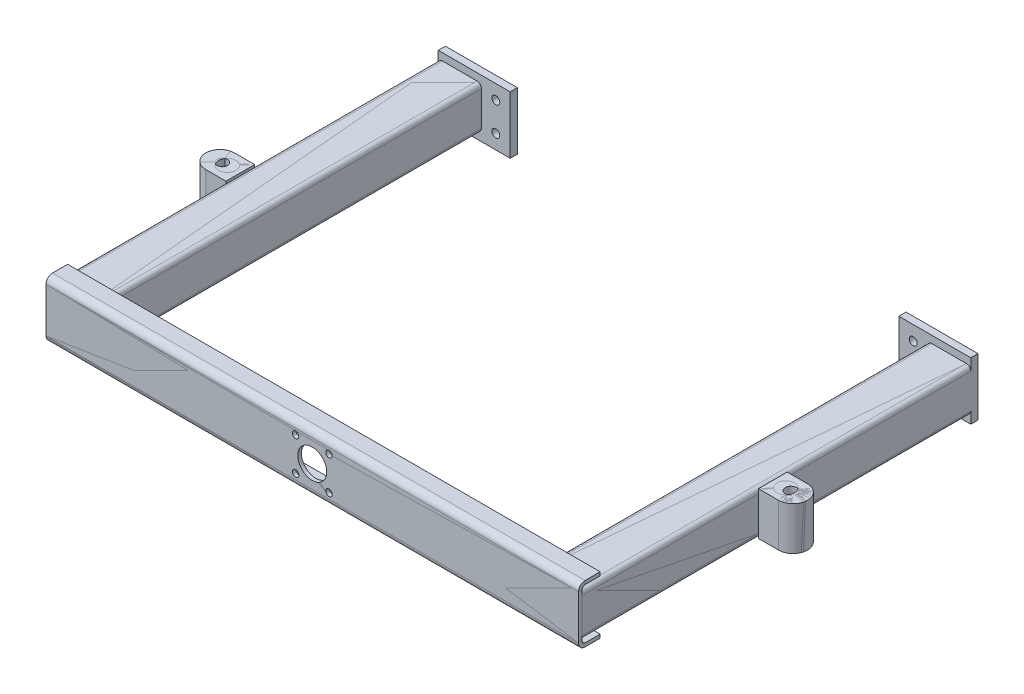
ISO-10303-21;
HEADER;
FILE_DESCRIPTION(('STEP AP214'),'2;1');
FILE_NAME('part.step','',(''),(''),'','','');
FILE_SCHEMA(('AUTOMOTIVE_DESIGN { 1 0 10303 214 1 1 1 1 }'));
ENDSEC;
DATA;
#1=APPLICATION_CONTEXT('core data for automotive mechanical design processes');
#2=APPLICATION_PROTOCOL_DEFINITION('international standard','automotive_design',2000,#1);
#3=PRODUCT_CONTEXT('',#1,'mechanical');
#4=PRODUCT('Part','Part','',(#3));
#5=PRODUCT_RELATED_PRODUCT_CATEGORY('part','',(#4));
#6=PRODUCT_DEFINITION_FORMATION('','',#4);
#7=PRODUCT_DEFINITION_CONTEXT('part definition',#1,'design');
#8=PRODUCT_DEFINITION('design','',#6,#7);
#9=PRODUCT_DEFINITION_SHAPE('','',#8);
#10=(LENGTH_UNIT() NAMED_UNIT(*) SI_UNIT(.MILLI.,.METRE.));
#11=(NAMED_UNIT(*) PLANE_ANGLE_UNIT() SI_UNIT($,.RADIAN.));
#12=(NAMED_UNIT(*) SI_UNIT($,.STERADIAN.) SOLID_ANGLE_UNIT());
#13=UNCERTAINTY_MEASURE_WITH_UNIT(LENGTH_MEASURE(1.E-05),#10,'distance_accuracy_value','');
#14=(GEOMETRIC_REPRESENTATION_CONTEXT(3) GLOBAL_UNCERTAINTY_ASSIGNED_CONTEXT((#13)) GLOBAL_UNIT_ASSIGNED_CONTEXT((#10,
#11,#12)) REPRESENTATION_CONTEXT('',''));
#15=CARTESIAN_POINT('',(0.,0.,0.));
#16=DIRECTION('',(0.,0.,1.));
#17=DIRECTION('',(1.,0.,0.));
#18=AXIS2_PLACEMENT_3D('',#15,#16,#17);
#19=CARTESIAN_POINT('',(620.46874898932,26.562499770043,0.));
#20=DIRECTION('',(-1.,0.,0.));
#21=DIRECTION('',(0.,0.,-1.));
#22=AXIS2_PLACEMENT_3D('',#19,#20,#21);
#23=PLANE('',#22);
#24=DIRECTION('',(0.,0.,-1.));
#25=VECTOR('',#24,1.);
#26=CARTESIAN_POINT('',(620.46874898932,-53.437500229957,-50.));
#27=LINE('',#26,#25);
#28=CARTESIAN_POINT('',(620.46874898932,-53.437500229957,0.));
#29=VERTEX_POINT('',#28);
#30=CARTESIAN_POINT('',(620.46874898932,-53.437500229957,-10.));
#31=VERTEX_POINT('',#30);
#32=EDGE_CURVE('P0_E693',#29,#31,#27,.T.);
#33=ORIENTED_EDGE('',*,*,#32,.F.);
#34=DIRECTION('',(0.,-1.,0.));
#35=VECTOR('',#34,1.);
#36=CARTESIAN_POINT('',(620.46874898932,-23.437500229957,0.));
#37=LINE('',#36,#35);
#38=CARTESIAN_POINT('',(620.46874898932,26.562499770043,0.));
#39=VERTEX_POINT('',#38);
#40=EDGE_CURVE('P0_E866',#39,#29,#37,.T.);
#41=ORIENTED_EDGE('',*,*,#40,.F.);
#42=DIRECTION('',(0.,0.,1.));
#43=VECTOR('',#42,1.);
#44=CARTESIAN_POINT('',(620.46874898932,26.562499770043,-50.));
#45=LINE('',#44,#43);
#46=CARTESIAN_POINT('',(620.46874898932,26.562499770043,-10.));
#47=VERTEX_POINT('',#46);
#48=EDGE_CURVE('P0_E668',#47,#39,#45,.T.);
#49=ORIENTED_EDGE('',*,*,#48,.F.);
#50=DIRECTION('',(0.,1.,0.));
#51=VECTOR('',#50,1.);
#52=CARTESIAN_POINT('',(620.46874898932,-23.437500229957,-10.));
#53=LINE('',#52,#51);
#54=EDGE_CURVE('P0_E684',#31,#47,#53,.T.);
#55=ORIENTED_EDGE('',*,*,#54,.F.);
#56=EDGE_LOOP('',(#33,#41,#49,#55));
#57=FACE_BOUND('',#56,.T.);
#58=ADVANCED_FACE('P0_F348',(#57),#23,.T.);
#59=CARTESIAN_POINT('',(640.46874898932,6.5624997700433,-10.));
#60=DIRECTION('',(0.,0.,1.));
#61=DIRECTION('',(0.,-1.,0.));
#62=AXIS2_PLACEMENT_3D('',#59,#60,#61);
#63=CYLINDRICAL_SURFACE('',#62,5.49999999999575);
#64=CARTESIAN_POINT('',(640.46874898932,6.5624997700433,-10.));
#65=DIRECTION('',(0.,0.,1.));
#66=DIRECTION('',(0.,-1.,0.));
#67=AXIS2_PLACEMENT_3D('',#64,#65,#66);
#68=CIRCLE('',#67,5.49999999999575);
#69=CARTESIAN_POINT('',(640.46874898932,1.06249977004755,-10.));
#70=VERTEX_POINT('',#69);
#71=EDGE_CURVE('P0_E682',#70,#70,#68,.T.);
#72=ORIENTED_EDGE('',*,*,#71,.F.);
#73=EDGE_LOOP('',(#72));
#74=FACE_BOUND('',#73,.T.);
#75=CARTESIAN_POINT('',(640.46874898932,6.5624997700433,0.));
#76=DIRECTION('',(0.,0.,1.));
#77=DIRECTION('',(0.,-1.,0.));
#78=AXIS2_PLACEMENT_3D('',#75,#76,#77);
#79=CIRCLE('',#78,5.49999999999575);
#80=CARTESIAN_POINT('',(640.46874898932,1.06249977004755,0.));
#81=VERTEX_POINT('',#80);
#82=EDGE_CURVE('P0_E864',#81,#81,#79,.F.);
#83=ORIENTED_EDGE('',*,*,#82,.F.);
#84=EDGE_LOOP('',(#83));
#85=FACE_BOUND('',#84,.T.);
#86=ADVANCED_FACE('P0_F1537',(#74,#85),#63,.F.);
#87=CARTESIAN_POINT('',(640.46874898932,-33.437500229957,0.));
#88=DIRECTION('',(0.,0.,-1.));
#89=DIRECTION('',(-1.,0.,0.));
#90=AXIS2_PLACEMENT_3D('',#87,#88,#89);
#91=CYLINDRICAL_SURFACE('',#90,5.49999999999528);
#92=CARTESIAN_POINT('',(640.46874898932,-33.437500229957,-10.));
#93=DIRECTION('',(0.,0.,-1.));
#94=DIRECTION('',(-1.,0.,0.));
#95=AXIS2_PLACEMENT_3D('',#92,#93,#94);
#96=CIRCLE('',#95,5.49999999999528);
#97=CARTESIAN_POINT('',(634.968748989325,-33.437500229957,-10.));
#98=VERTEX_POINT('',#97);
#99=EDGE_CURVE('P0_E679',#98,#98,#96,.F.);
#100=ORIENTED_EDGE('',*,*,#99,.F.);
#101=EDGE_LOOP('',(#100));
#102=FACE_BOUND('',#101,.T.);
#103=CARTESIAN_POINT('',(640.46874898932,-33.437500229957,0.));
#104=DIRECTION('',(0.,0.,-1.));
#105=DIRECTION('',(-1.,0.,0.));
#106=AXIS2_PLACEMENT_3D('',#103,#104,#105);
#107=CIRCLE('',#106,5.49999999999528);
#108=CARTESIAN_POINT('',(634.968748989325,-33.437500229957,0.));
#109=VERTEX_POINT('',#108);
#110=EDGE_CURVE('P0_E861',#109,#109,#107,.T.);
#111=ORIENTED_EDGE('',*,*,#110,.F.);
#112=EDGE_LOOP('',(#111));
#113=FACE_BOUND('',#112,.T.);
#114=ADVANCED_FACE('P0_F1540',(#102,#113),#91,.F.);
#115=CARTESIAN_POINT('',(720.46874898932,-43.437500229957,255.));
#116=DIRECTION('',(0.,0.,-1.));
#117=DIRECTION('',(0.,1.,0.));
#118=AXIS2_PLACEMENT_3D('',#115,#116,#117);
#119=PLANE('',#118);
#120=DIRECTION('',(-1.,0.,0.));
#121=VECTOR('',#120,1.);
#122=CARTESIAN_POINT('',(744.46874898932,16.562499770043,255.));
#123=LINE('',#122,#121);
#124=CARTESIAN_POINT('',(748.46874898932,16.562499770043,255.));
#125=VERTEX_POINT('',#124);
#126=CARTESIAN_POINT('',(720.46874898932,16.562499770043,255.));
#127=VERTEX_POINT('',#126);
#128=EDGE_CURVE('P0_E655',#125,#127,#123,.T.);
#129=ORIENTED_EDGE('',*,*,#128,.F.);
#130=DIRECTION('',(0.,-1.,0.));
#131=VECTOR('',#130,1.);
#132=CARTESIAN_POINT('',(748.46874898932,-13.437500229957,255.));
#133=LINE('',#132,#131);
#134=CARTESIAN_POINT('',(748.46874898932,-43.437500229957,255.));
#135=VERTEX_POINT('',#134);
#136=EDGE_CURVE('P0_E649',#125,#135,#133,.T.);
#137=ORIENTED_EDGE('',*,*,#136,.T.);
#138=DIRECTION('',(1.,0.,0.));
#139=VECTOR('',#138,1.);
#140=CARTESIAN_POINT('',(744.46874898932,-43.437500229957,255.));
#141=LINE('',#140,#139);
#142=CARTESIAN_POINT('',(720.46874898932,-43.437500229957,255.));
#143=VERTEX_POINT('',#142);
#144=EDGE_CURVE('P0_E652',#143,#135,#141,.T.);
#145=ORIENTED_EDGE('',*,*,#144,.F.);
#146=DIRECTION('',(0.,-1.,0.));
#147=VECTOR('',#146,1.);
#148=CARTESIAN_POINT('',(720.46874898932,-57.437500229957,255.));
#149=LINE('',#148,#147);
#150=CARTESIAN_POINT('',(720.468748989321,-37.4375002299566,255.));
#151=VERTEX_POINT('',#150);
#152=EDGE_CURVE('P0_E863',#151,#143,#149,.T.);
#153=ORIENTED_EDGE('',*,*,#152,.F.);
#154=DIRECTION('',(0.,-1.,0.));
#155=VECTOR('',#154,1.);
#156=CARTESIAN_POINT('',(720.46874898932,224.062499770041,255.000000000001));
#157=LINE('',#156,#155);
#158=CARTESIAN_POINT('',(720.46874898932,10.5624997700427,255.));
#159=VERTEX_POINT('',#158);
#160=EDGE_CURVE('P0_E1205',#159,#151,#157,.T.);
#161=ORIENTED_EDGE('',*,*,#160,.F.);
#162=DIRECTION('',(0.,-1.,0.));
#163=VECTOR('',#162,1.);
#164=CARTESIAN_POINT('',(720.46874898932,30.562499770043,255.));
#165=LINE('',#164,#163);
#166=EDGE_CURVE('P0_E1229',#127,#159,#165,.T.);
#167=ORIENTED_EDGE('',*,*,#166,.F.);
#168=EDGE_LOOP('',(#129,#137,#145,#153,#161,#167));
#169=FACE_BOUND('',#168,.T.);
#170=ADVANCED_FACE('P0_F651',(#169),#119,.T.);
#171=CARTESIAN_POINT('',(620.46874898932,-53.437500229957,0.));
#172=DIRECTION('',(0.,-1.,0.));
#173=DIRECTION('',(0.,0.,-1.));
#174=AXIS2_PLACEMENT_3D('',#171,#172,#173);
#175=PLANE('',#174);
#176=DIRECTION('',(-1.,0.,0.));
#177=VECTOR('',#176,1.);
#178=CARTESIAN_POINT('',(670.46874898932,-53.437500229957,-10.));
#179=LINE('',#178,#177);
#180=CARTESIAN_POINT('',(720.46874898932,-53.437500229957,-10.));
#181=VERTEX_POINT('',#180);
#182=EDGE_CURVE('P0_E687',#181,#31,#179,.T.);
#183=ORIENTED_EDGE('',*,*,#182,.F.);
#184=DIRECTION('',(0.,0.,-1.));
#185=VECTOR('',#184,1.);
#186=CARTESIAN_POINT('',(720.46874898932,-53.437500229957,267.5));
#187=LINE('',#186,#185);
#188=CARTESIAN_POINT('',(720.46874898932,-53.437500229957,7.85829734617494E-13));
#189=VERTEX_POINT('',#188);
#190=EDGE_CURVE('P0_E1219',#189,#181,#187,.T.);
#191=ORIENTED_EDGE('',*,*,#190,.F.);
#192=DIRECTION('',(1.,0.,0.));
#193=VECTOR('',#192,1.);
#194=CARTESIAN_POINT('',(670.46874898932,-53.437500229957,0.));
#195=LINE('',#194,#193);
#196=EDGE_CURVE('P0_E875',#29,#189,#195,.T.);
#197=ORIENTED_EDGE('',*,*,#196,.F.);
#198=ORIENTED_EDGE('',*,*,#32,.T.);
#199=EDGE_LOOP('',(#183,#191,#197,#198));
#200=FACE_BOUND('',#199,.T.);
#201=ADVANCED_FACE('P0_F1289',(#200),#175,.T.);
#202=CARTESIAN_POINT('',(620.46874898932,26.562499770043,-10.));
#203=DIRECTION('',(0.,0.,-1.));
#204=DIRECTION('',(1.,0.,0.));
#205=AXIS2_PLACEMENT_3D('',#202,#203,#204);
#206=PLANE('',#205);
#207=ORIENTED_EDGE('',*,*,#99,.T.);
#208=EDGE_LOOP('',(#207));
#209=FACE_BOUND('',#208,.T.);
#210=ORIENTED_EDGE('',*,*,#71,.T.);
#211=EDGE_LOOP('',(#210));
#212=FACE_BOUND('',#211,.T.);
#213=ORIENTED_EDGE('',*,*,#54,.T.);
#214=DIRECTION('',(-1.,0.,0.));
#215=VECTOR('',#214,1.);
#216=CARTESIAN_POINT('',(670.46874898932,26.562499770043,-10.));
#217=LINE('',#216,#215);
#218=CARTESIAN_POINT('',(720.46874898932,26.5624997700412,-10.));
#219=VERTEX_POINT('',#218);
#220=EDGE_CURVE('P0_E681',#219,#47,#217,.T.);
#221=ORIENTED_EDGE('',*,*,#220,.F.);
#222=DIRECTION('',(0.,1.,0.));
#223=VECTOR('',#222,1.);
#224=CARTESIAN_POINT('',(720.46874898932,224.062499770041,-10.));
#225=LINE('',#224,#223);
#226=EDGE_CURVE('P0_E1257',#181,#219,#225,.T.);
#227=ORIENTED_EDGE('',*,*,#226,.F.);
#228=ORIENTED_EDGE('',*,*,#182,.T.);
#229=EDGE_LOOP('',(#213,#221,#227,#228));
#230=FACE_BOUND('',#229,.T.);
#231=ADVANCED_FACE('P0_F1288',(#209,#212,#230),#206,.T.);
#232=CARTESIAN_POINT('',(720.46874898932,26.562499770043,0.));
#233=DIRECTION('',(0.,1.,0.));
#234=DIRECTION('',(0.,0.,-1.));
#235=AXIS2_PLACEMENT_3D('',#232,#233,#234);
#236=PLANE('',#235);
#237=ORIENTED_EDGE('',*,*,#48,.T.);
#238=DIRECTION('',(-1.,0.,0.));
#239=VECTOR('',#238,1.);
#240=CARTESIAN_POINT('',(670.46874898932,26.562499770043,0.));
#241=LINE('',#240,#239);
#242=CARTESIAN_POINT('',(720.46874898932,26.5624997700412,7.85829734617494E-13));
#243=VERTEX_POINT('',#242);
#244=EDGE_CURVE('P0_E870',#243,#39,#241,.T.);
#245=ORIENTED_EDGE('',*,*,#244,.F.);
#246=DIRECTION('',(0.,0.,1.));
#247=VECTOR('',#246,1.);
#248=CARTESIAN_POINT('',(720.46874898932,26.5624997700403,267.5));
#249=LINE('',#248,#247);
#250=EDGE_CURVE('P0_E1235',#219,#243,#249,.T.);
#251=ORIENTED_EDGE('',*,*,#250,.F.);
#252=ORIENTED_EDGE('',*,*,#220,.T.);
#253=EDGE_LOOP('',(#237,#245,#251,#252));
#254=FACE_BOUND('',#253,.T.);
#255=ADVANCED_FACE('P0_F1277',(#254),#236,.T.);
#256=CARTESIAN_POINT('',(768.46874898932,-43.437500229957,255.));
#257=DIRECTION('',(0.,-1.,0.));
#258=DIRECTION('',(0.,0.,1.));
#259=AXIS2_PLACEMENT_3D('',#256,#257,#258);
#260=PLANE('',#259);
#261=CARTESIAN_POINT('',(745.46874898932,-43.437500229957,275.));
#262=DIRECTION('',(0.,-1.,0.));
#263=DIRECTION('',(0.,0.,-1.));
#264=AXIS2_PLACEMENT_3D('',#261,#262,#263);
#265=CIRCLE('',#264,7.77395514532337);
#266=CARTESIAN_POINT('',(745.46874898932,-43.437500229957,267.226044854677));
#267=VERTEX_POINT('',#266);
#268=EDGE_CURVE('P0_E891',#267,#267,#265,.T.);
#269=ORIENTED_EDGE('',*,*,#268,.F.);
#270=EDGE_LOOP('',(#269));
#271=FACE_BOUND('',#270,.T.);
#272=CARTESIAN_POINT('',(748.46874898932,-43.437500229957,275.));
#273=DIRECTION('',(0.,1.,0.));
#274=DIRECTION('',(0.,0.,1.));
#275=AXIS2_PLACEMENT_3D('',#272,#273,#274);
#276=CIRCLE('',#275,20.);
#277=CARTESIAN_POINT('',(748.46874898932,-43.437500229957,295.));
#278=VERTEX_POINT('',#277);
#279=EDGE_CURVE('P0_E659',#135,#278,#276,.F.);
#280=ORIENTED_EDGE('',*,*,#279,.T.);
#281=DIRECTION('',(1.,0.,0.));
#282=VECTOR('',#281,1.);
#283=CARTESIAN_POINT('',(718.46874898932,-43.437500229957,295.));
#284=LINE('',#283,#282);
#285=CARTESIAN_POINT('',(720.46874898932,-43.437500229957,295.));
#286=VERTEX_POINT('',#285);
#287=EDGE_CURVE('P0_E1190',#286,#278,#284,.T.);
#288=ORIENTED_EDGE('',*,*,#287,.F.);
#289=DIRECTION('',(0.,0.,1.));
#290=VECTOR('',#289,1.);
#291=CARTESIAN_POINT('',(720.46874898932,-43.437500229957,275.));
#292=LINE('',#291,#290);
#293=EDGE_CURVE('P0_E666',#143,#286,#292,.T.);
#294=ORIENTED_EDGE('',*,*,#293,.F.);
#295=ORIENTED_EDGE('',*,*,#144,.T.);
#296=EDGE_LOOP('',(#280,#288,#294,#295));
#297=FACE_BOUND('',#296,.T.);
#298=ADVANCED_FACE('P0_F663',(#271,#297),#260,.T.);
#299=CARTESIAN_POINT('',(748.46874898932,-43.437500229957,275.));
#300=DIRECTION('',(0.,1.,0.));
#301=DIRECTION('',(0.,0.,1.));
#302=AXIS2_PLACEMENT_3D('',#299,#300,#301);
#303=CYLINDRICAL_SURFACE('',#302,20.);
#304=ORIENTED_EDGE('',*,*,#136,.F.);
#305=CARTESIAN_POINT('',(748.46874898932,16.562499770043,275.));
#306=DIRECTION('',(0.,1.,0.));
#307=DIRECTION('',(0.,0.,1.));
#308=AXIS2_PLACEMENT_3D('',#305,#306,#307);
#309=CIRCLE('',#308,20.);
#310=CARTESIAN_POINT('',(748.46874898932,16.562499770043,295.));
#311=VERTEX_POINT('',#310);
#312=EDGE_CURVE('P0_E674',#311,#125,#309,.T.);
#313=ORIENTED_EDGE('',*,*,#312,.F.);
#314=DIRECTION('',(0.,1.,0.));
#315=VECTOR('',#314,1.);
#316=CARTESIAN_POINT('',(748.46874898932,-13.437500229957,295.));
#317=LINE('',#316,#315);
#318=EDGE_CURVE('P0_E672',#278,#311,#317,.T.);
#319=ORIENTED_EDGE('',*,*,#318,.F.);
#320=ORIENTED_EDGE('',*,*,#279,.F.);
#321=EDGE_LOOP('',(#304,#313,#319,#320));
#322=FACE_BOUND('',#321,.T.);
#323=ADVANCED_FACE('P0_F670',(#322),#303,.T.);
#324=CARTESIAN_POINT('',(720.46874898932,16.562499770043,255.));
#325=DIRECTION('',(0.,1.,0.));
#326=DIRECTION('',(0.,0.,1.));
#327=AXIS2_PLACEMENT_3D('',#324,#325,#326);
#328=PLANE('',#327);
#329=CARTESIAN_POINT('',(745.46874898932,16.562499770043,275.));
#330=DIRECTION('',(0.,1.,0.));
#331=DIRECTION('',(0.,0.,1.));
#332=AXIS2_PLACEMENT_3D('',#329,#330,#331);
#333=CIRCLE('',#332,7.77395514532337);
#334=CARTESIAN_POINT('',(745.46874898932,16.562499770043,282.773955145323));
#335=VERTEX_POINT('',#334);
#336=EDGE_CURVE('P0_E896',#335,#335,#333,.T.);
#337=ORIENTED_EDGE('',*,*,#336,.F.);
#338=EDGE_LOOP('',(#337));
#339=FACE_BOUND('',#338,.T.);
#340=ORIENTED_EDGE('',*,*,#128,.T.);
#341=DIRECTION('',(0.,0.,-1.));
#342=VECTOR('',#341,1.);
#343=CARTESIAN_POINT('',(720.46874898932,16.562499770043,275.));
#344=LINE('',#343,#342);
#345=CARTESIAN_POINT('',(720.46874898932,16.562499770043,295.));
#346=VERTEX_POINT('',#345);
#347=EDGE_CURVE('P0_E903',#346,#127,#344,.T.);
#348=ORIENTED_EDGE('',*,*,#347,.F.);
#349=DIRECTION('',(-1.,0.,0.));
#350=VECTOR('',#349,1.);
#351=CARTESIAN_POINT('',(718.46874898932,16.562499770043,295.));
#352=LINE('',#351,#350);
#353=EDGE_CURVE('P0_E1184',#311,#346,#352,.T.);
#354=ORIENTED_EDGE('',*,*,#353,.F.);
#355=ORIENTED_EDGE('',*,*,#312,.T.);
#356=EDGE_LOOP('',(#340,#348,#354,#355));
#357=FACE_BOUND('',#356,.T.);
#358=ADVANCED_FACE('P0_F1551',(#339,#357),#328,.T.);
#359=CARTESIAN_POINT('',(720.46874898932,10.562499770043,295.));
#360=DIRECTION('',(-1.,0.,0.));
#361=DIRECTION('',(0.,1.,0.));
#362=AXIS2_PLACEMENT_3D('',#359,#360,#361);
#363=PLANE('',#362);
#364=ORIENTED_EDGE('',*,*,#347,.T.);
#365=ORIENTED_EDGE('',*,*,#166,.T.);
#366=DIRECTION('',(0.,0.,1.));
#367=VECTOR('',#366,1.);
#368=CARTESIAN_POINT('',(720.46874898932,10.5624997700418,270.));
#369=LINE('',#368,#367);
#370=CARTESIAN_POINT('',(720.46874898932,10.5624997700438,295.));
#371=VERTEX_POINT('',#370);
#372=EDGE_CURVE('P0_E860',#159,#371,#369,.T.);
#373=ORIENTED_EDGE('',*,*,#372,.T.);
#374=DIRECTION('',(0.,-1.,0.));
#375=VECTOR('',#374,1.);
#376=CARTESIAN_POINT('',(720.46874898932,-13.437500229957,295.));
#377=LINE('',#376,#375);
#378=EDGE_CURVE('P0_E1169',#346,#371,#377,.T.);
#379=ORIENTED_EDGE('',*,*,#378,.F.);
#380=EDGE_LOOP('',(#364,#365,#373,#379));
#381=FACE_BOUND('',#380,.T.);
#382=ADVANCED_FACE('P0_F1325',(#381),#363,.T.);
#383=CARTESIAN_POINT('',(720.46874898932,26.562499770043,0.));
#384=DIRECTION('',(0.,0.,1.));
#385=DIRECTION('',(-1.,0.,0.));
#386=AXIS2_PLACEMENT_3D('',#383,#384,#385);
#387=PLANE('',#386);
#388=ORIENTED_EDGE('',*,*,#110,.T.);
#389=EDGE_LOOP('',(#388));
#390=FACE_BOUND('',#389,.T.);
#391=ORIENTED_EDGE('',*,*,#82,.T.);
#392=EDGE_LOOP('',(#391));
#393=FACE_BOUND('',#392,.T.);
#394=ORIENTED_EDGE('',*,*,#244,.T.);
#395=ORIENTED_EDGE('',*,*,#40,.T.);
#396=ORIENTED_EDGE('',*,*,#196,.T.);
#397=DIRECTION('',(0.,-1.,0.));
#398=VECTOR('',#397,1.);
#399=CARTESIAN_POINT('',(720.46874898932,224.062499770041,1.19175502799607E-12));
#400=LINE('',#399,#398);
#401=CARTESIAN_POINT('',(720.46874898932,-37.4375002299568,5.33861149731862E-13));
#402=VERTEX_POINT('',#401);
#403=EDGE_CURVE('P0_E1208',#402,#189,#400,.T.);
#404=ORIENTED_EDGE('',*,*,#403,.F.);
#405=CARTESIAN_POINT('',(714.46874898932,-37.437500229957,-1.11022302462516E-13));
#406=DIRECTION('',(0.,0.,-1.));
#407=DIRECTION('',(-1.,0.,0.));
#408=AXIS2_PLACEMENT_3D('',#405,#406,#407);
#409=CIRCLE('',#408,6.00000000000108);
#410=CARTESIAN_POINT('',(714.46874898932,-43.4375002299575,-1.11022302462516E-13));
#411=VERTEX_POINT('',#410);
#412=EDGE_CURVE('P0_E843',#402,#411,#409,.T.);
#413=ORIENTED_EDGE('',*,*,#412,.T.);
#414=DIRECTION('',(1.,0.,0.));
#415=VECTOR('',#414,1.);
#416=CARTESIAN_POINT('',(936.46874898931,-43.437500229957,0.));
#417=LINE('',#416,#415);
#418=CARTESIAN_POINT('',(666.46874898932,-43.437500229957,0.));
#419=VERTEX_POINT('',#418);
#420=EDGE_CURVE('P0_E846',#419,#411,#417,.T.);
#421=ORIENTED_EDGE('',*,*,#420,.F.);
#422=CARTESIAN_POINT('',(666.46874898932,-37.437500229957,-1.11022302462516E-13));
#423=DIRECTION('',(0.,0.,-1.));
#424=DIRECTION('',(-1.,0.,0.));
#425=AXIS2_PLACEMENT_3D('',#422,#423,#424);
#426=CIRCLE('',#425,6.00000000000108);
#427=CARTESIAN_POINT('',(660.468748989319,-37.4375002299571,-1.11022302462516E-13));
#428=VERTEX_POINT('',#427);
#429=EDGE_CURVE('P0_E847',#419,#428,#426,.T.);
#430=ORIENTED_EDGE('',*,*,#429,.T.);
#431=DIRECTION('',(0.,-1.,0.));
#432=VECTOR('',#431,1.);
#433=CARTESIAN_POINT('',(660.46874898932,-259.437500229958,0.));
#434=LINE('',#433,#432);
#435=CARTESIAN_POINT('',(660.46874898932,10.562499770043,0.));
#436=VERTEX_POINT('',#435);
#437=EDGE_CURVE('P0_E850',#436,#428,#434,.T.);
#438=ORIENTED_EDGE('',*,*,#437,.F.);
#439=CARTESIAN_POINT('',(666.46874898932,10.562499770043,-1.1368683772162E-13));
#440=DIRECTION('',(0.,0.,1.));
#441=DIRECTION('',(1.,0.,0.));
#442=AXIS2_PLACEMENT_3D('',#439,#440,#441);
#443=CIRCLE('',#442,6.00000000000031);
#444=CARTESIAN_POINT('',(666.46874898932,16.5624997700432,-1.1368683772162E-13));
#445=VERTEX_POINT('',#444);
#446=EDGE_CURVE('P0_E851',#436,#445,#443,.F.);
#447=ORIENTED_EDGE('',*,*,#446,.T.);
#448=DIRECTION('',(-1.,0.,0.));
#449=VECTOR('',#448,1.);
#450=CARTESIAN_POINT('',(444.46874898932,16.562499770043,0.));
#451=LINE('',#450,#449);
#452=CARTESIAN_POINT('',(714.46874898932,16.562499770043,0.));
#453=VERTEX_POINT('',#452);
#454=EDGE_CURVE('P0_E1124',#453,#445,#451,.T.);
#455=ORIENTED_EDGE('',*,*,#454,.F.);
#456=CARTESIAN_POINT('',(714.46874898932,10.562499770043,-1.1368683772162E-13));
#457=DIRECTION('',(0.,0.,1.));
#458=DIRECTION('',(1.,0.,0.));
#459=AXIS2_PLACEMENT_3D('',#456,#457,#458);
#460=CIRCLE('',#459,6.00000000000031);
#461=CARTESIAN_POINT('',(720.46874898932,10.5624997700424,5.3252888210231E-13));
#462=VERTEX_POINT('',#461);
#463=EDGE_CURVE('P0_E856',#453,#462,#460,.F.);
#464=ORIENTED_EDGE('',*,*,#463,.T.);
#465=DIRECTION('',(0.,-1.,0.));
#466=VECTOR('',#465,1.);
#467=CARTESIAN_POINT('',(720.46874898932,224.062499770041,1.19175502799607E-12));
#468=LINE('',#467,#466);
#469=EDGE_CURVE('P0_E1191',#243,#462,#468,.T.);
#470=ORIENTED_EDGE('',*,*,#469,.F.);
#471=EDGE_LOOP('',(#394,#395,#396,#404,#413,#421,#430,#438,#447,#455,#464,#470));
#472=FACE_BOUND('',#471,.T.);
#473=ADVANCED_FACE('P0_F1281',(#390,#393,#472),#387,.T.);
#474=CARTESIAN_POINT('',(720.46874898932,-37.437500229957,255.));
#475=DIRECTION('',(-1.,0.,0.));
#476=DIRECTION('',(0.,-1.,0.));
#477=AXIS2_PLACEMENT_3D('',#474,#475,#476);
#478=PLANE('',#477);
#479=DIRECTION('',(0.,-1.,0.));
#480=VECTOR('',#479,1.);
#481=CARTESIAN_POINT('',(720.46874898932,-13.437500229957,295.));
#482=LINE('',#481,#480);
#483=CARTESIAN_POINT('',(720.46874898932,-37.4375002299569,295.000000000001));
#484=VERTEX_POINT('',#483);
#485=EDGE_CURVE('P0_E1187',#484,#286,#482,.T.);
#486=ORIENTED_EDGE('',*,*,#485,.F.);
#487=DIRECTION('',(0.,0.,-1.));
#488=VECTOR('',#487,1.);
#489=CARTESIAN_POINT('',(720.468748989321,-37.4375002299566,270.));
#490=LINE('',#489,#488);
#491=EDGE_CURVE('P0_E1116',#484,#151,#490,.T.);
#492=ORIENTED_EDGE('',*,*,#491,.T.);
#493=ORIENTED_EDGE('',*,*,#152,.T.);
#494=ORIENTED_EDGE('',*,*,#293,.T.);
#495=EDGE_LOOP('',(#486,#492,#493,#494));
#496=FACE_BOUND('',#495,.T.);
#497=ADVANCED_FACE('P0_F1328',(#496),#478,.T.);
#498=CARTESIAN_POINT('',(720.46874898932,-53.437500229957,545.));
#499=DIRECTION('',(1.,0.,0.));
#500=DIRECTION('',(0.,0.,-1.));
#501=AXIS2_PLACEMENT_3D('',#498,#499,#500);
#502=PLANE('',#501);
#503=ORIENTED_EDGE('',*,*,#250,.T.);
#504=ORIENTED_EDGE('',*,*,#469,.T.);
#505=DIRECTION('',(0.,0.,1.));
#506=VECTOR('',#505,1.);
#507=CARTESIAN_POINT('',(720.46874898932,10.5624997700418,270.));
#508=LINE('',#507,#506);
#509=EDGE_CURVE('P0_E1155',#462,#159,#508,.T.);
#510=ORIENTED_EDGE('',*,*,#509,.T.);
#511=ORIENTED_EDGE('',*,*,#160,.T.);
#512=DIRECTION('',(0.,0.,-1.));
#513=VECTOR('',#512,1.);
#514=CARTESIAN_POINT('',(720.468748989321,-37.4375002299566,270.));
#515=LINE('',#514,#513);
#516=EDGE_CURVE('P0_E927',#151,#402,#515,.T.);
#517=ORIENTED_EDGE('',*,*,#516,.T.);
#518=ORIENTED_EDGE('',*,*,#403,.T.);
#519=ORIENTED_EDGE('',*,*,#190,.T.);
#520=ORIENTED_EDGE('',*,*,#226,.T.);
#521=EDGE_LOOP('',(#503,#504,#510,#511,#517,#518,#519,#520));
#522=FACE_BOUND('',#521,.T.);
#523=ADVANCED_FACE('P0_F1285',(#522),#502,.T.);
#524=CARTESIAN_POINT('',(748.46874898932,-43.437500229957,295.));
#525=DIRECTION('',(0.,0.,1.));
#526=DIRECTION('',(0.,1.,0.));
#527=AXIS2_PLACEMENT_3D('',#524,#525,#526);
#528=PLANE('',#527);
#529=ORIENTED_EDGE('',*,*,#378,.T.);
#530=DIRECTION('',(0.,1.,0.));
#531=VECTOR('',#530,1.);
#532=CARTESIAN_POINT('',(720.46874898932,224.062499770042,295.));
#533=LINE('',#532,#531);
#534=EDGE_CURVE('P0_E1112',#484,#371,#533,.T.);
#535=ORIENTED_EDGE('',*,*,#534,.F.);
#536=ORIENTED_EDGE('',*,*,#485,.T.);
#537=ORIENTED_EDGE('',*,*,#287,.T.);
#538=ORIENTED_EDGE('',*,*,#318,.T.);
#539=ORIENTED_EDGE('',*,*,#353,.T.);
#540=EDGE_LOOP('',(#529,#535,#536,#537,#538,#539));
#541=FACE_BOUND('',#540,.T.);
#542=ADVANCED_FACE('P0_F1331',(#541),#528,.T.);
#543=CARTESIAN_POINT('',(720.46874898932,17.562499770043,536.));
#544=DIRECTION('',(-1.,0.,0.));
#545=DIRECTION('',(0.,0.,1.));
#546=AXIS2_PLACEMENT_3D('',#543,#544,#545);
#547=CYLINDRICAL_SURFACE('',#546,9.00000000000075);
#548=DIRECTION('',(-1.,0.,0.));
#549=VECTOR('',#548,1.);
#550=CARTESIAN_POINT('',(350.468748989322,17.5624997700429,545.));
#551=LINE('',#550,#549);
#552=CARTESIAN_POINT('',(720.46874898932,17.562499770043,545.));
#553=VERTEX_POINT('',#552);
#554=CARTESIAN_POINT('',(-19.531251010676,17.562499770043,545.));
#555=VERTEX_POINT('',#554);
#556=EDGE_CURVE('P0_E1134',#553,#555,#551,.T.);
#557=ORIENTED_EDGE('',*,*,#556,.F.);
#558=CARTESIAN_POINT('',(720.46874898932,17.562499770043,536.));
#559=DIRECTION('',(-1.,0.,0.));
#560=DIRECTION('',(0.,0.,1.));
#561=AXIS2_PLACEMENT_3D('',#558,#559,#560);
#562=CIRCLE('',#561,9.00000000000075);
#563=CARTESIAN_POINT('',(720.46874898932,26.5624997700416,536.));
#564=VERTEX_POINT('',#563);
#565=EDGE_CURVE('P0_E829',#564,#553,#562,.F.);
#566=ORIENTED_EDGE('',*,*,#565,.F.);
#567=DIRECTION('',(1.,0.,0.));
#568=VECTOR('',#567,1.);
#569=CARTESIAN_POINT('',(350.468748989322,26.562499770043,536.));
#570=LINE('',#569,#568);
#571=CARTESIAN_POINT('',(-19.531251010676,26.562499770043,536.));
#572=VERTEX_POINT('',#571);
#573=EDGE_CURVE('P0_E1165',#572,#564,#570,.T.);
#574=ORIENTED_EDGE('',*,*,#573,.F.);
#575=CARTESIAN_POINT('',(-19.531251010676,17.562499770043,536.));
#576=DIRECTION('',(-1.,0.,0.));
#577=DIRECTION('',(0.,0.,1.));
#578=AXIS2_PLACEMENT_3D('',#575,#576,#577);
#579=CIRCLE('',#578,9.00000000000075);
#580=EDGE_CURVE('P0_E795',#555,#572,#579,.T.);
#581=ORIENTED_EDGE('',*,*,#580,.F.);
#582=EDGE_LOOP('',(#557,#566,#574,#581));
#583=FACE_BOUND('',#582,.T.);
#584=ADVANCED_FACE('P0_F1396',(#583),#547,.T.);
#585=CARTESIAN_POINT('',(-19.531251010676,26.562499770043,536.));
#586=DIRECTION('',(0.,1.,0.));
#587=DIRECTION('',(1.,0.,0.));
#588=AXIS2_PLACEMENT_3D('',#585,#586,#587);
#589=PLANE('',#588);
#590=DIRECTION('',(0.,0.,1.));
#591=VECTOR('',#590,1.);
#592=CARTESIAN_POINT('',(720.46874898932,26.5624997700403,267.5));
#593=LINE('',#592,#591);
#594=CARTESIAN_POINT('',(720.46874898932,26.5624997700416,515.));
#595=VERTEX_POINT('',#594);
#596=EDGE_CURVE('P0_E832',#595,#564,#593,.T.);
#597=ORIENTED_EDGE('',*,*,#596,.F.);
#598=DIRECTION('',(1.,0.,0.));
#599=VECTOR('',#598,1.);
#600=CARTESIAN_POINT('',(350.468748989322,26.562499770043,515.));
#601=LINE('',#600,#599);
#602=CARTESIAN_POINT('',(-19.531251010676,26.562499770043,515.));
#603=VERTEX_POINT('',#602);
#604=EDGE_CURVE('P0_E1157',#603,#595,#601,.T.);
#605=ORIENTED_EDGE('',*,*,#604,.F.);
#606=DIRECTION('',(0.,0.,-1.));
#607=VECTOR('',#606,1.);
#608=CARTESIAN_POINT('',(-19.531251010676,26.562499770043,267.5));
#609=LINE('',#608,#607);
#610=EDGE_CURVE('P0_E798',#572,#603,#609,.T.);
#611=ORIENTED_EDGE('',*,*,#610,.F.);
#612=ORIENTED_EDGE('',*,*,#573,.T.);
#613=EDGE_LOOP('',(#597,#605,#611,#612));
#614=FACE_BOUND('',#613,.T.);
#615=ADVANCED_FACE('P0_F1392',(#614),#589,.T.);
#616=CARTESIAN_POINT('',(-19.531251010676,26.562499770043,515.));
#617=DIRECTION('',(0.,0.,-1.));
#618=DIRECTION('',(1.,0.,0.));
#619=AXIS2_PLACEMENT_3D('',#616,#617,#618);
#620=PLANE('',#619);
#621=DIRECTION('',(0.,1.,0.));
#622=VECTOR('',#621,1.);
#623=CARTESIAN_POINT('',(720.46874898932,224.062499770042,515.));
#624=LINE('',#623,#622);
#625=CARTESIAN_POINT('',(720.46874898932,21.5624997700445,515.));
#626=VERTEX_POINT('',#625);
#627=EDGE_CURVE('P0_E908',#626,#595,#624,.T.);
#628=ORIENTED_EDGE('',*,*,#627,.F.);
#629=DIRECTION('',(1.,0.,0.));
#630=VECTOR('',#629,1.);
#631=CARTESIAN_POINT('',(350.468748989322,21.562499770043,515.));
#632=LINE('',#631,#630);
#633=CARTESIAN_POINT('',(-19.531251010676,21.562499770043,515.));
#634=VERTEX_POINT('',#633);
#635=EDGE_CURVE('P0_E1150',#634,#626,#632,.T.);
#636=ORIENTED_EDGE('',*,*,#635,.F.);
#637=DIRECTION('',(0.,-1.,0.));
#638=VECTOR('',#637,1.);
#639=CARTESIAN_POINT('',(-19.531251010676,-250.937500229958,515.));
#640=LINE('',#639,#638);
#641=EDGE_CURVE('P0_E949',#603,#634,#640,.T.);
#642=ORIENTED_EDGE('',*,*,#641,.F.);
#643=ORIENTED_EDGE('',*,*,#604,.T.);
#644=EDGE_LOOP('',(#628,#636,#642,#643));
#645=FACE_BOUND('',#644,.T.);
#646=ADVANCED_FACE('P0_F1388',(#645),#620,.T.);
#647=CARTESIAN_POINT('',(-19.531251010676,21.562499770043,515.));
#648=DIRECTION('',(0.,-1.,0.));
#649=DIRECTION('',(1.,0.,0.));
#650=AXIS2_PLACEMENT_3D('',#647,#648,#649);
#651=PLANE('',#650);
#652=DIRECTION('',(0.,0.,-1.));
#653=VECTOR('',#652,1.);
#654=CARTESIAN_POINT('',(720.46874898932,21.5624997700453,267.5));
#655=LINE('',#654,#653);
#656=CARTESIAN_POINT('',(720.46874898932,21.5624997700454,536.000000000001));
#657=VERTEX_POINT('',#656);
#658=EDGE_CURVE('P0_E836',#657,#626,#655,.T.);
#659=ORIENTED_EDGE('',*,*,#658,.F.);
#660=DIRECTION('',(1.,0.,0.));
#661=VECTOR('',#660,1.);
#662=CARTESIAN_POINT('',(350.468748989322,21.5624997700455,536.000000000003));
#663=LINE('',#662,#661);
#664=CARTESIAN_POINT('',(-19.531251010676,21.5624997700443,536.000000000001));
#665=VERTEX_POINT('',#664);
#666=EDGE_CURVE('P0_E1138',#665,#657,#663,.T.);
#667=ORIENTED_EDGE('',*,*,#666,.F.);
#668=DIRECTION('',(0.,0.,1.));
#669=VECTOR('',#668,1.);
#670=CARTESIAN_POINT('',(-19.531251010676,21.562499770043,267.5));
#671=LINE('',#670,#669);
#672=EDGE_CURVE('P0_E794',#634,#665,#671,.T.);
#673=ORIENTED_EDGE('',*,*,#672,.F.);
#674=ORIENTED_EDGE('',*,*,#635,.T.);
#675=EDGE_LOOP('',(#659,#667,#673,#674));
#676=FACE_BOUND('',#675,.T.);
#677=ADVANCED_FACE('P0_F1385',(#676),#651,.T.);
#678=CARTESIAN_POINT('',(-19.531251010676,-43.437500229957,295.));
#679=DIRECTION('',(0.,0.,1.));
#680=DIRECTION('',(0.,1.,0.));
#681=AXIS2_PLACEMENT_3D('',#678,#679,#680);
#682=PLANE('',#681);
#683=DIRECTION('',(-1.,0.,0.));
#684=VECTOR('',#683,1.);
#685=CARTESIAN_POINT('',(-43.531251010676,-43.437500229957,295.));
#686=LINE('',#685,#684);
#687=CARTESIAN_POINT('',(-19.531251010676,-43.437500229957,295.));
#688=VERTEX_POINT('',#687);
#689=CARTESIAN_POINT('',(-47.531251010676,-43.437500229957,295.));
#690=VERTEX_POINT('',#689);
#691=EDGE_CURVE('P0_E804',#688,#690,#686,.T.);
#692=ORIENTED_EDGE('',*,*,#691,.F.);
#693=DIRECTION('',(0.,-1.,0.));
#694=VECTOR('',#693,1.);
#695=CARTESIAN_POINT('',(-19.531251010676,-57.437500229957,295.));
#696=LINE('',#695,#694);
#697=CARTESIAN_POINT('',(-19.5312510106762,-37.4375002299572,295.000000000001));
#698=VERTEX_POINT('',#697);
#699=EDGE_CURVE('P0_E1073',#698,#688,#696,.T.);
#700=ORIENTED_EDGE('',*,*,#699,.F.);
#701=DIRECTION('',(0.,-1.,0.));
#702=VECTOR('',#701,1.);
#703=CARTESIAN_POINT('',(-19.531251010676,-250.937500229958,295.));
#704=LINE('',#703,#702);
#705=CARTESIAN_POINT('',(-19.5312510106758,10.5624997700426,295.000000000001));
#706=VERTEX_POINT('',#705);
#707=EDGE_CURVE('P0_E791',#706,#698,#704,.T.);
#708=ORIENTED_EDGE('',*,*,#707,.F.);
#709=DIRECTION('',(0.,-1.,0.));
#710=VECTOR('',#709,1.);
#711=CARTESIAN_POINT('',(-19.531251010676,30.562499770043,295.));
#712=LINE('',#711,#710);
#713=CARTESIAN_POINT('',(-19.531251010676,16.562499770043,295.));
#714=VERTEX_POINT('',#713);
#715=EDGE_CURVE('P0_E1076',#714,#706,#712,.T.);
#716=ORIENTED_EDGE('',*,*,#715,.F.);
#717=DIRECTION('',(1.,0.,0.));
#718=VECTOR('',#717,1.);
#719=CARTESIAN_POINT('',(-43.531251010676,16.562499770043,295.));
#720=LINE('',#719,#718);
#721=CARTESIAN_POINT('',(-47.531251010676,16.562499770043,295.));
#722=VERTEX_POINT('',#721);
#723=EDGE_CURVE('P0_E808',#722,#714,#720,.T.);
#724=ORIENTED_EDGE('',*,*,#723,.F.);
#725=DIRECTION('',(0.,-1.,0.));
#726=VECTOR('',#725,1.);
#727=CARTESIAN_POINT('',(-47.531251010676,-13.437500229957,295.));
#728=LINE('',#727,#726);
#729=EDGE_CURVE('P0_E809',#722,#690,#728,.T.);
#730=ORIENTED_EDGE('',*,*,#729,.T.);
#731=EDGE_LOOP('',(#692,#700,#708,#716,#724,#730));
#732=FACE_BOUND('',#731,.T.);
#733=ADVANCED_FACE('P0_F1416',(#732),#682,.T.);
#734=CARTESIAN_POINT('',(-19.531251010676,-48.437500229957,536.));
#735=DIRECTION('',(0.,1.,0.));
#736=DIRECTION('',(1.,0.,0.));
#737=AXIS2_PLACEMENT_3D('',#734,#735,#736);
#738=PLANE('',#737);
#739=DIRECTION('',(0.,0.,1.));
#740=VECTOR('',#739,1.);
#741=CARTESIAN_POINT('',(720.46874898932,-48.437500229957,267.5));
#742=LINE('',#741,#740);
#743=CARTESIAN_POINT('',(720.46874898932,-48.437500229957,515.));
#744=VERTEX_POINT('',#743);
#745=CARTESIAN_POINT('',(720.46874898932,-48.4375002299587,536.000000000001));
#746=VERTEX_POINT('',#745);
#747=EDGE_CURVE('P0_E915',#744,#746,#742,.T.);
#748=ORIENTED_EDGE('',*,*,#747,.F.);
#749=DIRECTION('',(1.,0.,0.));
#750=VECTOR('',#749,1.);
#751=CARTESIAN_POINT('',(350.468748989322,-48.437500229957,515.));
#752=LINE('',#751,#750);
#753=CARTESIAN_POINT('',(-19.531251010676,-48.4375002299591,515.));
#754=VERTEX_POINT('',#753);
#755=EDGE_CURVE('P0_E1142',#754,#744,#752,.T.);
#756=ORIENTED_EDGE('',*,*,#755,.F.);
#757=DIRECTION('',(0.,0.,-1.));
#758=VECTOR('',#757,1.);
#759=CARTESIAN_POINT('',(-19.531251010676,-48.4375002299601,267.5));
#760=LINE('',#759,#758);
#761=CARTESIAN_POINT('',(-19.531251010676,-48.4375002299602,536.000000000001));
#762=VERTEX_POINT('',#761);
#763=EDGE_CURVE('P0_E790',#762,#754,#760,.T.);
#764=ORIENTED_EDGE('',*,*,#763,.F.);
#765=DIRECTION('',(-1.,0.,0.));
#766=VECTOR('',#765,1.);
#767=CARTESIAN_POINT('',(350.468748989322,-48.4375002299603,536.000000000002));
#768=LINE('',#767,#766);
#769=EDGE_CURVE('P0_E825',#746,#762,#768,.T.);
#770=ORIENTED_EDGE('',*,*,#769,.F.);
#771=EDGE_LOOP('',(#748,#756,#764,#770));
#772=FACE_BOUND('',#771,.T.);
#773=ADVANCED_FACE('P0_F1414',(#772),#738,.T.);
#774=CARTESIAN_POINT('',(-19.531251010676,-48.437500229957,515.));
#775=DIRECTION('',(0.,0.,-1.));
#776=DIRECTION('',(1.,0.,0.));
#777=AXIS2_PLACEMENT_3D('',#774,#775,#776);
#778=PLANE('',#777);
#779=DIRECTION('',(0.,1.,0.));
#780=VECTOR('',#779,1.);
#781=CARTESIAN_POINT('',(720.46874898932,224.062499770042,515.));
#782=LINE('',#781,#780);
#783=CARTESIAN_POINT('',(720.46874898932,-53.437500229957,515.));
#784=VERTEX_POINT('',#783);
#785=EDGE_CURVE('P0_E918',#784,#744,#782,.T.);
#786=ORIENTED_EDGE('',*,*,#785,.F.);
#787=DIRECTION('',(1.,0.,0.));
#788=VECTOR('',#787,1.);
#789=CARTESIAN_POINT('',(350.468748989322,-53.437500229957,515.));
#790=LINE('',#789,#788);
#791=CARTESIAN_POINT('',(-19.531251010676,-53.4375002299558,515.));
#792=VERTEX_POINT('',#791);
#793=EDGE_CURVE('P0_E1140',#792,#784,#790,.T.);
#794=ORIENTED_EDGE('',*,*,#793,.F.);
#795=DIRECTION('',(0.,-1.,0.));
#796=VECTOR('',#795,1.);
#797=CARTESIAN_POINT('',(-19.531251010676,-250.937500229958,515.));
#798=LINE('',#797,#796);
#799=EDGE_CURVE('P0_E940',#754,#792,#798,.T.);
#800=ORIENTED_EDGE('',*,*,#799,.F.);
#801=ORIENTED_EDGE('',*,*,#755,.T.);
#802=EDGE_LOOP('',(#786,#794,#800,#801));
#803=FACE_BOUND('',#802,.T.);
#804=ADVANCED_FACE('P0_F1411',(#803),#778,.T.);
#805=CARTESIAN_POINT('',(-19.531251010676,-53.437500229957,515.));
#806=DIRECTION('',(0.,-1.,0.));
#807=DIRECTION('',(1.,0.,0.));
#808=AXIS2_PLACEMENT_3D('',#805,#806,#807);
#809=PLANE('',#808);
#810=DIRECTION('',(0.,0.,-1.));
#811=VECTOR('',#810,1.);
#812=CARTESIAN_POINT('',(720.46874898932,-53.437500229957,267.5));
#813=LINE('',#812,#811);
#814=CARTESIAN_POINT('',(720.46874898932,-53.4375002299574,536.));
#815=VERTEX_POINT('',#814);
#816=EDGE_CURVE('P0_E841',#815,#784,#813,.T.);
#817=ORIENTED_EDGE('',*,*,#816,.F.);
#818=DIRECTION('',(-1.,0.,0.));
#819=VECTOR('',#818,1.);
#820=CARTESIAN_POINT('',(350.468748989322,-53.4375002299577,536.000000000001));
#821=LINE('',#820,#819);
#822=CARTESIAN_POINT('',(-19.531251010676,-53.4375002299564,536.));
#823=VERTEX_POINT('',#822);
#824=EDGE_CURVE('P0_E1135',#815,#823,#821,.T.);
#825=ORIENTED_EDGE('',*,*,#824,.T.);
#826=DIRECTION('',(0.,0.,1.));
#827=VECTOR('',#826,1.);
#828=CARTESIAN_POINT('',(-19.531251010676,-53.4375002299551,267.5));
#829=LINE('',#828,#827);
#830=EDGE_CURVE('P0_E786',#792,#823,#829,.T.);
#831=ORIENTED_EDGE('',*,*,#830,.F.);
#832=ORIENTED_EDGE('',*,*,#793,.T.);
#833=EDGE_LOOP('',(#817,#825,#831,#832));
#834=FACE_BOUND('',#833,.T.);
#835=ADVANCED_FACE('P0_F1407',(#834),#809,.T.);
#836=CARTESIAN_POINT('',(-19.531251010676,-44.437500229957,536.));
#837=DIRECTION('',(1.,0.,0.));
#838=DIRECTION('',(0.,0.,-1.));
#839=AXIS2_PLACEMENT_3D('',#836,#837,#838);
#840=CYLINDRICAL_SURFACE('',#839,9.00000000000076);
#841=ORIENTED_EDGE('',*,*,#824,.F.);
#842=CARTESIAN_POINT('',(720.46874898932,-44.437500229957,536.));
#843=DIRECTION('',(1.,0.,0.));
#844=DIRECTION('',(0.,0.,-1.));
#845=AXIS2_PLACEMENT_3D('',#842,#843,#844);
#846=CIRCLE('',#845,9.00000000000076);
#847=CARTESIAN_POINT('',(720.46874898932,-44.437500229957,545.));
#848=VERTEX_POINT('',#847);
#849=EDGE_CURVE('P0_E838',#848,#815,#846,.T.);
#850=ORIENTED_EDGE('',*,*,#849,.F.);
#851=DIRECTION('',(1.,0.,0.));
#852=VECTOR('',#851,1.);
#853=CARTESIAN_POINT('',(350.468748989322,-44.437500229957,545.));
#854=LINE('',#853,#852);
#855=CARTESIAN_POINT('',(-19.531251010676,-44.437500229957,545.));
#856=VERTEX_POINT('',#855);
#857=EDGE_CURVE('P0_E1132',#856,#848,#854,.T.);
#858=ORIENTED_EDGE('',*,*,#857,.F.);
#859=CARTESIAN_POINT('',(-19.531251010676,-44.437500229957,536.));
#860=DIRECTION('',(1.,0.,0.));
#861=DIRECTION('',(0.,0.,-1.));
#862=AXIS2_PLACEMENT_3D('',#859,#860,#861);
#863=CIRCLE('',#862,9.00000000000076);
#864=EDGE_CURVE('P0_E782',#823,#856,#863,.F.);
#865=ORIENTED_EDGE('',*,*,#864,.F.);
#866=EDGE_LOOP('',(#841,#850,#858,#865));
#867=FACE_BOUND('',#866,.T.);
#868=ADVANCED_FACE('P0_F1403',(#867),#840,.T.);
#869=CARTESIAN_POINT('',(-19.531251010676,-44.437500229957,545.));
#870=DIRECTION('',(0.,0.,1.));
#871=DIRECTION('',(1.,0.,0.));
#872=AXIS2_PLACEMENT_3D('',#869,#870,#871);
#873=PLANE('',#872);
#874=CARTESIAN_POINT('',(373.71874898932,-36.687500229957,545.));
#875=DIRECTION('',(0.,0.,-1.));
#876=DIRECTION('',(-1.,0.,0.));
#877=AXIS2_PLACEMENT_3D('',#874,#875,#876);
#878=CIRCLE('',#877,4.50000000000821);
#879=CARTESIAN_POINT('',(369.218748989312,-36.687500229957,545.));
#880=VERTEX_POINT('',#879);
#881=EDGE_CURVE('P0_E810',#880,#880,#878,.F.);
#882=ORIENTED_EDGE('',*,*,#881,.F.);
#883=EDGE_LOOP('',(#882));
#884=FACE_BOUND('',#883,.T.);
#885=CARTESIAN_POINT('',(373.71874898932,9.8124997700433,545.));
#886=DIRECTION('',(0.,0.,1.));
#887=DIRECTION('',(1.,0.,0.));
#888=AXIS2_PLACEMENT_3D('',#885,#886,#887);
#889=CIRCLE('',#888,4.50000000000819);
#890=CARTESIAN_POINT('',(378.218748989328,9.8124997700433,545.));
#891=VERTEX_POINT('',#890);
#892=EDGE_CURVE('P0_E813',#891,#891,#889,.T.);
#893=ORIENTED_EDGE('',*,*,#892,.F.);
#894=EDGE_LOOP('',(#893));
#895=FACE_BOUND('',#894,.T.);
#896=CARTESIAN_POINT('',(327.21874898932,-36.687500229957,545.));
#897=DIRECTION('',(0.,0.,1.));
#898=DIRECTION('',(1.,0.,0.));
#899=AXIS2_PLACEMENT_3D('',#896,#897,#898);
#900=CIRCLE('',#899,4.49999999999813);
#901=CARTESIAN_POINT('',(331.718748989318,-36.687500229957,545.));
#902=VERTEX_POINT('',#901);
#903=EDGE_CURVE('P0_E816',#902,#902,#900,.T.);
#904=ORIENTED_EDGE('',*,*,#903,.F.);
#905=EDGE_LOOP('',(#904));
#906=FACE_BOUND('',#905,.T.);
#907=CARTESIAN_POINT('',(327.21874898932,9.8124997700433,545.));
#908=DIRECTION('',(0.,0.,-1.));
#909=DIRECTION('',(-1.,0.,0.));
#910=AXIS2_PLACEMENT_3D('',#907,#908,#909);
#911=CIRCLE('',#910,4.49999999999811);
#912=CARTESIAN_POINT('',(322.718748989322,9.8124997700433,545.));
#913=VERTEX_POINT('',#912);
#914=EDGE_CURVE('P0_E819',#913,#913,#911,.F.);
#915=ORIENTED_EDGE('',*,*,#914,.F.);
#916=EDGE_LOOP('',(#915));
#917=FACE_BOUND('',#916,.T.);
#918=CARTESIAN_POINT('',(350.46874898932,-13.437500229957,545.));
#919=DIRECTION('',(0.,0.,-1.));
#920=DIRECTION('',(-1.,0.,0.));
#921=AXIS2_PLACEMENT_3D('',#918,#919,#920);
#922=CIRCLE('',#921,20.0999999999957);
#923=CARTESIAN_POINT('',(330.368748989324,-13.437500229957,545.));
#924=VERTEX_POINT('',#923);
#925=EDGE_CURVE('P0_E822',#924,#924,#922,.F.);
#926=ORIENTED_EDGE('',*,*,#925,.F.);
#927=EDGE_LOOP('',(#926));
#928=FACE_BOUND('',#927,.T.);
#929=DIRECTION('',(0.,-1.,0.));
#930=VECTOR('',#929,1.);
#931=CARTESIAN_POINT('',(720.46874898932,224.062499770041,545.));
#932=LINE('',#931,#930);
#933=EDGE_CURVE('P0_E842',#553,#848,#932,.T.);
#934=ORIENTED_EDGE('',*,*,#933,.F.);
#935=ORIENTED_EDGE('',*,*,#556,.T.);
#936=DIRECTION('',(0.,1.,0.));
#937=VECTOR('',#936,1.);
#938=CARTESIAN_POINT('',(-19.531251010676,-250.937500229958,545.));
#939=LINE('',#938,#937);
#940=EDGE_CURVE('P0_E785',#856,#555,#939,.T.);
#941=ORIENTED_EDGE('',*,*,#940,.F.);
#942=ORIENTED_EDGE('',*,*,#857,.T.);
#943=EDGE_LOOP('',(#934,#935,#941,#942));
#944=FACE_BOUND('',#943,.T.);
#945=ADVANCED_FACE('P0_F1399',(#884,#895,#906,#917,#928,#944),#873,.T.);
#946=CARTESIAN_POINT('',(-19.531251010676,17.562499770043,536.));
#947=DIRECTION('',(1.,0.,0.));
#948=DIRECTION('',(0.,0.,-1.));
#949=AXIS2_PLACEMENT_3D('',#946,#947,#948);
#950=CYLINDRICAL_SURFACE('',#949,4.00000000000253);
#951=CARTESIAN_POINT('',(720.46874898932,17.562499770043,536.));
#952=DIRECTION('',(1.,0.,0.));
#953=DIRECTION('',(0.,0.,-1.));
#954=AXIS2_PLACEMENT_3D('',#951,#952,#953);
#955=CIRCLE('',#954,4.00000000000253);
#956=CARTESIAN_POINT('',(720.46874898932,17.562499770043,540.));
#957=VERTEX_POINT('',#956);
#958=EDGE_CURVE('P0_E833',#957,#657,#955,.F.);
#959=ORIENTED_EDGE('',*,*,#958,.F.);
#960=DIRECTION('',(1.,0.,0.));
#961=VECTOR('',#960,1.);
#962=CARTESIAN_POINT('',(350.468748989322,17.562499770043,540.));
#963=LINE('',#962,#961);
#964=CARTESIAN_POINT('',(-19.531251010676,17.562499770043,540.));
#965=VERTEX_POINT('',#964);
#966=EDGE_CURVE('P0_E969',#965,#957,#963,.T.);
#967=ORIENTED_EDGE('',*,*,#966,.F.);
#968=CARTESIAN_POINT('',(-19.531251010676,17.562499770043,536.));
#969=DIRECTION('',(1.,0.,0.));
#970=DIRECTION('',(0.,0.,-1.));
#971=AXIS2_PLACEMENT_3D('',#968,#969,#970);
#972=CIRCLE('',#971,4.00000000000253);
#973=EDGE_CURVE('P0_E792',#665,#965,#972,.T.);
#974=ORIENTED_EDGE('',*,*,#973,.F.);
#975=ORIENTED_EDGE('',*,*,#666,.T.);
#976=EDGE_LOOP('',(#959,#967,#974,#975));
#977=FACE_BOUND('',#976,.T.);
#978=ADVANCED_FACE('P0_F1380',(#977),#950,.F.);
#979=CARTESIAN_POINT('',(714.46874898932,10.562499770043,-1.1368683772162E-13));
#980=DIRECTION('',(0.,0.,1.));
#981=DIRECTION('',(1.,0.,0.));
#982=AXIS2_PLACEMENT_3D('',#979,#980,#981);
#983=CYLINDRICAL_SURFACE('',#982,6.00000000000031);
#984=DIRECTION('',(0.,0.,-1.));
#985=VECTOR('',#984,1.);
#986=CARTESIAN_POINT('',(714.46874898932,16.562499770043,270.));
#987=LINE('',#986,#985);
#988=CARTESIAN_POINT('',(714.46874898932,16.562499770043,540.));
#989=VERTEX_POINT('',#988);
#990=EDGE_CURVE('P0_E859',#989,#453,#987,.T.);
#991=ORIENTED_EDGE('',*,*,#990,.F.);
#992=CARTESIAN_POINT('',(714.46874898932,10.562499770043,540.));
#993=DIRECTION('',(0.,0.,1.));
#994=DIRECTION('',(1.,0.,0.));
#995=AXIS2_PLACEMENT_3D('',#992,#993,#994);
#996=CIRCLE('',#995,6.00000000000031);
#997=CARTESIAN_POINT('',(720.46874898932,10.5624997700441,540.));
#998=VERTEX_POINT('',#997);
#999=EDGE_CURVE('P0_E778',#998,#989,#996,.T.);
#1000=ORIENTED_EDGE('',*,*,#999,.F.);
#1001=DIRECTION('',(0.,0.,1.));
#1002=VECTOR('',#1001,1.);
#1003=CARTESIAN_POINT('',(720.46874898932,10.5624997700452,267.5));
#1004=LINE('',#1003,#1002);
#1005=EDGE_CURVE('P0_E837',#371,#998,#1004,.T.);
#1006=ORIENTED_EDGE('',*,*,#1005,.F.);
#1007=ORIENTED_EDGE('',*,*,#372,.F.);
#1008=ORIENTED_EDGE('',*,*,#509,.F.);
#1009=ORIENTED_EDGE('',*,*,#463,.F.);
#1010=EDGE_LOOP('',(#991,#1000,#1006,#1007,#1008,#1009));
#1011=FACE_BOUND('',#1010,.T.);
#1012=ADVANCED_FACE('P0_F1321',(#1011),#983,.T.);
#1013=CARTESIAN_POINT('',(714.46874898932,16.562499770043,540.));
#1014=DIRECTION('',(0.,1.,0.));
#1015=DIRECTION('',(0.,0.,-1.));
#1016=AXIS2_PLACEMENT_3D('',#1013,#1014,#1015);
#1017=PLANE('',#1016);
#1018=DIRECTION('',(0.,0.,1.));
#1019=VECTOR('',#1018,1.);
#1020=CARTESIAN_POINT('',(666.468748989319,16.5624997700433,270.));
#1021=LINE('',#1020,#1019);
#1022=CARTESIAN_POINT('',(666.46874898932,16.5624997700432,540.));
#1023=VERTEX_POINT('',#1022);
#1024=EDGE_CURVE('P0_E855',#445,#1023,#1021,.T.);
#1025=ORIENTED_EDGE('',*,*,#1024,.T.);
#1026=DIRECTION('',(-1.,0.,0.));
#1027=VECTOR('',#1026,1.);
#1028=CARTESIAN_POINT('',(350.468748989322,16.562499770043,540.));
#1029=LINE('',#1028,#1027);
#1030=EDGE_CURVE('P0_E777',#989,#1023,#1029,.T.);
#1031=ORIENTED_EDGE('',*,*,#1030,.F.);
#1032=ORIENTED_EDGE('',*,*,#990,.T.);
#1033=ORIENTED_EDGE('',*,*,#454,.T.);
#1034=EDGE_LOOP('',(#1025,#1031,#1032,#1033));
#1035=FACE_BOUND('',#1034,.T.);
#1036=ADVANCED_FACE('P0_F1318',(#1035),#1017,.T.);
#1037=CARTESIAN_POINT('',(666.46874898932,10.562499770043,-1.1368683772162E-13));
#1038=DIRECTION('',(0.,0.,1.));
#1039=DIRECTION('',(1.,0.,0.));
#1040=AXIS2_PLACEMENT_3D('',#1037,#1038,#1039);
#1041=CYLINDRICAL_SURFACE('',#1040,6.00000000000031);
#1042=DIRECTION('',(0.,0.,-1.));
#1043=VECTOR('',#1042,1.);
#1044=CARTESIAN_POINT('',(660.46874898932,10.562499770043,270.));
#1045=LINE('',#1044,#1043);
#1046=CARTESIAN_POINT('',(660.468748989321,10.562499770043,540.));
#1047=VERTEX_POINT('',#1046);
#1048=EDGE_CURVE('P0_E854',#1047,#436,#1045,.T.);
#1049=ORIENTED_EDGE('',*,*,#1048,.F.);
#1050=CARTESIAN_POINT('',(666.46874898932,10.562499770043,540.));
#1051=DIRECTION('',(0.,0.,1.));
#1052=DIRECTION('',(1.,0.,0.));
#1053=AXIS2_PLACEMENT_3D('',#1050,#1051,#1052);
#1054=CIRCLE('',#1053,6.00000000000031);
#1055=EDGE_CURVE('P0_E774',#1023,#1047,#1054,.T.);
#1056=ORIENTED_EDGE('',*,*,#1055,.F.);
#1057=ORIENTED_EDGE('',*,*,#1024,.F.);
#1058=ORIENTED_EDGE('',*,*,#446,.F.);
#1059=EDGE_LOOP('',(#1049,#1056,#1057,#1058));
#1060=FACE_BOUND('',#1059,.T.);
#1061=ADVANCED_FACE('P0_F1314',(#1060),#1041,.T.);
#1062=CARTESIAN_POINT('',(660.46874898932,10.562499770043,540.));
#1063=DIRECTION('',(-1.,0.,0.));
#1064=DIRECTION('',(0.,0.,-1.));
#1065=AXIS2_PLACEMENT_3D('',#1062,#1063,#1064);
#1066=PLANE('',#1065);
#1067=DIRECTION('',(0.,0.,1.));
#1068=VECTOR('',#1067,1.);
#1069=CARTESIAN_POINT('',(660.468748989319,-37.4375002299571,270.));
#1070=LINE('',#1069,#1068);
#1071=CARTESIAN_POINT('',(660.46874898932,-37.4375002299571,540.));
#1072=VERTEX_POINT('',#1071);
#1073=EDGE_CURVE('P0_E849',#428,#1072,#1070,.T.);
#1074=ORIENTED_EDGE('',*,*,#1073,.T.);
#1075=DIRECTION('',(0.,-1.,0.));
#1076=VECTOR('',#1075,1.);
#1077=CARTESIAN_POINT('',(660.468748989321,-352.437500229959,540.));
#1078=LINE('',#1077,#1076);
#1079=EDGE_CURVE('P0_E773',#1047,#1072,#1078,.T.);
#1080=ORIENTED_EDGE('',*,*,#1079,.F.);
#1081=ORIENTED_EDGE('',*,*,#1048,.T.);
#1082=ORIENTED_EDGE('',*,*,#437,.T.);
#1083=EDGE_LOOP('',(#1074,#1080,#1081,#1082));
#1084=FACE_BOUND('',#1083,.T.);
#1085=ADVANCED_FACE('P0_F1311',(#1084),#1066,.T.);
#1086=CARTESIAN_POINT('',(666.46874898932,-37.437500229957,540.));
#1087=DIRECTION('',(0.,0.,-1.));
#1088=DIRECTION('',(-1.,0.,0.));
#1089=AXIS2_PLACEMENT_3D('',#1086,#1087,#1088);
#1090=CYLINDRICAL_SURFACE('',#1089,6.00000000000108);
#1091=CARTESIAN_POINT('',(666.46874898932,-37.437500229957,540.));
#1092=DIRECTION('',(0.,0.,-1.));
#1093=DIRECTION('',(-1.,0.,0.));
#1094=AXIS2_PLACEMENT_3D('',#1091,#1092,#1093);
#1095=CIRCLE('',#1094,6.00000000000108);
#1096=CARTESIAN_POINT('',(666.46874898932,-43.437500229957,540.));
#1097=VERTEX_POINT('',#1096);
#1098=EDGE_CURVE('P0_E770',#1072,#1097,#1095,.F.);
#1099=ORIENTED_EDGE('',*,*,#1098,.F.);
#1100=ORIENTED_EDGE('',*,*,#1073,.F.);
#1101=ORIENTED_EDGE('',*,*,#429,.F.);
#1102=DIRECTION('',(0.,0.,-1.));
#1103=VECTOR('',#1102,1.);
#1104=CARTESIAN_POINT('',(666.46874898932,-43.437500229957,270.));
#1105=LINE('',#1104,#1103);
#1106=EDGE_CURVE('P0_E1117',#1097,#419,#1105,.T.);
#1107=ORIENTED_EDGE('',*,*,#1106,.F.);
#1108=EDGE_LOOP('',(#1099,#1100,#1101,#1107));
#1109=FACE_BOUND('',#1108,.T.);
#1110=ADVANCED_FACE('P0_F1308',(#1109),#1090,.T.);
#1111=CARTESIAN_POINT('',(666.46874898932,-43.437500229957,540.));
#1112=DIRECTION('',(0.,-1.,0.));
#1113=DIRECTION('',(0.,0.,-1.));
#1114=AXIS2_PLACEMENT_3D('',#1111,#1112,#1113);
#1115=PLANE('',#1114);
#1116=ORIENTED_EDGE('',*,*,#420,.T.);
#1117=DIRECTION('',(0.,0.,1.));
#1118=VECTOR('',#1117,1.);
#1119=CARTESIAN_POINT('',(714.46874898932,-43.4375002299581,270.));
#1120=LINE('',#1119,#1118);
#1121=CARTESIAN_POINT('',(714.46874898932,-43.4375002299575,540.));
#1122=VERTEX_POINT('',#1121);
#1123=EDGE_CURVE('P0_E845',#411,#1122,#1120,.T.);
#1124=ORIENTED_EDGE('',*,*,#1123,.T.);
#1125=DIRECTION('',(1.,0.,0.));
#1126=VECTOR('',#1125,1.);
#1127=CARTESIAN_POINT('',(350.468748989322,-43.4375002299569,540.));
#1128=LINE('',#1127,#1126);
#1129=EDGE_CURVE('P0_E769',#1097,#1122,#1128,.T.);
#1130=ORIENTED_EDGE('',*,*,#1129,.F.);
#1131=ORIENTED_EDGE('',*,*,#1106,.T.);
#1132=EDGE_LOOP('',(#1116,#1124,#1130,#1131));
#1133=FACE_BOUND('',#1132,.T.);
#1134=ADVANCED_FACE('P0_F1296',(#1133),#1115,.T.);
#1135=CARTESIAN_POINT('',(714.46874898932,-37.437500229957,540.));
#1136=DIRECTION('',(0.,0.,-1.));
#1137=DIRECTION('',(-1.,0.,0.));
#1138=AXIS2_PLACEMENT_3D('',#1135,#1136,#1137);
#1139=CYLINDRICAL_SURFACE('',#1138,6.00000000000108);
#1140=ORIENTED_EDGE('',*,*,#491,.F.);
#1141=DIRECTION('',(0.,0.,-1.));
#1142=VECTOR('',#1141,1.);
#1143=CARTESIAN_POINT('',(720.46874898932,-37.437500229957,267.5));
#1144=LINE('',#1143,#1142);
#1145=CARTESIAN_POINT('',(720.46874898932,-37.437500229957,540.));
#1146=VERTEX_POINT('',#1145);
#1147=EDGE_CURVE('P0_E917',#1146,#484,#1144,.T.);
#1148=ORIENTED_EDGE('',*,*,#1147,.F.);
#1149=CARTESIAN_POINT('',(714.46874898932,-37.437500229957,540.));
#1150=DIRECTION('',(0.,0.,-1.));
#1151=DIRECTION('',(-1.,0.,0.));
#1152=AXIS2_PLACEMENT_3D('',#1149,#1150,#1151);
#1153=CIRCLE('',#1152,6.00000000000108);
#1154=EDGE_CURVE('P0_E765',#1122,#1146,#1153,.F.);
#1155=ORIENTED_EDGE('',*,*,#1154,.F.);
#1156=ORIENTED_EDGE('',*,*,#1123,.F.);
#1157=ORIENTED_EDGE('',*,*,#412,.F.);
#1158=ORIENTED_EDGE('',*,*,#516,.F.);
#1159=EDGE_LOOP('',(#1140,#1148,#1155,#1156,#1157,#1158));
#1160=FACE_BOUND('',#1159,.T.);
#1161=ADVANCED_FACE('P0_F1300',(#1160),#1139,.T.);
#1162=CARTESIAN_POINT('',(720.46874898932,-53.437500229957,545.));
#1163=DIRECTION('',(1.,0.,0.));
#1164=DIRECTION('',(0.,0.,-1.));
#1165=AXIS2_PLACEMENT_3D('',#1162,#1163,#1164);
#1166=PLANE('',#1165);
#1167=ORIENTED_EDGE('',*,*,#596,.T.);
#1168=ORIENTED_EDGE('',*,*,#565,.T.);
#1169=ORIENTED_EDGE('',*,*,#933,.T.);
#1170=ORIENTED_EDGE('',*,*,#849,.T.);
#1171=ORIENTED_EDGE('',*,*,#816,.T.);
#1172=ORIENTED_EDGE('',*,*,#785,.T.);
#1173=ORIENTED_EDGE('',*,*,#747,.T.);
#1174=CARTESIAN_POINT('',(720.46874898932,-44.437500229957,536.));
#1175=DIRECTION('',(-1.,0.,0.));
#1176=DIRECTION('',(0.,0.,1.));
#1177=AXIS2_PLACEMENT_3D('',#1174,#1175,#1176);
#1178=CIRCLE('',#1177,4.00000000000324);
#1179=CARTESIAN_POINT('',(720.46874898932,-44.4375002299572,540.));
#1180=VERTEX_POINT('',#1179);
#1181=EDGE_CURVE('P0_E826',#1180,#746,#1178,.F.);
#1182=ORIENTED_EDGE('',*,*,#1181,.F.);
#1183=DIRECTION('',(0.,-1.,0.));
#1184=VECTOR('',#1183,1.);
#1185=CARTESIAN_POINT('',(720.46874898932,-352.437500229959,540.));
#1186=LINE('',#1185,#1184);
#1187=EDGE_CURVE('P0_E768',#1146,#1180,#1186,.T.);
#1188=ORIENTED_EDGE('',*,*,#1187,.F.);
#1189=ORIENTED_EDGE('',*,*,#1147,.T.);
#1190=ORIENTED_EDGE('',*,*,#534,.T.);
#1191=ORIENTED_EDGE('',*,*,#1005,.T.);
#1192=DIRECTION('',(0.,-1.,0.));
#1193=VECTOR('',#1192,1.);
#1194=CARTESIAN_POINT('',(720.46874898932,-352.437500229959,540.));
#1195=LINE('',#1194,#1193);
#1196=EDGE_CURVE('P0_E781',#957,#998,#1195,.T.);
#1197=ORIENTED_EDGE('',*,*,#1196,.F.);
#1198=ORIENTED_EDGE('',*,*,#958,.T.);
#1199=ORIENTED_EDGE('',*,*,#658,.T.);
#1200=ORIENTED_EDGE('',*,*,#627,.T.);
#1201=EDGE_LOOP('',(#1167,#1168,#1169,#1170,#1171,#1172,#1173,#1182,#1188,#1189,#1190,#1191,
#1197,#1198,#1199,#1200));
#1202=FACE_BOUND('',#1201,.T.);
#1203=ADVANCED_FACE('P0_F1333',(#1202),#1166,.T.);
#1204=CARTESIAN_POINT('',(720.46874898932,-44.437500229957,536.));
#1205=DIRECTION('',(-1.,0.,0.));
#1206=DIRECTION('',(0.,0.,1.));
#1207=AXIS2_PLACEMENT_3D('',#1204,#1205,#1206);
#1208=CYLINDRICAL_SURFACE('',#1207,4.00000000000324);
#1209=ORIENTED_EDGE('',*,*,#1181,.T.);
#1210=ORIENTED_EDGE('',*,*,#769,.T.);
#1211=CARTESIAN_POINT('',(-19.531251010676,-44.437500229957,536.));
#1212=DIRECTION('',(-1.,0.,0.));
#1213=DIRECTION('',(0.,0.,1.));
#1214=AXIS2_PLACEMENT_3D('',#1211,#1212,#1213);
#1215=CIRCLE('',#1214,4.00000000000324);
#1216=CARTESIAN_POINT('',(-19.531251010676,-44.4375002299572,540.));
#1217=VERTEX_POINT('',#1216);
#1218=EDGE_CURVE('P0_E787',#1217,#762,#1215,.F.);
#1219=ORIENTED_EDGE('',*,*,#1218,.F.);
#1220=DIRECTION('',(-1.,0.,0.));
#1221=VECTOR('',#1220,1.);
#1222=CARTESIAN_POINT('',(350.468748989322,-44.4375002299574,540.));
#1223=LINE('',#1222,#1221);
#1224=EDGE_CURVE('P0_E958',#1180,#1217,#1223,.T.);
#1225=ORIENTED_EDGE('',*,*,#1224,.F.);
#1226=EDGE_LOOP('',(#1209,#1210,#1219,#1225));
#1227=FACE_BOUND('',#1226,.T.);
#1228=ADVANCED_FACE('P0_F1338',(#1227),#1208,.F.);
#1229=CARTESIAN_POINT('',(350.46874898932,-13.437500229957,545.));
#1230=DIRECTION('',(0.,0.,-1.));
#1231=DIRECTION('',(-1.,0.,0.));
#1232=AXIS2_PLACEMENT_3D('',#1229,#1230,#1231);
#1233=CYLINDRICAL_SURFACE('',#1232,20.0999999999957);
#1234=ORIENTED_EDGE('',*,*,#925,.T.);
#1235=EDGE_LOOP('',(#1234));
#1236=FACE_BOUND('',#1235,.T.);
#1237=CARTESIAN_POINT('',(350.46874898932,-13.437500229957,540.));
#1238=DIRECTION('',(0.,0.,-1.));
#1239=DIRECTION('',(-1.,0.,0.));
#1240=AXIS2_PLACEMENT_3D('',#1237,#1238,#1239);
#1241=CIRCLE('',#1240,20.0999999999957);
#1242=CARTESIAN_POINT('',(330.368748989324,-13.437500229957,540.));
#1243=VERTEX_POINT('',#1242);
#1244=EDGE_CURVE('P0_E761',#1243,#1243,#1241,.F.);
#1245=ORIENTED_EDGE('',*,*,#1244,.F.);
#1246=EDGE_LOOP('',(#1245));
#1247=FACE_BOUND('',#1246,.T.);
#1248=ADVANCED_FACE('P0_F1665',(#1236,#1247),#1233,.F.);
#1249=CARTESIAN_POINT('',(327.21874898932,9.8124997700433,545.));
#1250=DIRECTION('',(0.,0.,-1.));
#1251=DIRECTION('',(-1.,0.,0.));
#1252=AXIS2_PLACEMENT_3D('',#1249,#1250,#1251);
#1253=CYLINDRICAL_SURFACE('',#1252,4.49999999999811);
#1254=ORIENTED_EDGE('',*,*,#914,.T.);
#1255=EDGE_LOOP('',(#1254));
#1256=FACE_BOUND('',#1255,.T.);
#1257=CARTESIAN_POINT('',(327.21874898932,9.8124997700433,540.));
#1258=DIRECTION('',(0.,0.,-1.));
#1259=DIRECTION('',(-1.,0.,0.));
#1260=AXIS2_PLACEMENT_3D('',#1257,#1258,#1259);
#1261=CIRCLE('',#1260,4.49999999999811);
#1262=CARTESIAN_POINT('',(322.718748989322,9.8124997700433,540.));
#1263=VERTEX_POINT('',#1262);
#1264=EDGE_CURVE('P0_E758',#1263,#1263,#1261,.F.);
#1265=ORIENTED_EDGE('',*,*,#1264,.F.);
#1266=EDGE_LOOP('',(#1265));
#1267=FACE_BOUND('',#1266,.T.);
#1268=ADVANCED_FACE('P0_F1668',(#1256,#1267),#1253,.F.);
#1269=CARTESIAN_POINT('',(327.21874898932,-36.687500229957,540.));
#1270=DIRECTION('',(0.,0.,1.));
#1271=DIRECTION('',(1.,0.,0.));
#1272=AXIS2_PLACEMENT_3D('',#1269,#1270,#1271);
#1273=CYLINDRICAL_SURFACE('',#1272,4.49999999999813);
#1274=ORIENTED_EDGE('',*,*,#903,.T.);
#1275=EDGE_LOOP('',(#1274));
#1276=FACE_BOUND('',#1275,.T.);
#1277=CARTESIAN_POINT('',(327.21874898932,-36.687500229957,540.));
#1278=DIRECTION('',(0.,0.,1.));
#1279=DIRECTION('',(1.,0.,0.));
#1280=AXIS2_PLACEMENT_3D('',#1277,#1278,#1279);
#1281=CIRCLE('',#1280,4.49999999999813);
#1282=CARTESIAN_POINT('',(331.718748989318,-36.687500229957,540.));
#1283=VERTEX_POINT('',#1282);
#1284=EDGE_CURVE('P0_E755',#1283,#1283,#1281,.T.);
#1285=ORIENTED_EDGE('',*,*,#1284,.F.);
#1286=EDGE_LOOP('',(#1285));
#1287=FACE_BOUND('',#1286,.T.);
#1288=ADVANCED_FACE('P0_F1672',(#1276,#1287),#1273,.F.);
#1289=CARTESIAN_POINT('',(373.71874898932,9.8124997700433,540.));
#1290=DIRECTION('',(0.,0.,1.));
#1291=DIRECTION('',(1.,0.,0.));
#1292=AXIS2_PLACEMENT_3D('',#1289,#1290,#1291);
#1293=CYLINDRICAL_SURFACE('',#1292,4.50000000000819);
#1294=ORIENTED_EDGE('',*,*,#892,.T.);
#1295=EDGE_LOOP('',(#1294));
#1296=FACE_BOUND('',#1295,.T.);
#1297=CARTESIAN_POINT('',(373.71874898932,9.8124997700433,540.));
#1298=DIRECTION('',(0.,0.,1.));
#1299=DIRECTION('',(1.,0.,0.));
#1300=AXIS2_PLACEMENT_3D('',#1297,#1298,#1299);
#1301=CIRCLE('',#1300,4.50000000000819);
#1302=CARTESIAN_POINT('',(378.218748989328,9.8124997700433,540.));
#1303=VERTEX_POINT('',#1302);
#1304=EDGE_CURVE('P0_E752',#1303,#1303,#1301,.T.);
#1305=ORIENTED_EDGE('',*,*,#1304,.F.);
#1306=EDGE_LOOP('',(#1305));
#1307=FACE_BOUND('',#1306,.T.);
#1308=ADVANCED_FACE('P0_F1676',(#1296,#1307),#1293,.F.);
#1309=CARTESIAN_POINT('',(373.71874898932,-36.687500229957,545.));
#1310=DIRECTION('',(0.,0.,-1.));
#1311=DIRECTION('',(-1.,0.,0.));
#1312=AXIS2_PLACEMENT_3D('',#1309,#1310,#1311);
#1313=CYLINDRICAL_SURFACE('',#1312,4.50000000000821);
#1314=ORIENTED_EDGE('',*,*,#881,.T.);
#1315=EDGE_LOOP('',(#1314));
#1316=FACE_BOUND('',#1315,.T.);
#1317=CARTESIAN_POINT('',(373.71874898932,-36.687500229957,540.));
#1318=DIRECTION('',(0.,0.,-1.));
#1319=DIRECTION('',(-1.,0.,0.));
#1320=AXIS2_PLACEMENT_3D('',#1317,#1318,#1319);
#1321=CIRCLE('',#1320,4.50000000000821);
#1322=CARTESIAN_POINT('',(369.218748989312,-36.687500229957,540.));
#1323=VERTEX_POINT('',#1322);
#1324=EDGE_CURVE('P0_E748',#1323,#1323,#1321,.F.);
#1325=ORIENTED_EDGE('',*,*,#1324,.F.);
#1326=EDGE_LOOP('',(#1325));
#1327=FACE_BOUND('',#1326,.T.);
#1328=ADVANCED_FACE('P0_F1480',(#1316,#1327),#1313,.F.);
#1329=CARTESIAN_POINT('',(-47.531251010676,16.562499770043,275.));
#1330=DIRECTION('',(0.,-1.,0.));
#1331=DIRECTION('',(0.,0.,-1.));
#1332=AXIS2_PLACEMENT_3D('',#1329,#1330,#1331);
#1333=CYLINDRICAL_SURFACE('',#1332,20.);
#1334=CARTESIAN_POINT('',(-47.531251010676,16.562499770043,275.));
#1335=DIRECTION('',(0.,-1.,0.));
#1336=DIRECTION('',(0.,0.,-1.));
#1337=AXIS2_PLACEMENT_3D('',#1334,#1335,#1336);
#1338=CIRCLE('',#1337,20.);
#1339=CARTESIAN_POINT('',(-47.531251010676,16.562499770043,255.));
#1340=VERTEX_POINT('',#1339);
#1341=EDGE_CURVE('P0_E805',#1340,#722,#1338,.F.);
#1342=ORIENTED_EDGE('',*,*,#1341,.F.);
#1343=DIRECTION('',(0.,1.,0.));
#1344=VECTOR('',#1343,1.);
#1345=CARTESIAN_POINT('',(-47.531251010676,-13.437500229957,255.));
#1346=LINE('',#1345,#1344);
#1347=CARTESIAN_POINT('',(-47.531251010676,-43.437500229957,255.));
#1348=VERTEX_POINT('',#1347);
#1349=EDGE_CURVE('P0_E751',#1348,#1340,#1346,.T.);
#1350=ORIENTED_EDGE('',*,*,#1349,.F.);
#1351=CARTESIAN_POINT('',(-47.531251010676,-43.437500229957,275.));
#1352=DIRECTION('',(0.,-1.,0.));
#1353=DIRECTION('',(0.,0.,-1.));
#1354=AXIS2_PLACEMENT_3D('',#1351,#1352,#1353);
#1355=CIRCLE('',#1354,20.);
#1356=EDGE_CURVE('P0_E800',#690,#1348,#1355,.T.);
#1357=ORIENTED_EDGE('',*,*,#1356,.F.);
#1358=ORIENTED_EDGE('',*,*,#729,.F.);
#1359=EDGE_LOOP('',(#1342,#1350,#1357,#1358));
#1360=FACE_BOUND('',#1359,.T.);
#1361=ADVANCED_FACE('P0_F1467',(#1360),#1333,.T.);
#1362=CARTESIAN_POINT('',(-67.531251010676,16.562499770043,255.));
#1363=DIRECTION('',(0.,1.,0.));
#1364=DIRECTION('',(0.,0.,1.));
#1365=AXIS2_PLACEMENT_3D('',#1362,#1363,#1364);
#1366=PLANE('',#1365);
#1367=CARTESIAN_POINT('',(-44.5312510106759,16.562499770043,275.));
#1368=DIRECTION('',(0.,1.,0.));
#1369=DIRECTION('',(0.,0.,1.));
#1370=AXIS2_PLACEMENT_3D('',#1367,#1368,#1369);
#1371=CIRCLE('',#1370,7.30845304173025);
#1372=CARTESIAN_POINT('',(-44.5312510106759,16.562499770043,282.30845304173));
#1373=VERTEX_POINT('',#1372);
#1374=EDGE_CURVE('P0_E887',#1373,#1373,#1371,.T.);
#1375=ORIENTED_EDGE('',*,*,#1374,.F.);
#1376=EDGE_LOOP('',(#1375));
#1377=FACE_BOUND('',#1376,.T.);
#1378=ORIENTED_EDGE('',*,*,#1341,.T.);
#1379=ORIENTED_EDGE('',*,*,#723,.T.);
#1380=DIRECTION('',(0.,0.,1.));
#1381=VECTOR('',#1380,1.);
#1382=CARTESIAN_POINT('',(-19.531251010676,16.562499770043,275.));
#1383=LINE('',#1382,#1381);
#1384=CARTESIAN_POINT('',(-19.5312510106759,16.562499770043,255.));
#1385=VERTEX_POINT('',#1384);
#1386=EDGE_CURVE('P0_E803',#1385,#714,#1383,.T.);
#1387=ORIENTED_EDGE('',*,*,#1386,.F.);
#1388=DIRECTION('',(1.,0.,0.));
#1389=VECTOR('',#1388,1.);
#1390=CARTESIAN_POINT('',(-17.531251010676,16.562499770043,255.));
#1391=LINE('',#1390,#1389);
#1392=EDGE_CURVE('P0_E1052',#1340,#1385,#1391,.T.);
#1393=ORIENTED_EDGE('',*,*,#1392,.F.);
#1394=EDGE_LOOP('',(#1378,#1379,#1387,#1393));
#1395=FACE_BOUND('',#1394,.T.);
#1396=ADVANCED_FACE('P0_F1469',(#1377,#1395),#1366,.T.);
#1397=CARTESIAN_POINT('',(-19.531251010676,-43.437500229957,255.));
#1398=DIRECTION('',(0.,-1.,0.));
#1399=DIRECTION('',(0.,0.,1.));
#1400=AXIS2_PLACEMENT_3D('',#1397,#1398,#1399);
#1401=PLANE('',#1400);
#1402=CARTESIAN_POINT('',(-44.5312510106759,-43.437500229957,275.));
#1403=DIRECTION('',(0.,-1.,0.));
#1404=DIRECTION('',(0.,0.,-1.));
#1405=AXIS2_PLACEMENT_3D('',#1402,#1403,#1404);
#1406=CIRCLE('',#1405,7.30845304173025);
#1407=CARTESIAN_POINT('',(-44.5312510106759,-43.437500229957,267.69154695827));
#1408=VERTEX_POINT('',#1407);
#1409=EDGE_CURVE('P0_E352',#1408,#1408,#1406,.T.);
#1410=ORIENTED_EDGE('',*,*,#1409,.F.);
#1411=EDGE_LOOP('',(#1410));
#1412=FACE_BOUND('',#1411,.T.);
#1413=DIRECTION('',(-1.,0.,0.));
#1414=VECTOR('',#1413,1.);
#1415=CARTESIAN_POINT('',(-17.531251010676,-43.437500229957,255.));
#1416=LINE('',#1415,#1414);
#1417=CARTESIAN_POINT('',(-19.5312510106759,-43.437500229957,255.));
#1418=VERTEX_POINT('',#1417);
#1419=EDGE_CURVE('P0_E747',#1418,#1348,#1416,.T.);
#1420=ORIENTED_EDGE('',*,*,#1419,.F.);
#1421=DIRECTION('',(0.,0.,-1.));
#1422=VECTOR('',#1421,1.);
#1423=CARTESIAN_POINT('',(-19.531251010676,-43.437500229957,275.));
#1424=LINE('',#1423,#1422);
#1425=EDGE_CURVE('P0_E799',#688,#1418,#1424,.T.);
#1426=ORIENTED_EDGE('',*,*,#1425,.F.);
#1427=ORIENTED_EDGE('',*,*,#691,.T.);
#1428=ORIENTED_EDGE('',*,*,#1356,.T.);
#1429=EDGE_LOOP('',(#1420,#1426,#1427,#1428));
#1430=FACE_BOUND('',#1429,.T.);
#1431=ADVANCED_FACE('P0_F1464',(#1412,#1430),#1401,.T.);
#1432=CARTESIAN_POINT('',(-19.531251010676,10.562499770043,255.));
#1433=DIRECTION('',(1.,0.,0.));
#1434=DIRECTION('',(0.,1.,0.));
#1435=AXIS2_PLACEMENT_3D('',#1432,#1433,#1434);
#1436=PLANE('',#1435);
#1437=ORIENTED_EDGE('',*,*,#715,.T.);
#1438=DIRECTION('',(0.,0.,-1.));
#1439=VECTOR('',#1438,1.);
#1440=CARTESIAN_POINT('',(-19.5312510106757,10.5624997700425,270.));
#1441=LINE('',#1440,#1439);
#1442=CARTESIAN_POINT('',(-19.5312510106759,10.5624997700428,255.000000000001));
#1443=VERTEX_POINT('',#1442);
#1444=EDGE_CURVE('P0_E1040',#706,#1443,#1441,.T.);
#1445=ORIENTED_EDGE('',*,*,#1444,.T.);
#1446=DIRECTION('',(0.,-1.,0.));
#1447=VECTOR('',#1446,1.);
#1448=CARTESIAN_POINT('',(-19.5312510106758,-13.437500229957,255.));
#1449=LINE('',#1448,#1447);
#1450=EDGE_CURVE('P0_E1048',#1385,#1443,#1449,.T.);
#1451=ORIENTED_EDGE('',*,*,#1450,.F.);
#1452=ORIENTED_EDGE('',*,*,#1386,.T.);
#1453=EDGE_LOOP('',(#1437,#1445,#1451,#1452));
#1454=FACE_BOUND('',#1453,.T.);
#1455=ADVANCED_FACE('P0_F1456',(#1454),#1436,.T.);
#1456=CARTESIAN_POINT('',(-19.531251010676,-37.437500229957,295.));
#1457=DIRECTION('',(1.,0.,0.));
#1458=DIRECTION('',(0.,-1.,0.));
#1459=AXIS2_PLACEMENT_3D('',#1456,#1457,#1458);
#1460=PLANE('',#1459);
#1461=ORIENTED_EDGE('',*,*,#1425,.T.);
#1462=DIRECTION('',(0.,-1.,0.));
#1463=VECTOR('',#1462,1.);
#1464=CARTESIAN_POINT('',(-19.5312510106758,-13.437500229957,255.));
#1465=LINE('',#1464,#1463);
#1466=CARTESIAN_POINT('',(-19.5312510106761,-37.4375002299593,255.));
#1467=VERTEX_POINT('',#1466);
#1468=EDGE_CURVE('P0_E1051',#1467,#1418,#1465,.T.);
#1469=ORIENTED_EDGE('',*,*,#1468,.F.);
#1470=DIRECTION('',(0.,0.,1.));
#1471=VECTOR('',#1470,1.);
#1472=CARTESIAN_POINT('',(-19.5312510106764,-37.4375002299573,270.));
#1473=LINE('',#1472,#1471);
#1474=EDGE_CURVE('P0_E1059',#1467,#698,#1473,.T.);
#1475=ORIENTED_EDGE('',*,*,#1474,.T.);
#1476=ORIENTED_EDGE('',*,*,#699,.T.);
#1477=EDGE_LOOP('',(#1461,#1469,#1475,#1476));
#1478=FACE_BOUND('',#1477,.T.);
#1479=ADVANCED_FACE('P0_F1461',(#1478),#1460,.T.);
#1480=CARTESIAN_POINT('',(-19.531251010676,26.562499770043,545.));
#1481=DIRECTION('',(-1.,0.,0.));
#1482=DIRECTION('',(0.,0.,-1.));
#1483=AXIS2_PLACEMENT_3D('',#1480,#1481,#1482);
#1484=PLANE('',#1483);
#1485=ORIENTED_EDGE('',*,*,#864,.T.);
#1486=ORIENTED_EDGE('',*,*,#940,.T.);
#1487=ORIENTED_EDGE('',*,*,#580,.T.);
#1488=ORIENTED_EDGE('',*,*,#610,.T.);
#1489=ORIENTED_EDGE('',*,*,#641,.T.);
#1490=ORIENTED_EDGE('',*,*,#672,.T.);
#1491=ORIENTED_EDGE('',*,*,#973,.T.);
#1492=DIRECTION('',(0.,1.,0.));
#1493=VECTOR('',#1492,1.);
#1494=CARTESIAN_POINT('',(-19.531251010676,-352.437500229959,540.));
#1495=LINE('',#1494,#1493);
#1496=CARTESIAN_POINT('',(-19.5312510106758,10.5624997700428,540.));
#1497=VERTEX_POINT('',#1496);
#1498=EDGE_CURVE('P0_E937',#1497,#965,#1495,.T.);
#1499=ORIENTED_EDGE('',*,*,#1498,.F.);
#1500=DIRECTION('',(0.,0.,-1.));
#1501=VECTOR('',#1500,1.);
#1502=CARTESIAN_POINT('',(-19.5312510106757,10.5624997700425,270.));
#1503=LINE('',#1502,#1501);
#1504=EDGE_CURVE('P0_E746',#1497,#706,#1503,.T.);
#1505=ORIENTED_EDGE('',*,*,#1504,.T.);
#1506=ORIENTED_EDGE('',*,*,#707,.T.);
#1507=DIRECTION('',(0.,0.,1.));
#1508=VECTOR('',#1507,1.);
#1509=CARTESIAN_POINT('',(-19.5312510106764,-37.4375002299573,270.));
#1510=LINE('',#1509,#1508);
#1511=CARTESIAN_POINT('',(-19.5312510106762,-37.4375002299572,540.));
#1512=VERTEX_POINT('',#1511);
#1513=EDGE_CURVE('P0_E734',#698,#1512,#1510,.T.);
#1514=ORIENTED_EDGE('',*,*,#1513,.T.);
#1515=DIRECTION('',(0.,1.,0.));
#1516=VECTOR('',#1515,1.);
#1517=CARTESIAN_POINT('',(-19.531251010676,-352.437500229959,540.));
#1518=LINE('',#1517,#1516);
#1519=EDGE_CURVE('P0_E764',#1217,#1512,#1518,.T.);
#1520=ORIENTED_EDGE('',*,*,#1519,.F.);
#1521=ORIENTED_EDGE('',*,*,#1218,.T.);
#1522=ORIENTED_EDGE('',*,*,#763,.T.);
#1523=ORIENTED_EDGE('',*,*,#799,.T.);
#1524=ORIENTED_EDGE('',*,*,#830,.T.);
#1525=EDGE_LOOP('',(#1485,#1486,#1487,#1488,#1489,#1490,#1491,#1499,#1505,#1506,#1514,#1520,
#1521,#1522,#1523,#1524));
#1526=FACE_BOUND('',#1525,.T.);
#1527=ADVANCED_FACE('P0_F1342',(#1526),#1484,.T.);
#1528=CARTESIAN_POINT('',(-19.531251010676,17.562499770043,540.));
#1529=DIRECTION('',(0.,0.,-1.));
#1530=DIRECTION('',(1.,0.,0.));
#1531=AXIS2_PLACEMENT_3D('',#1528,#1529,#1530);
#1532=PLANE('',#1531);
#1533=ORIENTED_EDGE('',*,*,#1324,.T.);
#1534=EDGE_LOOP('',(#1533));
#1535=FACE_BOUND('',#1534,.T.);
#1536=ORIENTED_EDGE('',*,*,#1304,.T.);
#1537=EDGE_LOOP('',(#1536));
#1538=FACE_BOUND('',#1537,.T.);
#1539=ORIENTED_EDGE('',*,*,#1284,.T.);
#1540=EDGE_LOOP('',(#1539));
#1541=FACE_BOUND('',#1540,.T.);
#1542=ORIENTED_EDGE('',*,*,#1264,.T.);
#1543=EDGE_LOOP('',(#1542));
#1544=FACE_BOUND('',#1543,.T.);
#1545=ORIENTED_EDGE('',*,*,#1244,.T.);
#1546=EDGE_LOOP('',(#1545));
#1547=FACE_BOUND('',#1546,.T.);
#1548=DIRECTION('',(1.,0.,0.));
#1549=VECTOR('',#1548,1.);
#1550=CARTESIAN_POINT('',(-235.531251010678,16.562499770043,540.));
#1551=LINE('',#1550,#1549);
#1552=CARTESIAN_POINT('',(-13.5312510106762,16.562499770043,540.));
#1553=VERTEX_POINT('',#1552);
#1554=CARTESIAN_POINT('',(34.4687489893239,16.5624997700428,540.));
#1555=VERTEX_POINT('',#1554);
#1556=EDGE_CURVE('P0_E1028',#1553,#1555,#1551,.T.);
#1557=ORIENTED_EDGE('',*,*,#1556,.F.);
#1558=CARTESIAN_POINT('',(-13.531251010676,10.562499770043,540.));
#1559=DIRECTION('',(0.,0.,-1.));
#1560=DIRECTION('',(-1.,0.,0.));
#1561=AXIS2_PLACEMENT_3D('',#1558,#1559,#1560);
#1562=CIRCLE('',#1561,5.99999999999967);
#1563=EDGE_CURVE('P0_E743',#1553,#1497,#1562,.F.);
#1564=ORIENTED_EDGE('',*,*,#1563,.T.);
#1565=ORIENTED_EDGE('',*,*,#1498,.T.);
#1566=ORIENTED_EDGE('',*,*,#966,.T.);
#1567=ORIENTED_EDGE('',*,*,#1196,.T.);
#1568=ORIENTED_EDGE('',*,*,#999,.T.);
#1569=ORIENTED_EDGE('',*,*,#1030,.T.);
#1570=ORIENTED_EDGE('',*,*,#1055,.T.);
#1571=ORIENTED_EDGE('',*,*,#1079,.T.);
#1572=ORIENTED_EDGE('',*,*,#1098,.T.);
#1573=ORIENTED_EDGE('',*,*,#1129,.T.);
#1574=ORIENTED_EDGE('',*,*,#1154,.T.);
#1575=ORIENTED_EDGE('',*,*,#1187,.T.);
#1576=ORIENTED_EDGE('',*,*,#1224,.T.);
#1577=ORIENTED_EDGE('',*,*,#1519,.T.);
#1578=CARTESIAN_POINT('',(-13.531251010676,-37.437500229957,540.));
#1579=DIRECTION('',(0.,0.,1.));
#1580=DIRECTION('',(1.,0.,0.));
#1581=AXIS2_PLACEMENT_3D('',#1578,#1579,#1580);
#1582=CIRCLE('',#1581,6.00000000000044);
#1583=CARTESIAN_POINT('',(-13.5312510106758,-43.4375002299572,540.));
#1584=VERTEX_POINT('',#1583);
#1585=EDGE_CURVE('P0_E731',#1512,#1584,#1582,.T.);
#1586=ORIENTED_EDGE('',*,*,#1585,.T.);
#1587=DIRECTION('',(-1.,0.,0.));
#1588=VECTOR('',#1587,1.);
#1589=CARTESIAN_POINT('',(256.468748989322,-43.437500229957,540.));
#1590=LINE('',#1589,#1588);
#1591=CARTESIAN_POINT('',(34.4687489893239,-43.437500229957,540.));
#1592=VERTEX_POINT('',#1591);
#1593=EDGE_CURVE('P0_E1020',#1592,#1584,#1590,.T.);
#1594=ORIENTED_EDGE('',*,*,#1593,.F.);
#1595=CARTESIAN_POINT('',(34.468748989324,-37.437500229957,540.));
#1596=DIRECTION('',(0.,0.,1.));
#1597=DIRECTION('',(1.,0.,0.));
#1598=AXIS2_PLACEMENT_3D('',#1595,#1596,#1597);
#1599=CIRCLE('',#1598,6.00000000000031);
#1600=CARTESIAN_POINT('',(40.4687489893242,-37.4375002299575,540.));
#1601=VERTEX_POINT('',#1600);
#1602=EDGE_CURVE('P0_E735',#1592,#1601,#1599,.T.);
#1603=ORIENTED_EDGE('',*,*,#1602,.T.);
#1604=DIRECTION('',(0.,-1.,0.));
#1605=VECTOR('',#1604,1.);
#1606=CARTESIAN_POINT('',(40.468748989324,232.562499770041,540.));
#1607=LINE('',#1606,#1605);
#1608=CARTESIAN_POINT('',(40.468748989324,10.5624997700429,540.));
#1609=VERTEX_POINT('',#1608);
#1610=EDGE_CURVE('P0_E1024',#1609,#1601,#1607,.T.);
#1611=ORIENTED_EDGE('',*,*,#1610,.F.);
#1612=CARTESIAN_POINT('',(34.468748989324,10.562499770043,540.));
#1613=DIRECTION('',(0.,0.,-1.));
#1614=DIRECTION('',(-1.,0.,0.));
#1615=AXIS2_PLACEMENT_3D('',#1612,#1613,#1614);
#1616=CIRCLE('',#1615,5.99999999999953);
#1617=EDGE_CURVE('P0_E739',#1609,#1555,#1616,.F.);
#1618=ORIENTED_EDGE('',*,*,#1617,.T.);
#1619=EDGE_LOOP('',(#1557,#1564,#1565,#1566,#1567,#1568,#1569,#1570,#1571,#1572,#1573,#1574,
#1575,#1576,#1577,#1586,#1594,#1603,#1611,#1618));
#1620=FACE_BOUND('',#1619,.T.);
#1621=ADVANCED_FACE('P0_F1303',(#1535,#1538,#1541,#1544,#1547,#1620),#1532,.T.);
#1622=CARTESIAN_POINT('',(-47.531251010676,-43.437500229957,255.));
#1623=DIRECTION('',(0.,0.,-1.));
#1624=DIRECTION('',(0.,1.,0.));
#1625=AXIS2_PLACEMENT_3D('',#1622,#1623,#1624);
#1626=PLANE('',#1625);
#1627=ORIENTED_EDGE('',*,*,#1468,.T.);
#1628=ORIENTED_EDGE('',*,*,#1419,.T.);
#1629=ORIENTED_EDGE('',*,*,#1349,.T.);
#1630=ORIENTED_EDGE('',*,*,#1392,.T.);
#1631=ORIENTED_EDGE('',*,*,#1450,.T.);
#1632=DIRECTION('',(0.,1.,0.));
#1633=VECTOR('',#1632,1.);
#1634=CARTESIAN_POINT('',(-19.531251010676,-250.937500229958,255.000000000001));
#1635=LINE('',#1634,#1633);
#1636=EDGE_CURVE('P0_E1005',#1467,#1443,#1635,.T.);
#1637=ORIENTED_EDGE('',*,*,#1636,.F.);
#1638=EDGE_LOOP('',(#1627,#1628,#1629,#1630,#1631,#1637));
#1639=FACE_BOUND('',#1638,.T.);
#1640=ADVANCED_FACE('P0_F1452',(#1639),#1626,.T.);
#1641=CARTESIAN_POINT('',(-13.531251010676,10.562499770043,540.));
#1642=DIRECTION('',(0.,0.,-1.));
#1643=DIRECTION('',(-1.,0.,0.));
#1644=AXIS2_PLACEMENT_3D('',#1641,#1642,#1643);
#1645=CYLINDRICAL_SURFACE('',#1644,5.99999999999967);
#1646=ORIENTED_EDGE('',*,*,#1444,.F.);
#1647=ORIENTED_EDGE('',*,*,#1504,.F.);
#1648=ORIENTED_EDGE('',*,*,#1563,.F.);
#1649=DIRECTION('',(0.,0.,1.));
#1650=VECTOR('',#1649,1.);
#1651=CARTESIAN_POINT('',(-13.5312510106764,16.562499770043,270.));
#1652=LINE('',#1651,#1650);
#1653=CARTESIAN_POINT('',(-13.5312510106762,16.562499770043,0.));
#1654=VERTEX_POINT('',#1653);
#1655=EDGE_CURVE('P0_E742',#1654,#1553,#1652,.T.);
#1656=ORIENTED_EDGE('',*,*,#1655,.F.);
#1657=CARTESIAN_POINT('',(-13.531251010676,10.562499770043,-1.11022302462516E-13));
#1658=DIRECTION('',(0.,0.,-1.));
#1659=DIRECTION('',(-1.,0.,0.));
#1660=AXIS2_PLACEMENT_3D('',#1657,#1658,#1659);
#1661=CIRCLE('',#1660,5.99999999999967);
#1662=CARTESIAN_POINT('',(-19.531251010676,10.5624997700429,0.));
#1663=VERTEX_POINT('',#1662);
#1664=EDGE_CURVE('P0_E727',#1663,#1654,#1661,.T.);
#1665=ORIENTED_EDGE('',*,*,#1664,.F.);
#1666=DIRECTION('',(0.,0.,-1.));
#1667=VECTOR('',#1666,1.);
#1668=CARTESIAN_POINT('',(-19.531251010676,10.5624997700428,267.5));
#1669=LINE('',#1668,#1667);
#1670=EDGE_CURVE('P0_E984',#1443,#1663,#1669,.T.);
#1671=ORIENTED_EDGE('',*,*,#1670,.F.);
#1672=EDGE_LOOP('',(#1646,#1647,#1648,#1656,#1665,#1671));
#1673=FACE_BOUND('',#1672,.T.);
#1674=ADVANCED_FACE('P0_F1373',(#1673),#1645,.T.);
#1675=CARTESIAN_POINT('',(34.468748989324,16.562499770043,540.));
#1676=DIRECTION('',(0.,1.,0.));
#1677=DIRECTION('',(0.,0.,-1.));
#1678=AXIS2_PLACEMENT_3D('',#1675,#1676,#1677);
#1679=PLANE('',#1678);
#1680=DIRECTION('',(1.,0.,0.));
#1681=VECTOR('',#1680,1.);
#1682=CARTESIAN_POINT('',(30.468748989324,16.562499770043,0.));
#1683=LINE('',#1682,#1681);
#1684=CARTESIAN_POINT('',(34.4687489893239,16.5624997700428,-1.11022302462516E-13));
#1685=VERTEX_POINT('',#1684);
#1686=EDGE_CURVE('P0_E726',#1654,#1685,#1683,.T.);
#1687=ORIENTED_EDGE('',*,*,#1686,.F.);
#1688=ORIENTED_EDGE('',*,*,#1655,.T.);
#1689=ORIENTED_EDGE('',*,*,#1556,.T.);
#1690=DIRECTION('',(0.,0.,-1.));
#1691=VECTOR('',#1690,1.);
#1692=CARTESIAN_POINT('',(34.4687489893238,16.5624997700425,270.));
#1693=LINE('',#1692,#1691);
#1694=EDGE_CURVE('P0_E741',#1555,#1685,#1693,.T.);
#1695=ORIENTED_EDGE('',*,*,#1694,.T.);
#1696=EDGE_LOOP('',(#1687,#1688,#1689,#1695));
#1697=FACE_BOUND('',#1696,.T.);
#1698=ADVANCED_FACE('P0_F1369',(#1697),#1679,.T.);
#1699=CARTESIAN_POINT('',(34.468748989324,10.562499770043,540.));
#1700=DIRECTION('',(0.,0.,-1.));
#1701=DIRECTION('',(-1.,0.,0.));
#1702=AXIS2_PLACEMENT_3D('',#1699,#1700,#1701);
#1703=CYLINDRICAL_SURFACE('',#1702,5.99999999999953);
#1704=ORIENTED_EDGE('',*,*,#1617,.F.);
#1705=DIRECTION('',(0.,0.,1.));
#1706=VECTOR('',#1705,1.);
#1707=CARTESIAN_POINT('',(40.468748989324,10.5624997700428,270.));
#1708=LINE('',#1707,#1706);
#1709=CARTESIAN_POINT('',(40.468748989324,10.5624997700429,0.));
#1710=VERTEX_POINT('',#1709);
#1711=EDGE_CURVE('P0_E738',#1710,#1609,#1708,.T.);
#1712=ORIENTED_EDGE('',*,*,#1711,.F.);
#1713=CARTESIAN_POINT('',(34.468748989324,10.562499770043,-1.11022302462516E-13));
#1714=DIRECTION('',(0.,0.,-1.));
#1715=DIRECTION('',(-1.,0.,0.));
#1716=AXIS2_PLACEMENT_3D('',#1713,#1714,#1715);
#1717=CIRCLE('',#1716,5.99999999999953);
#1718=EDGE_CURVE('P0_E723',#1685,#1710,#1717,.T.);
#1719=ORIENTED_EDGE('',*,*,#1718,.F.);
#1720=ORIENTED_EDGE('',*,*,#1694,.F.);
#1721=EDGE_LOOP('',(#1704,#1712,#1719,#1720));
#1722=FACE_BOUND('',#1721,.T.);
#1723=ADVANCED_FACE('P0_F1364',(#1722),#1703,.T.);
#1724=CARTESIAN_POINT('',(40.468748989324,-37.437500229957,540.));
#1725=DIRECTION('',(1.,0.,0.));
#1726=DIRECTION('',(0.,0.,-1.));
#1727=AXIS2_PLACEMENT_3D('',#1724,#1725,#1726);
#1728=PLANE('',#1727);
#1729=DIRECTION('',(0.,-1.,0.));
#1730=VECTOR('',#1729,1.);
#1731=CARTESIAN_POINT('',(40.468748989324,-3.43750022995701,0.));
#1732=LINE('',#1731,#1730);
#1733=CARTESIAN_POINT('',(40.4687489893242,-37.4375002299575,-1.1368683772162E-13));
#1734=VERTEX_POINT('',#1733);
#1735=EDGE_CURVE('P0_E722',#1710,#1734,#1732,.T.);
#1736=ORIENTED_EDGE('',*,*,#1735,.F.);
#1737=ORIENTED_EDGE('',*,*,#1711,.T.);
#1738=ORIENTED_EDGE('',*,*,#1610,.T.);
#1739=DIRECTION('',(0.,0.,-1.));
#1740=VECTOR('',#1739,1.);
#1741=CARTESIAN_POINT('',(40.4687489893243,-37.437500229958,270.));
#1742=LINE('',#1741,#1740);
#1743=EDGE_CURVE('P0_E737',#1601,#1734,#1742,.T.);
#1744=ORIENTED_EDGE('',*,*,#1743,.T.);
#1745=EDGE_LOOP('',(#1736,#1737,#1738,#1744));
#1746=FACE_BOUND('',#1745,.T.);
#1747=ADVANCED_FACE('P0_F1361',(#1746),#1728,.T.);
#1748=CARTESIAN_POINT('',(34.468748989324,-37.437500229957,-1.1368683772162E-13));
#1749=DIRECTION('',(0.,0.,1.));
#1750=DIRECTION('',(1.,0.,0.));
#1751=AXIS2_PLACEMENT_3D('',#1748,#1749,#1750);
#1752=CYLINDRICAL_SURFACE('',#1751,6.00000000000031);
#1753=ORIENTED_EDGE('',*,*,#1743,.F.);
#1754=ORIENTED_EDGE('',*,*,#1602,.F.);
#1755=DIRECTION('',(0.,0.,1.));
#1756=VECTOR('',#1755,1.);
#1757=CARTESIAN_POINT('',(34.4687489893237,-43.437500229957,270.));
#1758=LINE('',#1757,#1756);
#1759=CARTESIAN_POINT('',(34.4687489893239,-43.437500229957,0.));
#1760=VERTEX_POINT('',#1759);
#1761=EDGE_CURVE('P0_E1017',#1760,#1592,#1758,.T.);
#1762=ORIENTED_EDGE('',*,*,#1761,.F.);
#1763=CARTESIAN_POINT('',(34.468748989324,-37.437500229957,-1.1368683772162E-13));
#1764=DIRECTION('',(0.,0.,1.));
#1765=DIRECTION('',(1.,0.,0.));
#1766=AXIS2_PLACEMENT_3D('',#1763,#1764,#1765);
#1767=CIRCLE('',#1766,6.00000000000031);
#1768=EDGE_CURVE('P0_E719',#1734,#1760,#1767,.F.);
#1769=ORIENTED_EDGE('',*,*,#1768,.F.);
#1770=EDGE_LOOP('',(#1753,#1754,#1762,#1769));
#1771=FACE_BOUND('',#1770,.T.);
#1772=ADVANCED_FACE('P0_F1357',(#1771),#1752,.T.);
#1773=CARTESIAN_POINT('',(-13.531251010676,-43.437500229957,540.));
#1774=DIRECTION('',(0.,-1.,0.));
#1775=DIRECTION('',(0.,0.,-1.));
#1776=AXIS2_PLACEMENT_3D('',#1773,#1774,#1775);
#1777=PLANE('',#1776);
#1778=ORIENTED_EDGE('',*,*,#1761,.T.);
#1779=ORIENTED_EDGE('',*,*,#1593,.T.);
#1780=DIRECTION('',(0.,0.,-1.));
#1781=VECTOR('',#1780,1.);
#1782=CARTESIAN_POINT('',(-13.5312510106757,-43.4375002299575,270.));
#1783=LINE('',#1782,#1781);
#1784=CARTESIAN_POINT('',(-13.5312510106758,-43.4375002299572,-1.1368683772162E-13));
#1785=VERTEX_POINT('',#1784);
#1786=EDGE_CURVE('P0_E733',#1584,#1785,#1783,.T.);
#1787=ORIENTED_EDGE('',*,*,#1786,.T.);
#1788=DIRECTION('',(-1.,0.,0.));
#1789=VECTOR('',#1788,1.);
#1790=CARTESIAN_POINT('',(30.468748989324,-43.437500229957,0.));
#1791=LINE('',#1790,#1789);
#1792=EDGE_CURVE('P0_E718',#1760,#1785,#1791,.T.);
#1793=ORIENTED_EDGE('',*,*,#1792,.F.);
#1794=EDGE_LOOP('',(#1778,#1779,#1787,#1793));
#1795=FACE_BOUND('',#1794,.T.);
#1796=ADVANCED_FACE('P0_F1352',(#1795),#1777,.T.);
#1797=CARTESIAN_POINT('',(-13.531251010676,-37.437500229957,-1.1368683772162E-13));
#1798=DIRECTION('',(0.,0.,1.));
#1799=DIRECTION('',(1.,0.,0.));
#1800=AXIS2_PLACEMENT_3D('',#1797,#1798,#1799);
#1801=CYLINDRICAL_SURFACE('',#1800,6.00000000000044);
#1802=ORIENTED_EDGE('',*,*,#1786,.F.);
#1803=ORIENTED_EDGE('',*,*,#1585,.F.);
#1804=ORIENTED_EDGE('',*,*,#1513,.F.);
#1805=ORIENTED_EDGE('',*,*,#1474,.F.);
#1806=DIRECTION('',(0.,0.,1.));
#1807=VECTOR('',#1806,1.);
#1808=CARTESIAN_POINT('',(-19.531251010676,-37.4375002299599,267.5));
#1809=LINE('',#1808,#1807);
#1810=CARTESIAN_POINT('',(-19.531251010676,-37.4375002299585,0.));
#1811=VERTEX_POINT('',#1810);
#1812=EDGE_CURVE('P0_E1002',#1811,#1467,#1809,.T.);
#1813=ORIENTED_EDGE('',*,*,#1812,.F.);
#1814=CARTESIAN_POINT('',(-13.531251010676,-37.437500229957,-1.1368683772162E-13));
#1815=DIRECTION('',(0.,0.,1.));
#1816=DIRECTION('',(1.,0.,0.));
#1817=AXIS2_PLACEMENT_3D('',#1814,#1815,#1816);
#1818=CIRCLE('',#1817,6.00000000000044);
#1819=EDGE_CURVE('P0_E715',#1785,#1811,#1818,.F.);
#1820=ORIENTED_EDGE('',*,*,#1819,.F.);
#1821=EDGE_LOOP('',(#1802,#1803,#1804,#1805,#1813,#1820));
#1822=FACE_BOUND('',#1821,.T.);
#1823=ADVANCED_FACE('P0_F1347',(#1822),#1801,.T.);
#1824=CARTESIAN_POINT('',(60.468748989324,6.5624997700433,0.));
#1825=DIRECTION('',(0.,0.,-1.));
#1826=DIRECTION('',(-1.,0.,0.));
#1827=AXIS2_PLACEMENT_3D('',#1824,#1825,#1826);
#1828=CYLINDRICAL_SURFACE('',#1827,5.50000000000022);
#1829=CARTESIAN_POINT('',(60.468748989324,6.5624997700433,-10.));
#1830=DIRECTION('',(0.,0.,-1.));
#1831=DIRECTION('',(-1.,0.,0.));
#1832=AXIS2_PLACEMENT_3D('',#1829,#1830,#1831);
#1833=CIRCLE('',#1832,5.50000000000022);
#1834=CARTESIAN_POINT('',(54.9687489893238,6.5624997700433,-10.));
#1835=VERTEX_POINT('',#1834);
#1836=EDGE_CURVE('P0_E703',#1835,#1835,#1833,.F.);
#1837=ORIENTED_EDGE('',*,*,#1836,.F.);
#1838=EDGE_LOOP('',(#1837));
#1839=FACE_BOUND('',#1838,.T.);
#1840=CARTESIAN_POINT('',(60.468748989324,6.5624997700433,0.));
#1841=DIRECTION('',(0.,0.,-1.));
#1842=DIRECTION('',(-1.,0.,0.));
#1843=AXIS2_PLACEMENT_3D('',#1840,#1841,#1842);
#1844=CIRCLE('',#1843,5.50000000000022);
#1845=CARTESIAN_POINT('',(54.9687489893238,6.5624997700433,0.));
#1846=VERTEX_POINT('',#1845);
#1847=EDGE_CURVE('P0_E711',#1846,#1846,#1844,.T.);
#1848=ORIENTED_EDGE('',*,*,#1847,.F.);
#1849=EDGE_LOOP('',(#1848));
#1850=FACE_BOUND('',#1849,.T.);
#1851=ADVANCED_FACE('P0_F1520',(#1839,#1850),#1828,.F.);
#1852=CARTESIAN_POINT('',(60.468748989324,-33.437500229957,-10.));
#1853=DIRECTION('',(0.,0.,1.));
#1854=DIRECTION('',(0.,-1.,0.));
#1855=AXIS2_PLACEMENT_3D('',#1852,#1853,#1854);
#1856=CYLINDRICAL_SURFACE('',#1855,5.49999999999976);
#1857=CARTESIAN_POINT('',(60.468748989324,-33.437500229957,-10.));
#1858=DIRECTION('',(0.,0.,1.));
#1859=DIRECTION('',(0.,-1.,0.));
#1860=AXIS2_PLACEMENT_3D('',#1857,#1858,#1859);
#1861=CIRCLE('',#1860,5.49999999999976);
#1862=CARTESIAN_POINT('',(60.468748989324,-38.9375002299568,-10.));
#1863=VERTEX_POINT('',#1862);
#1864=EDGE_CURVE('P0_E699',#1863,#1863,#1861,.T.);
#1865=ORIENTED_EDGE('',*,*,#1864,.F.);
#1866=EDGE_LOOP('',(#1865));
#1867=FACE_BOUND('',#1866,.T.);
#1868=CARTESIAN_POINT('',(60.468748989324,-33.437500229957,0.));
#1869=DIRECTION('',(0.,0.,1.));
#1870=DIRECTION('',(0.,-1.,0.));
#1871=AXIS2_PLACEMENT_3D('',#1868,#1869,#1870);
#1872=CIRCLE('',#1871,5.49999999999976);
#1873=CARTESIAN_POINT('',(60.468748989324,-38.9375002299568,0.));
#1874=VERTEX_POINT('',#1873);
#1875=EDGE_CURVE('P0_E707',#1874,#1874,#1872,.F.);
#1876=ORIENTED_EDGE('',*,*,#1875,.F.);
#1877=EDGE_LOOP('',(#1876));
#1878=FACE_BOUND('',#1877,.T.);
#1879=ADVANCED_FACE('P0_F1504',(#1867,#1878),#1856,.F.);
#1880=CARTESIAN_POINT('',(-19.531251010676,26.562499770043,545.));
#1881=DIRECTION('',(-1.,0.,0.));
#1882=DIRECTION('',(0.,0.,-1.));
#1883=AXIS2_PLACEMENT_3D('',#1880,#1881,#1882);
#1884=PLANE('',#1883);
#1885=ORIENTED_EDGE('',*,*,#1636,.T.);
#1886=ORIENTED_EDGE('',*,*,#1670,.T.);
#1887=DIRECTION('',(0.,-1.,0.));
#1888=VECTOR('',#1887,1.);
#1889=CARTESIAN_POINT('',(-19.531251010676,-3.437500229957,0.));
#1890=LINE('',#1889,#1888);
#1891=CARTESIAN_POINT('',(-19.531251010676,26.562499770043,0.));
#1892=VERTEX_POINT('',#1891);
#1893=EDGE_CURVE('P0_E730',#1892,#1663,#1890,.T.);
#1894=ORIENTED_EDGE('',*,*,#1893,.F.);
#1895=DIRECTION('',(0.,0.,1.));
#1896=VECTOR('',#1895,1.);
#1897=CARTESIAN_POINT('',(-19.531251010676,26.562499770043,-50.));
#1898=LINE('',#1897,#1896);
#1899=CARTESIAN_POINT('',(-19.531251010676,26.562499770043,-10.));
#1900=VERTEX_POINT('',#1899);
#1901=EDGE_CURVE('P0_E992',#1900,#1892,#1898,.T.);
#1902=ORIENTED_EDGE('',*,*,#1901,.F.);
#1903=DIRECTION('',(0.,1.,0.));
#1904=VECTOR('',#1903,1.);
#1905=CARTESIAN_POINT('',(-19.531251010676,-3.437500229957,-10.));
#1906=LINE('',#1905,#1904);
#1907=CARTESIAN_POINT('',(-19.531251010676,-53.4375002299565,-10.));
#1908=VERTEX_POINT('',#1907);
#1909=EDGE_CURVE('P0_E706',#1908,#1900,#1906,.T.);
#1910=ORIENTED_EDGE('',*,*,#1909,.F.);
#1911=DIRECTION('',(0.,0.,-1.));
#1912=VECTOR('',#1911,1.);
#1913=CARTESIAN_POINT('',(-19.531251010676,-53.437500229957,-50.));
#1914=LINE('',#1913,#1912);
#1915=CARTESIAN_POINT('',(-19.531251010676,-53.437500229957,0.));
#1916=VERTEX_POINT('',#1915);
#1917=EDGE_CURVE('P0_E710',#1916,#1908,#1914,.T.);
#1918=ORIENTED_EDGE('',*,*,#1917,.F.);
#1919=DIRECTION('',(0.,-1.,0.));
#1920=VECTOR('',#1919,1.);
#1921=CARTESIAN_POINT('',(-19.531251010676,-3.437500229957,0.));
#1922=LINE('',#1921,#1920);
#1923=EDGE_CURVE('P0_E714',#1811,#1916,#1922,.T.);
#1924=ORIENTED_EDGE('',*,*,#1923,.F.);
#1925=ORIENTED_EDGE('',*,*,#1812,.T.);
#1926=EDGE_LOOP('',(#1885,#1886,#1894,#1902,#1910,#1918,#1924,#1925));
#1927=FACE_BOUND('',#1926,.T.);
#1928=ADVANCED_FACE('P0_F1447',(#1927),#1884,.T.);
#1929=CARTESIAN_POINT('',(-19.531251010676,-53.437500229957,0.));
#1930=DIRECTION('',(0.,0.,1.));
#1931=DIRECTION('',(1.,0.,0.));
#1932=AXIS2_PLACEMENT_3D('',#1929,#1930,#1931);
#1933=PLANE('',#1932);
#1934=ORIENTED_EDGE('',*,*,#1875,.T.);
#1935=EDGE_LOOP('',(#1934));
#1936=FACE_BOUND('',#1935,.T.);
#1937=ORIENTED_EDGE('',*,*,#1847,.T.);
#1938=EDGE_LOOP('',(#1937));
#1939=FACE_BOUND('',#1938,.T.);
#1940=ORIENTED_EDGE('',*,*,#1923,.T.);
#1941=DIRECTION('',(-1.,0.,0.));
#1942=VECTOR('',#1941,1.);
#1943=CARTESIAN_POINT('',(30.468748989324,-53.437500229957,0.));
#1944=LINE('',#1943,#1942);
#1945=CARTESIAN_POINT('',(80.468748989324,-53.437500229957,0.));
#1946=VERTEX_POINT('',#1945);
#1947=EDGE_CURVE('P0_E991',#1946,#1916,#1944,.T.);
#1948=ORIENTED_EDGE('',*,*,#1947,.F.);
#1949=DIRECTION('',(0.,-1.,0.));
#1950=VECTOR('',#1949,1.);
#1951=CARTESIAN_POINT('',(80.468748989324,-13.437500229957,0.));
#1952=LINE('',#1951,#1950);
#1953=CARTESIAN_POINT('',(80.468748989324,26.562499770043,0.));
#1954=VERTEX_POINT('',#1953);
#1955=EDGE_CURVE('P0_E999',#1954,#1946,#1952,.T.);
#1956=ORIENTED_EDGE('',*,*,#1955,.F.);
#1957=DIRECTION('',(1.,0.,0.));
#1958=VECTOR('',#1957,1.);
#1959=CARTESIAN_POINT('',(30.468748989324,26.562499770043,0.));
#1960=LINE('',#1959,#1958);
#1961=EDGE_CURVE('P0_E702',#1892,#1954,#1960,.T.);
#1962=ORIENTED_EDGE('',*,*,#1961,.F.);
#1963=ORIENTED_EDGE('',*,*,#1893,.T.);
#1964=ORIENTED_EDGE('',*,*,#1664,.T.);
#1965=ORIENTED_EDGE('',*,*,#1686,.T.);
#1966=ORIENTED_EDGE('',*,*,#1718,.T.);
#1967=ORIENTED_EDGE('',*,*,#1735,.T.);
#1968=ORIENTED_EDGE('',*,*,#1768,.T.);
#1969=ORIENTED_EDGE('',*,*,#1792,.T.);
#1970=ORIENTED_EDGE('',*,*,#1819,.T.);
#1971=EDGE_LOOP('',(#1940,#1948,#1956,#1962,#1963,#1964,#1965,#1966,#1967,#1968,#1969,#1970));
#1972=FACE_BOUND('',#1971,.T.);
#1973=ADVANCED_FACE('P0_F1450',(#1936,#1939,#1972),#1933,.T.);
#1974=CARTESIAN_POINT('',(-19.531251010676,-53.437500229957,0.));
#1975=DIRECTION('',(0.,-1.,0.));
#1976=DIRECTION('',(0.,0.,-1.));
#1977=AXIS2_PLACEMENT_3D('',#1974,#1975,#1976);
#1978=PLANE('',#1977);
#1979=DIRECTION('',(0.,0.,-1.));
#1980=VECTOR('',#1979,1.);
#1981=CARTESIAN_POINT('',(80.468748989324,-53.437500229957,-40.));
#1982=LINE('',#1981,#1980);
#1983=CARTESIAN_POINT('',(80.468748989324,-53.437500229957,-10.));
#1984=VERTEX_POINT('',#1983);
#1985=EDGE_CURVE('P0_E996',#1946,#1984,#1982,.T.);
#1986=ORIENTED_EDGE('',*,*,#1985,.F.);
#1987=ORIENTED_EDGE('',*,*,#1947,.T.);
#1988=ORIENTED_EDGE('',*,*,#1917,.T.);
#1989=DIRECTION('',(-1.,0.,0.));
#1990=VECTOR('',#1989,1.);
#1991=CARTESIAN_POINT('',(30.468748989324,-53.437500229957,-10.));
#1992=LINE('',#1991,#1990);
#1993=EDGE_CURVE('P0_E988',#1984,#1908,#1992,.T.);
#1994=ORIENTED_EDGE('',*,*,#1993,.F.);
#1995=EDGE_LOOP('',(#1986,#1987,#1988,#1994));
#1996=FACE_BOUND('',#1995,.T.);
#1997=ADVANCED_FACE('P0_F1444',(#1996),#1978,.T.);
#1998=CARTESIAN_POINT('',(80.468748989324,-53.437500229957,-10.));
#1999=DIRECTION('',(0.,0.,-1.));
#2000=DIRECTION('',(-1.,0.,0.));
#2001=AXIS2_PLACEMENT_3D('',#1998,#1999,#2000);
#2002=PLANE('',#2001);
#2003=ORIENTED_EDGE('',*,*,#1864,.T.);
#2004=EDGE_LOOP('',(#2003));
#2005=FACE_BOUND('',#2004,.T.);
#2006=ORIENTED_EDGE('',*,*,#1836,.T.);
#2007=EDGE_LOOP('',(#2006));
#2008=FACE_BOUND('',#2007,.T.);
#2009=ORIENTED_EDGE('',*,*,#1993,.T.);
#2010=ORIENTED_EDGE('',*,*,#1909,.T.);
#2011=DIRECTION('',(-1.,0.,0.));
#2012=VECTOR('',#2011,1.);
#2013=CARTESIAN_POINT('',(30.468748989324,26.562499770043,-10.));
#2014=LINE('',#2013,#2012);
#2015=CARTESIAN_POINT('',(80.468748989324,26.562499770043,-10.));
#2016=VERTEX_POINT('',#2015);
#2017=EDGE_CURVE('P0_E367',#2016,#1900,#2014,.T.);
#2018=ORIENTED_EDGE('',*,*,#2017,.F.);
#2019=DIRECTION('',(0.,1.,0.));
#2020=VECTOR('',#2019,1.);
#2021=CARTESIAN_POINT('',(80.468748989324,-13.437500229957,-10.));
#2022=LINE('',#2021,#2020);
#2023=EDGE_CURVE('P0_E358',#1984,#2016,#2022,.T.);
#2024=ORIENTED_EDGE('',*,*,#2023,.F.);
#2025=EDGE_LOOP('',(#2009,#2010,#2018,#2024));
#2026=FACE_BOUND('',#2025,.T.);
#2027=ADVANCED_FACE('P0_F1438',(#2005,#2008,#2026),#2002,.T.);
#2028=CARTESIAN_POINT('',(80.468748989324,26.562499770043,0.));
#2029=DIRECTION('',(0.,1.,0.));
#2030=DIRECTION('',(0.,0.,-1.));
#2031=AXIS2_PLACEMENT_3D('',#2028,#2029,#2030);
#2032=PLANE('',#2031);
#2033=ORIENTED_EDGE('',*,*,#2017,.T.);
#2034=ORIENTED_EDGE('',*,*,#1901,.T.);
#2035=ORIENTED_EDGE('',*,*,#1961,.T.);
#2036=DIRECTION('',(0.,0.,1.));
#2037=VECTOR('',#2036,1.);
#2038=CARTESIAN_POINT('',(80.468748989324,26.562499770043,-40.));
#2039=LINE('',#2038,#2037);
#2040=EDGE_CURVE('P0_E11',#2016,#1954,#2039,.T.);
#2041=ORIENTED_EDGE('',*,*,#2040,.F.);
#2042=EDGE_LOOP('',(#2033,#2034,#2035,#2041));
#2043=FACE_BOUND('',#2042,.T.);
#2044=ADVANCED_FACE('P0_F1428',(#2043),#2032,.T.);
#2045=CARTESIAN_POINT('',(80.468748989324,-53.437500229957,0.));
#2046=DIRECTION('',(1.,0.,0.));
#2047=DIRECTION('',(0.,0.,-1.));
#2048=AXIS2_PLACEMENT_3D('',#2045,#2046,#2047);
#2049=PLANE('',#2048);
#2050=ORIENTED_EDGE('',*,*,#2023,.T.);
#2051=ORIENTED_EDGE('',*,*,#2040,.T.);
#2052=ORIENTED_EDGE('',*,*,#1955,.T.);
#2053=ORIENTED_EDGE('',*,*,#1985,.T.);
#2054=EDGE_LOOP('',(#2050,#2051,#2052,#2053));
#2055=FACE_BOUND('',#2054,.T.);
#2056=ADVANCED_FACE('P0_F350',(#2055),#2049,.T.);
#2057=CARTESIAN_POINT('',(-44.5312510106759,-53.4376033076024,275.));
#2058=DIRECTION('',(0.,1.,0.));
#2059=DIRECTION('',(0.,0.,1.));
#2060=AXIS2_PLACEMENT_3D('',#2057,#2058,#2059);
#2061=CYLINDRICAL_SURFACE('',#2060,7.30845304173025);
#2062=ORIENTED_EDGE('',*,*,#1409,.T.);
#2063=EDGE_LOOP('',(#2062));
#2064=FACE_BOUND('',#2063,.T.);
#2065=ORIENTED_EDGE('',*,*,#1374,.T.);
#2066=EDGE_LOOP('',(#2065));
#2067=FACE_BOUND('',#2066,.T.);
#2068=ADVANCED_FACE('P0_F1427',(#2064,#2067),#2061,.F.);
#2069=CARTESIAN_POINT('',(745.46874898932,-53.4376033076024,275.));
#2070=DIRECTION('',(0.,1.,0.));
#2071=DIRECTION('',(0.,0.,1.));
#2072=AXIS2_PLACEMENT_3D('',#2069,#2070,#2071);
#2073=CYLINDRICAL_SURFACE('',#2072,7.77395514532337);
#2074=ORIENTED_EDGE('',*,*,#268,.T.);
#2075=EDGE_LOOP('',(#2074));
#2076=FACE_BOUND('',#2075,.T.);
#2077=ORIENTED_EDGE('',*,*,#336,.T.);
#2078=EDGE_LOOP('',(#2077));
#2079=FACE_BOUND('',#2078,.T.);
#2080=ADVANCED_FACE('P0_F1436',(#2076,#2079),#2073,.F.);
#2081=CLOSED_SHELL('',(#58,#86,#114,#170,#201,#231,#255,#298,#323,#358,#382,#473,#497,#523,#542,
#584,#615,#646,#677,#733,#773,#804,#835,#868,#945,#978,#1012,#1036,#1061,#1085,#1110,#1134,
#1161,#1203,#1228,#1248,#1268,#1288,#1308,#1328,#1361,#1396,#1431,#1455,#1479,#1527,#1621,#1640,
#1674,#1698,#1723,#1747,#1772,#1796,#1823,#1851,#1879,#1928,#1973,#1997,#2027,#2044,#2056,#2068,#2080));
#2082=MANIFOLD_SOLID_BREP('P0_B2',#2081);
#2083=CARTESIAN_POINT('',(738.46874898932,16.562499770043,275.));
#2084=DIRECTION('',(0.,-1.,0.));
#2085=DIRECTION('',(1.,0.,0.));
#2086=AXIS2_PLACEMENT_3D('',#2083,#2084,#2085);
#2087=CYLINDRICAL_SURFACE('',#2086,12.000000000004);
#2088=CARTESIAN_POINT('',(738.46874898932,-43.437500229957,275.));
#2089=DIRECTION('',(0.,-1.,0.));
#2090=DIRECTION('',(1.,0.,0.));
#2091=AXIS2_PLACEMENT_3D('',#2088,#2089,#2090);
#2092=CIRCLE('',#2091,12.000000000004);
#2093=CARTESIAN_POINT('',(750.468748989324,-43.437500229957,275.));
#2094=VERTEX_POINT('',#2093);
#2095=EDGE_CURVE('P1_E328',#2094,#2094,#2092,.F.);
#2096=ORIENTED_EDGE('',*,*,#2095,.F.);
#2097=EDGE_LOOP('',(#2096));
#2098=FACE_BOUND('',#2097,.T.);
#2099=CARTESIAN_POINT('',(738.46874898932,16.562499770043,275.));
#2100=DIRECTION('',(0.,-1.,0.));
#2101=DIRECTION('',(1.,0.,0.));
#2102=AXIS2_PLACEMENT_3D('',#2099,#2100,#2101);
#2103=CIRCLE('',#2102,12.000000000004);
#2104=CARTESIAN_POINT('',(750.468748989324,16.562499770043,275.));
#2105=VERTEX_POINT('',#2104);
#2106=EDGE_CURVE('P1_E547',#2105,#2105,#2103,.T.);
#2107=ORIENTED_EDGE('',*,*,#2106,.F.);
#2108=EDGE_LOOP('',(#2107));
#2109=FACE_BOUND('',#2108,.T.);
#2110=ADVANCED_FACE('P1_F16',(#2098,#2109),#2087,.F.);
#2111=CARTESIAN_POINT('',(620.46874898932,26.562499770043,0.));
#2112=DIRECTION('',(-1.,0.,0.));
#2113=DIRECTION('',(0.,0.,-1.));
#2114=AXIS2_PLACEMENT_3D('',#2111,#2112,#2113);
#2115=PLANE('',#2114);
#2116=DIRECTION('',(0.,0.,-1.));
#2117=VECTOR('',#2116,1.);
#2118=CARTESIAN_POINT('',(620.46874898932,-53.437500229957,-50.));
#2119=LINE('',#2118,#2117);
#2120=CARTESIAN_POINT('',(620.46874898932,-53.437500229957,0.));
#2121=VERTEX_POINT('',#2120);
#2122=CARTESIAN_POINT('',(620.46874898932,-53.437500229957,-10.));
#2123=VERTEX_POINT('',#2122);
#2124=EDGE_CURVE('P1_E366',#2121,#2123,#2119,.T.);
#2125=ORIENTED_EDGE('',*,*,#2124,.F.);
#2126=DIRECTION('',(0.,-1.,0.));
#2127=VECTOR('',#2126,1.);
#2128=CARTESIAN_POINT('',(620.46874898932,-23.437500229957,0.));
#2129=LINE('',#2128,#2127);
#2130=CARTESIAN_POINT('',(620.46874898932,26.562499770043,0.));
#2131=VERTEX_POINT('',#2130);
#2132=EDGE_CURVE('P1_E546',#2131,#2121,#2129,.T.);
#2133=ORIENTED_EDGE('',*,*,#2132,.F.);
#2134=DIRECTION('',(0.,0.,1.));
#2135=VECTOR('',#2134,1.);
#2136=CARTESIAN_POINT('',(620.46874898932,26.562499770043,-50.));
#2137=LINE('',#2136,#2135);
#2138=CARTESIAN_POINT('',(620.46874898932,26.562499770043,-10.));
#2139=VERTEX_POINT('',#2138);
#2140=EDGE_CURVE('P1_E337',#2139,#2131,#2137,.T.);
#2141=ORIENTED_EDGE('',*,*,#2140,.F.);
#2142=DIRECTION('',(0.,1.,0.));
#2143=VECTOR('',#2142,1.);
#2144=CARTESIAN_POINT('',(620.46874898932,-23.437500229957,-10.));
#2145=LINE('',#2144,#2143);
#2146=EDGE_CURVE('P1_E357',#2123,#2139,#2145,.T.);
#2147=ORIENTED_EDGE('',*,*,#2146,.F.);
#2148=EDGE_LOOP('',(#2125,#2133,#2141,#2147));
#2149=FACE_BOUND('',#2148,.T.);
#2150=ADVANCED_FACE('P1_F947',(#2149),#2115,.T.);
#2151=CARTESIAN_POINT('',(640.46874898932,6.5624997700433,-10.));
#2152=DIRECTION('',(0.,0.,1.));
#2153=DIRECTION('',(0.,-1.,0.));
#2154=AXIS2_PLACEMENT_3D('',#2151,#2152,#2153);
#2155=CYLINDRICAL_SURFACE('',#2154,5.49999999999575);
#2156=CARTESIAN_POINT('',(640.46874898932,6.5624997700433,-10.));
#2157=DIRECTION('',(0.,0.,1.));
#2158=DIRECTION('',(0.,-1.,0.));
#2159=AXIS2_PLACEMENT_3D('',#2156,#2157,#2158);
#2160=CIRCLE('',#2159,5.49999999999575);
#2161=CARTESIAN_POINT('',(640.46874898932,1.06249977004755,-10.));
#2162=VERTEX_POINT('',#2161);
#2163=EDGE_CURVE('P1_E20',#2162,#2162,#2160,.T.);
#2164=ORIENTED_EDGE('',*,*,#2163,.F.);
#2165=EDGE_LOOP('',(#2164));
#2166=FACE_BOUND('',#2165,.T.);
#2167=CARTESIAN_POINT('',(640.46874898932,6.5624997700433,0.));
#2168=DIRECTION('',(0.,0.,1.));
#2169=DIRECTION('',(0.,-1.,0.));
#2170=AXIS2_PLACEMENT_3D('',#2167,#2168,#2169);
#2171=CIRCLE('',#2170,5.49999999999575);
#2172=CARTESIAN_POINT('',(640.46874898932,1.06249977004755,0.));
#2173=VERTEX_POINT('',#2172);
#2174=EDGE_CURVE('P1_E544',#2173,#2173,#2171,.F.);
#2175=ORIENTED_EDGE('',*,*,#2174,.F.);
#2176=EDGE_LOOP('',(#2175));
#2177=FACE_BOUND('',#2176,.T.);
#2178=ADVANCED_FACE('P1_F1117',(#2166,#2177),#2155,.F.);
#2179=CARTESIAN_POINT('',(640.46874898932,-33.437500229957,0.));
#2180=DIRECTION('',(0.,0.,-1.));
#2181=DIRECTION('',(-1.,0.,0.));
#2182=AXIS2_PLACEMENT_3D('',#2179,#2180,#2181);
#2183=CYLINDRICAL_SURFACE('',#2182,5.49999999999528);
#2184=CARTESIAN_POINT('',(640.46874898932,-33.437500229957,-10.));
#2185=DIRECTION('',(0.,0.,-1.));
#2186=DIRECTION('',(-1.,0.,0.));
#2187=AXIS2_PLACEMENT_3D('',#2184,#2185,#2186);
#2188=CIRCLE('',#2187,5.49999999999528);
#2189=CARTESIAN_POINT('',(634.968748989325,-33.437500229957,-10.));
#2190=VERTEX_POINT('',#2189);
#2191=EDGE_CURVE('P1_E349',#2190,#2190,#2188,.F.);
#2192=ORIENTED_EDGE('',*,*,#2191,.F.);
#2193=EDGE_LOOP('',(#2192));
#2194=FACE_BOUND('',#2193,.T.);
#2195=CARTESIAN_POINT('',(640.46874898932,-33.437500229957,0.));
#2196=DIRECTION('',(0.,0.,-1.));
#2197=DIRECTION('',(-1.,0.,0.));
#2198=AXIS2_PLACEMENT_3D('',#2195,#2196,#2197);
#2199=CIRCLE('',#2198,5.49999999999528);
#2200=CARTESIAN_POINT('',(634.968748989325,-33.437500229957,0.));
#2201=VERTEX_POINT('',#2200);
#2202=EDGE_CURVE('P1_E540',#2201,#2201,#2199,.T.);
#2203=ORIENTED_EDGE('',*,*,#2202,.F.);
#2204=EDGE_LOOP('',(#2203));
#2205=FACE_BOUND('',#2204,.T.);
#2206=ADVANCED_FACE('P1_F1120',(#2194,#2205),#2183,.F.);
#2207=CARTESIAN_POINT('',(720.46874898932,-43.437500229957,255.));
#2208=DIRECTION('',(0.,0.,-1.));
#2209=DIRECTION('',(0.,1.,0.));
#2210=AXIS2_PLACEMENT_3D('',#2207,#2208,#2209);
#2211=PLANE('',#2210);
#2212=DIRECTION('',(-1.,0.,0.));
#2213=VECTOR('',#2212,1.);
#2214=CARTESIAN_POINT('',(744.46874898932,16.562499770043,255.));
#2215=LINE('',#2214,#2213);
#2216=CARTESIAN_POINT('',(748.46874898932,16.562499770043,255.));
#2217=VERTEX_POINT('',#2216);
#2218=CARTESIAN_POINT('',(720.46874898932,16.562499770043,255.));
#2219=VERTEX_POINT('',#2218);
#2220=EDGE_CURVE('P1_E323',#2217,#2219,#2215,.T.);
#2221=ORIENTED_EDGE('',*,*,#2220,.F.);
#2222=DIRECTION('',(0.,-1.,0.));
#2223=VECTOR('',#2222,1.);
#2224=CARTESIAN_POINT('',(748.46874898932,-13.437500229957,255.));
#2225=LINE('',#2224,#2223);
#2226=CARTESIAN_POINT('',(748.46874898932,-43.437500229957,255.));
#2227=VERTEX_POINT('',#2226);
#2228=EDGE_CURVE('P1_E317',#2217,#2227,#2225,.T.);
#2229=ORIENTED_EDGE('',*,*,#2228,.T.);
#2230=DIRECTION('',(1.,0.,0.));
#2231=VECTOR('',#2230,1.);
#2232=CARTESIAN_POINT('',(744.46874898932,-43.437500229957,255.));
#2233=LINE('',#2232,#2231);
#2234=CARTESIAN_POINT('',(720.46874898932,-43.437500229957,255.));
#2235=VERTEX_POINT('',#2234);
#2236=EDGE_CURVE('P1_E320',#2235,#2227,#2233,.T.);
#2237=ORIENTED_EDGE('',*,*,#2236,.F.);
#2238=DIRECTION('',(0.,-1.,0.));
#2239=VECTOR('',#2238,1.);
#2240=CARTESIAN_POINT('',(720.46874898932,-57.437500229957,255.));
#2241=LINE('',#2240,#2239);
#2242=CARTESIAN_POINT('',(720.468748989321,-37.4375002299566,255.));
#2243=VERTEX_POINT('',#2242);
#2244=EDGE_CURVE('P1_E543',#2243,#2235,#2241,.T.);
#2245=ORIENTED_EDGE('',*,*,#2244,.F.);
#2246=DIRECTION('',(0.,-1.,0.));
#2247=VECTOR('',#2246,1.);
#2248=CARTESIAN_POINT('',(720.46874898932,224.062499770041,255.000000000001));
#2249=LINE('',#2248,#2247);
#2250=CARTESIAN_POINT('',(720.46874898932,10.5624997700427,255.));
#2251=VERTEX_POINT('',#2250);
#2252=EDGE_CURVE('P1_E861',#2251,#2243,#2249,.T.);
#2253=ORIENTED_EDGE('',*,*,#2252,.F.);
#2254=DIRECTION('',(0.,-1.,0.));
#2255=VECTOR('',#2254,1.);
#2256=CARTESIAN_POINT('',(720.46874898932,30.562499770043,255.));
#2257=LINE('',#2256,#2255);
#2258=EDGE_CURVE('P1_E553',#2219,#2251,#2257,.T.);
#2259=ORIENTED_EDGE('',*,*,#2258,.F.);
#2260=EDGE_LOOP('',(#2221,#2229,#2237,#2245,#2253,#2259));
#2261=FACE_BOUND('',#2260,.T.);
#2262=ADVANCED_FACE('P1_F319',(#2261),#2211,.T.);
#2263=CARTESIAN_POINT('',(620.46874898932,-53.437500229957,0.));
#2264=DIRECTION('',(0.,-1.,0.));
#2265=DIRECTION('',(0.,0.,-1.));
#2266=AXIS2_PLACEMENT_3D('',#2263,#2264,#2265);
#2267=PLANE('',#2266);
#2268=DIRECTION('',(-1.,0.,0.));
#2269=VECTOR('',#2268,1.);
#2270=CARTESIAN_POINT('',(670.46874898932,-53.437500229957,-10.));
#2271=LINE('',#2270,#2269);
#2272=CARTESIAN_POINT('',(720.46874898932,-53.437500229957,-10.));
#2273=VERTEX_POINT('',#2272);
#2274=EDGE_CURVE('P1_E360',#2273,#2123,#2271,.T.);
#2275=ORIENTED_EDGE('',*,*,#2274,.F.);
#2276=DIRECTION('',(0.,0.,-1.));
#2277=VECTOR('',#2276,1.);
#2278=CARTESIAN_POINT('',(720.46874898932,-53.437500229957,267.5));
#2279=LINE('',#2278,#2277);
#2280=CARTESIAN_POINT('',(720.46874898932,-53.437500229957,7.85829734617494E-13));
#2281=VERTEX_POINT('',#2280);
#2282=EDGE_CURVE('P1_E875',#2281,#2273,#2279,.T.);
#2283=ORIENTED_EDGE('',*,*,#2282,.F.);
#2284=DIRECTION('',(1.,0.,0.));
#2285=VECTOR('',#2284,1.);
#2286=CARTESIAN_POINT('',(670.46874898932,-53.437500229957,0.));
#2287=LINE('',#2286,#2285);
#2288=EDGE_CURVE('P1_E887',#2121,#2281,#2287,.T.);
#2289=ORIENTED_EDGE('',*,*,#2288,.F.);
#2290=ORIENTED_EDGE('',*,*,#2124,.T.);
#2291=EDGE_LOOP('',(#2275,#2283,#2289,#2290));
#2292=FACE_BOUND('',#2291,.T.);
#2293=ADVANCED_FACE('P1_F942',(#2292),#2267,.T.);
#2294=CARTESIAN_POINT('',(620.46874898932,26.562499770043,-10.));
#2295=DIRECTION('',(0.,0.,-1.));
#2296=DIRECTION('',(1.,0.,0.));
#2297=AXIS2_PLACEMENT_3D('',#2294,#2295,#2296);
#2298=PLANE('',#2297);
#2299=ORIENTED_EDGE('',*,*,#2191,.T.);
#2300=EDGE_LOOP('',(#2299));
#2301=FACE_BOUND('',#2300,.T.);
#2302=ORIENTED_EDGE('',*,*,#2163,.T.);
#2303=EDGE_LOOP('',(#2302));
#2304=FACE_BOUND('',#2303,.T.);
#2305=ORIENTED_EDGE('',*,*,#2146,.T.);
#2306=DIRECTION('',(-1.,0.,0.));
#2307=VECTOR('',#2306,1.);
#2308=CARTESIAN_POINT('',(670.46874898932,26.562499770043,-10.));
#2309=LINE('',#2308,#2307);
#2310=CARTESIAN_POINT('',(720.46874898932,26.5624997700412,-10.));
#2311=VERTEX_POINT('',#2310);
#2312=EDGE_CURVE('P1_E351',#2311,#2139,#2309,.T.);
#2313=ORIENTED_EDGE('',*,*,#2312,.F.);
#2314=DIRECTION('',(0.,1.,0.));
#2315=VECTOR('',#2314,1.);
#2316=CARTESIAN_POINT('',(720.46874898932,224.062499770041,-10.));
#2317=LINE('',#2316,#2315);
#2318=EDGE_CURVE('P1_E914',#2273,#2311,#2317,.T.);
#2319=ORIENTED_EDGE('',*,*,#2318,.F.);
#2320=ORIENTED_EDGE('',*,*,#2274,.T.);
#2321=EDGE_LOOP('',(#2305,#2313,#2319,#2320));
#2322=FACE_BOUND('',#2321,.T.);
#2323=ADVANCED_FACE('P1_F948',(#2301,#2304,#2322),#2298,.T.);
#2324=CARTESIAN_POINT('',(720.46874898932,26.562499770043,0.));
#2325=DIRECTION('',(0.,1.,0.));
#2326=DIRECTION('',(0.,0.,-1.));
#2327=AXIS2_PLACEMENT_3D('',#2324,#2325,#2326);
#2328=PLANE('',#2327);
#2329=ORIENTED_EDGE('',*,*,#2140,.T.);
#2330=DIRECTION('',(-1.,0.,0.));
#2331=VECTOR('',#2330,1.);
#2332=CARTESIAN_POINT('',(670.46874898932,26.562499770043,0.));
#2333=LINE('',#2332,#2331);
#2334=CARTESIAN_POINT('',(720.46874898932,26.5624997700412,7.85829734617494E-13));
#2335=VERTEX_POINT('',#2334);
#2336=EDGE_CURVE('P1_E907',#2335,#2131,#2333,.T.);
#2337=ORIENTED_EDGE('',*,*,#2336,.F.);
#2338=DIRECTION('',(0.,0.,1.));
#2339=VECTOR('',#2338,1.);
#2340=CARTESIAN_POINT('',(720.46874898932,26.5624997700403,267.5));
#2341=LINE('',#2340,#2339);
#2342=EDGE_CURVE('P1_E891',#2311,#2335,#2341,.T.);
#2343=ORIENTED_EDGE('',*,*,#2342,.F.);
#2344=ORIENTED_EDGE('',*,*,#2312,.T.);
#2345=EDGE_LOOP('',(#2329,#2337,#2343,#2344));
#2346=FACE_BOUND('',#2345,.T.);
#2347=ADVANCED_FACE('P1_F959',(#2346),#2328,.T.);
#2348=CARTESIAN_POINT('',(768.46874898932,-43.437500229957,255.));
#2349=DIRECTION('',(0.,-1.,0.));
#2350=DIRECTION('',(0.,0.,1.));
#2351=AXIS2_PLACEMENT_3D('',#2348,#2349,#2350);
#2352=PLANE('',#2351);
#2353=ORIENTED_EDGE('',*,*,#2095,.T.);
#2354=EDGE_LOOP('',(#2353));
#2355=FACE_BOUND('',#2354,.T.);
#2356=CARTESIAN_POINT('',(748.46874898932,-43.437500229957,275.));
#2357=DIRECTION('',(0.,1.,0.));
#2358=DIRECTION('',(0.,0.,1.));
#2359=AXIS2_PLACEMENT_3D('',#2356,#2357,#2358);
#2360=CIRCLE('',#2359,20.);
#2361=CARTESIAN_POINT('',(748.46874898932,-43.437500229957,295.));
#2362=VERTEX_POINT('',#2361);
#2363=EDGE_CURVE('P1_E327',#2227,#2362,#2360,.F.);
#2364=ORIENTED_EDGE('',*,*,#2363,.T.);
#2365=DIRECTION('',(1.,0.,0.));
#2366=VECTOR('',#2365,1.);
#2367=CARTESIAN_POINT('',(718.46874898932,-43.437500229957,295.));
#2368=LINE('',#2367,#2366);
#2369=CARTESIAN_POINT('',(720.46874898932,-43.437500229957,295.));
#2370=VERTEX_POINT('',#2369);
#2371=EDGE_CURVE('P1_E846',#2370,#2362,#2368,.T.);
#2372=ORIENTED_EDGE('',*,*,#2371,.F.);
#2373=DIRECTION('',(0.,0.,1.));
#2374=VECTOR('',#2373,1.);
#2375=CARTESIAN_POINT('',(720.46874898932,-43.437500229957,275.));
#2376=LINE('',#2375,#2374);
#2377=EDGE_CURVE('P1_E335',#2235,#2370,#2376,.T.);
#2378=ORIENTED_EDGE('',*,*,#2377,.F.);
#2379=ORIENTED_EDGE('',*,*,#2236,.T.);
#2380=EDGE_LOOP('',(#2364,#2372,#2378,#2379));
#2381=FACE_BOUND('',#2380,.T.);
#2382=ADVANCED_FACE('P1_F332',(#2355,#2381),#2352,.T.);
#2383=CARTESIAN_POINT('',(748.46874898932,-43.437500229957,275.));
#2384=DIRECTION('',(0.,1.,0.));
#2385=DIRECTION('',(0.,0.,1.));
#2386=AXIS2_PLACEMENT_3D('',#2383,#2384,#2385);
#2387=CYLINDRICAL_SURFACE('',#2386,20.);
#2388=ORIENTED_EDGE('',*,*,#2228,.F.);
#2389=CARTESIAN_POINT('',(748.46874898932,16.562499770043,275.));
#2390=DIRECTION('',(0.,1.,0.));
#2391=DIRECTION('',(0.,0.,1.));
#2392=AXIS2_PLACEMENT_3D('',#2389,#2390,#2391);
#2393=CIRCLE('',#2392,20.);
#2394=CARTESIAN_POINT('',(748.46874898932,16.562499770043,295.));
#2395=VERTEX_POINT('',#2394);
#2396=EDGE_CURVE('P1_E343',#2395,#2217,#2393,.T.);
#2397=ORIENTED_EDGE('',*,*,#2396,.F.);
#2398=DIRECTION('',(0.,1.,0.));
#2399=VECTOR('',#2398,1.);
#2400=CARTESIAN_POINT('',(748.46874898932,-13.437500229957,295.));
#2401=LINE('',#2400,#2399);
#2402=EDGE_CURVE('P1_E341',#2362,#2395,#2401,.T.);
#2403=ORIENTED_EDGE('',*,*,#2402,.F.);
#2404=ORIENTED_EDGE('',*,*,#2363,.F.);
#2405=EDGE_LOOP('',(#2388,#2397,#2403,#2404));
#2406=FACE_BOUND('',#2405,.T.);
#2407=ADVANCED_FACE('P1_F339',(#2406),#2387,.T.);
#2408=CARTESIAN_POINT('',(720.46874898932,16.562499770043,255.));
#2409=DIRECTION('',(0.,1.,0.));
#2410=DIRECTION('',(0.,0.,1.));
#2411=AXIS2_PLACEMENT_3D('',#2408,#2409,#2410);
#2412=PLANE('',#2411);
#2413=ORIENTED_EDGE('',*,*,#2106,.T.);
#2414=EDGE_LOOP('',(#2413));
#2415=FACE_BOUND('',#2414,.T.);
#2416=ORIENTED_EDGE('',*,*,#2220,.T.);
#2417=DIRECTION('',(0.,0.,-1.));
#2418=VECTOR('',#2417,1.);
#2419=CARTESIAN_POINT('',(720.46874898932,16.562499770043,275.));
#2420=LINE('',#2419,#2418);
#2421=CARTESIAN_POINT('',(720.46874898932,16.562499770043,295.));
#2422=VERTEX_POINT('',#2421);
#2423=EDGE_CURVE('P1_E549',#2422,#2219,#2420,.T.);
#2424=ORIENTED_EDGE('',*,*,#2423,.F.);
#2425=DIRECTION('',(-1.,0.,0.));
#2426=VECTOR('',#2425,1.);
#2427=CARTESIAN_POINT('',(718.46874898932,16.562499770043,295.));
#2428=LINE('',#2427,#2426);
#2429=EDGE_CURVE('P1_E840',#2395,#2422,#2428,.T.);
#2430=ORIENTED_EDGE('',*,*,#2429,.F.);
#2431=ORIENTED_EDGE('',*,*,#2396,.T.);
#2432=EDGE_LOOP('',(#2416,#2424,#2430,#2431));
#2433=FACE_BOUND('',#2432,.T.);
#2434=ADVANCED_FACE('P1_F974',(#2415,#2433),#2412,.T.);
#2435=CARTESIAN_POINT('',(720.46874898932,10.562499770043,295.));
#2436=DIRECTION('',(-1.,0.,0.));
#2437=DIRECTION('',(0.,1.,0.));
#2438=AXIS2_PLACEMENT_3D('',#2435,#2436,#2437);
#2439=PLANE('',#2438);
#2440=ORIENTED_EDGE('',*,*,#2423,.T.);
#2441=ORIENTED_EDGE('',*,*,#2258,.T.);
#2442=DIRECTION('',(0.,0.,1.));
#2443=VECTOR('',#2442,1.);
#2444=CARTESIAN_POINT('',(720.46874898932,10.5624997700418,270.));
#2445=LINE('',#2444,#2443);
#2446=CARTESIAN_POINT('',(720.46874898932,10.5624997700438,295.));
#2447=VERTEX_POINT('',#2446);
#2448=EDGE_CURVE('P1_E539',#2251,#2447,#2445,.T.);
#2449=ORIENTED_EDGE('',*,*,#2448,.T.);
#2450=DIRECTION('',(0.,-1.,0.));
#2451=VECTOR('',#2450,1.);
#2452=CARTESIAN_POINT('',(720.46874898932,-13.437500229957,295.));
#2453=LINE('',#2452,#2451);
#2454=EDGE_CURVE('P1_E825',#2422,#2447,#2453,.T.);
#2455=ORIENTED_EDGE('',*,*,#2454,.F.);
#2456=EDGE_LOOP('',(#2440,#2441,#2449,#2455));
#2457=FACE_BOUND('',#2456,.T.);
#2458=ADVANCED_FACE('P1_F969',(#2457),#2439,.T.);
#2459=CARTESIAN_POINT('',(720.46874898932,26.562499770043,0.));
#2460=DIRECTION('',(0.,0.,1.));
#2461=DIRECTION('',(-1.,0.,0.));
#2462=AXIS2_PLACEMENT_3D('',#2459,#2460,#2461);
#2463=PLANE('',#2462);
#2464=ORIENTED_EDGE('',*,*,#2202,.T.);
#2465=EDGE_LOOP('',(#2464));
#2466=FACE_BOUND('',#2465,.T.);
#2467=ORIENTED_EDGE('',*,*,#2174,.T.);
#2468=EDGE_LOOP('',(#2467));
#2469=FACE_BOUND('',#2468,.T.);
#2470=ORIENTED_EDGE('',*,*,#2336,.T.);
#2471=ORIENTED_EDGE('',*,*,#2132,.T.);
#2472=ORIENTED_EDGE('',*,*,#2288,.T.);
#2473=DIRECTION('',(0.,-1.,0.));
#2474=VECTOR('',#2473,1.);
#2475=CARTESIAN_POINT('',(720.46874898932,224.062499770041,1.19175502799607E-12));
#2476=LINE('',#2475,#2474);
#2477=CARTESIAN_POINT('',(720.46874898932,-37.4375002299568,5.33861149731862E-13));
#2478=VERTEX_POINT('',#2477);
#2479=EDGE_CURVE('P1_E864',#2478,#2281,#2476,.T.);
#2480=ORIENTED_EDGE('',*,*,#2479,.F.);
#2481=CARTESIAN_POINT('',(714.46874898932,-37.437500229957,-1.11022302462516E-13));
#2482=DIRECTION('',(0.,0.,-1.));
#2483=DIRECTION('',(-1.,0.,0.));
#2484=AXIS2_PLACEMENT_3D('',#2481,#2482,#2483);
#2485=CIRCLE('',#2484,6.00000000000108);
#2486=CARTESIAN_POINT('',(714.46874898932,-43.4375002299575,-1.11022302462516E-13));
#2487=VERTEX_POINT('',#2486);
#2488=EDGE_CURVE('P1_E522',#2478,#2487,#2485,.T.);
#2489=ORIENTED_EDGE('',*,*,#2488,.T.);
#2490=DIRECTION('',(1.,0.,0.));
#2491=VECTOR('',#2490,1.);
#2492=CARTESIAN_POINT('',(936.46874898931,-43.437500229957,0.));
#2493=LINE('',#2492,#2491);
#2494=CARTESIAN_POINT('',(666.46874898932,-43.437500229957,0.));
#2495=VERTEX_POINT('',#2494);
#2496=EDGE_CURVE('P1_E525',#2495,#2487,#2493,.T.);
#2497=ORIENTED_EDGE('',*,*,#2496,.F.);
#2498=CARTESIAN_POINT('',(666.46874898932,-37.437500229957,-1.11022302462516E-13));
#2499=DIRECTION('',(0.,0.,-1.));
#2500=DIRECTION('',(-1.,0.,0.));
#2501=AXIS2_PLACEMENT_3D('',#2498,#2499,#2500);
#2502=CIRCLE('',#2501,6.00000000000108);
#2503=CARTESIAN_POINT('',(660.468748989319,-37.4375002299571,-1.11022302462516E-13));
#2504=VERTEX_POINT('',#2503);
#2505=EDGE_CURVE('P1_E526',#2495,#2504,#2502,.T.);
#2506=ORIENTED_EDGE('',*,*,#2505,.T.);
#2507=DIRECTION('',(0.,-1.,0.));
#2508=VECTOR('',#2507,1.);
#2509=CARTESIAN_POINT('',(660.46874898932,-259.437500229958,0.));
#2510=LINE('',#2509,#2508);
#2511=CARTESIAN_POINT('',(660.46874898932,10.562499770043,0.));
#2512=VERTEX_POINT('',#2511);
#2513=EDGE_CURVE('P1_E529',#2512,#2504,#2510,.T.);
#2514=ORIENTED_EDGE('',*,*,#2513,.F.);
#2515=CARTESIAN_POINT('',(666.46874898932,10.562499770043,-1.1368683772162E-13));
#2516=DIRECTION('',(0.,0.,1.));
#2517=DIRECTION('',(1.,0.,0.));
#2518=AXIS2_PLACEMENT_3D('',#2515,#2516,#2517);
#2519=CIRCLE('',#2518,6.00000000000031);
#2520=CARTESIAN_POINT('',(666.46874898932,16.5624997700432,-1.1368683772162E-13));
#2521=VERTEX_POINT('',#2520);
#2522=EDGE_CURVE('P1_E530',#2512,#2521,#2519,.F.);
#2523=ORIENTED_EDGE('',*,*,#2522,.T.);
#2524=DIRECTION('',(-1.,0.,0.));
#2525=VECTOR('',#2524,1.);
#2526=CARTESIAN_POINT('',(444.46874898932,16.562499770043,0.));
#2527=LINE('',#2526,#2525);
#2528=CARTESIAN_POINT('',(714.46874898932,16.562499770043,0.));
#2529=VERTEX_POINT('',#2528);
#2530=EDGE_CURVE('P1_E780',#2529,#2521,#2527,.T.);
#2531=ORIENTED_EDGE('',*,*,#2530,.F.);
#2532=CARTESIAN_POINT('',(714.46874898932,10.562499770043,-1.1368683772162E-13));
#2533=DIRECTION('',(0.,0.,1.));
#2534=DIRECTION('',(1.,0.,0.));
#2535=AXIS2_PLACEMENT_3D('',#2532,#2533,#2534);
#2536=CIRCLE('',#2535,6.00000000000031);
#2537=CARTESIAN_POINT('',(720.46874898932,10.5624997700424,5.3252888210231E-13));
#2538=VERTEX_POINT('',#2537);
#2539=EDGE_CURVE('P1_E535',#2529,#2538,#2536,.F.);
#2540=ORIENTED_EDGE('',*,*,#2539,.T.);
#2541=DIRECTION('',(0.,-1.,0.));
#2542=VECTOR('',#2541,1.);
#2543=CARTESIAN_POINT('',(720.46874898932,224.062499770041,1.19175502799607E-12));
#2544=LINE('',#2543,#2542);
#2545=EDGE_CURVE('P1_E847',#2335,#2538,#2544,.T.);
#2546=ORIENTED_EDGE('',*,*,#2545,.F.);
#2547=EDGE_LOOP('',(#2470,#2471,#2472,#2480,#2489,#2497,#2506,#2514,#2523,#2531,#2540,#2546));
#2548=FACE_BOUND('',#2547,.T.);
#2549=ADVANCED_FACE('P1_F955',(#2466,#2469,#2548),#2463,.T.);
#2550=CARTESIAN_POINT('',(720.46874898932,-37.437500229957,255.));
#2551=DIRECTION('',(-1.,0.,0.));
#2552=DIRECTION('',(0.,-1.,0.));
#2553=AXIS2_PLACEMENT_3D('',#2550,#2551,#2552);
#2554=PLANE('',#2553);
#2555=DIRECTION('',(0.,-1.,0.));
#2556=VECTOR('',#2555,1.);
#2557=CARTESIAN_POINT('',(720.46874898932,-13.437500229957,295.));
#2558=LINE('',#2557,#2556);
#2559=CARTESIAN_POINT('',(720.46874898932,-37.4375002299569,295.000000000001));
#2560=VERTEX_POINT('',#2559);
#2561=EDGE_CURVE('P1_E843',#2560,#2370,#2558,.T.);
#2562=ORIENTED_EDGE('',*,*,#2561,.F.);
#2563=DIRECTION('',(0.,0.,-1.));
#2564=VECTOR('',#2563,1.);
#2565=CARTESIAN_POINT('',(720.468748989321,-37.4375002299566,270.));
#2566=LINE('',#2565,#2564);
#2567=EDGE_CURVE('P1_E772',#2560,#2243,#2566,.T.);
#2568=ORIENTED_EDGE('',*,*,#2567,.T.);
#2569=ORIENTED_EDGE('',*,*,#2244,.T.);
#2570=ORIENTED_EDGE('',*,*,#2377,.T.);
#2571=EDGE_LOOP('',(#2562,#2568,#2569,#2570));
#2572=FACE_BOUND('',#2571,.T.);
#2573=ADVANCED_FACE('P1_F1216',(#2572),#2554,.T.);
#2574=CARTESIAN_POINT('',(720.46874898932,-53.437500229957,545.));
#2575=DIRECTION('',(1.,0.,0.));
#2576=DIRECTION('',(0.,0.,-1.));
#2577=AXIS2_PLACEMENT_3D('',#2574,#2575,#2576);
#2578=PLANE('',#2577);
#2579=ORIENTED_EDGE('',*,*,#2342,.T.);
#2580=ORIENTED_EDGE('',*,*,#2545,.T.);
#2581=DIRECTION('',(0.,0.,1.));
#2582=VECTOR('',#2581,1.);
#2583=CARTESIAN_POINT('',(720.46874898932,10.5624997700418,270.));
#2584=LINE('',#2583,#2582);
#2585=EDGE_CURVE('P1_E811',#2538,#2251,#2584,.T.);
#2586=ORIENTED_EDGE('',*,*,#2585,.T.);
#2587=ORIENTED_EDGE('',*,*,#2252,.T.);
#2588=DIRECTION('',(0.,0.,-1.));
#2589=VECTOR('',#2588,1.);
#2590=CARTESIAN_POINT('',(720.468748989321,-37.4375002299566,270.));
#2591=LINE('',#2590,#2589);
#2592=EDGE_CURVE('P1_E583',#2243,#2478,#2591,.T.);
#2593=ORIENTED_EDGE('',*,*,#2592,.T.);
#2594=ORIENTED_EDGE('',*,*,#2479,.T.);
#2595=ORIENTED_EDGE('',*,*,#2282,.T.);
#2596=ORIENTED_EDGE('',*,*,#2318,.T.);
#2597=EDGE_LOOP('',(#2579,#2580,#2586,#2587,#2593,#2594,#2595,#2596));
#2598=FACE_BOUND('',#2597,.T.);
#2599=ADVANCED_FACE('P1_F951',(#2598),#2578,.T.);
#2600=CARTESIAN_POINT('',(748.46874898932,-43.437500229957,295.));
#2601=DIRECTION('',(0.,0.,1.));
#2602=DIRECTION('',(0.,1.,0.));
#2603=AXIS2_PLACEMENT_3D('',#2600,#2601,#2602);
#2604=PLANE('',#2603);
#2605=ORIENTED_EDGE('',*,*,#2454,.T.);
#2606=DIRECTION('',(0.,1.,0.));
#2607=VECTOR('',#2606,1.);
#2608=CARTESIAN_POINT('',(720.46874898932,224.062499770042,295.));
#2609=LINE('',#2608,#2607);
#2610=EDGE_CURVE('P1_E768',#2560,#2447,#2609,.T.);
#2611=ORIENTED_EDGE('',*,*,#2610,.F.);
#2612=ORIENTED_EDGE('',*,*,#2561,.T.);
#2613=ORIENTED_EDGE('',*,*,#2371,.T.);
#2614=ORIENTED_EDGE('',*,*,#2402,.T.);
#2615=ORIENTED_EDGE('',*,*,#2429,.T.);
#2616=EDGE_LOOP('',(#2605,#2611,#2612,#2613,#2614,#2615));
#2617=FACE_BOUND('',#2616,.T.);
#2618=ADVANCED_FACE('P1_F972',(#2617),#2604,.T.);
#2619=CARTESIAN_POINT('',(-37.531251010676,-43.437500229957,275.));
#2620=DIRECTION('',(0.,1.,0.));
#2621=DIRECTION('',(0.,0.,1.));
#2622=AXIS2_PLACEMENT_3D('',#2619,#2620,#2621);
#2623=CYLINDRICAL_SURFACE('',#2622,12.0000000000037);
#2624=CARTESIAN_POINT('',(-37.531251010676,-43.437500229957,275.));
#2625=DIRECTION('',(0.,1.,0.));
#2626=DIRECTION('',(0.,0.,1.));
#2627=AXIS2_PLACEMENT_3D('',#2624,#2625,#2626);
#2628=CIRCLE('',#2627,12.0000000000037);
#2629=CARTESIAN_POINT('',(-37.531251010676,-43.437500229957,287.000000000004));
#2630=VERTEX_POINT('',#2629);
#2631=EDGE_CURVE('P1_E473',#2630,#2630,#2628,.T.);
#2632=ORIENTED_EDGE('',*,*,#2631,.F.);
#2633=EDGE_LOOP('',(#2632));
#2634=FACE_BOUND('',#2633,.T.);
#2635=CARTESIAN_POINT('',(-37.531251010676,16.562499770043,275.));
#2636=DIRECTION('',(0.,1.,0.));
#2637=DIRECTION('',(0.,0.,1.));
#2638=AXIS2_PLACEMENT_3D('',#2635,#2636,#2637);
#2639=CIRCLE('',#2638,12.0000000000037);
#2640=CARTESIAN_POINT('',(-37.531251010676,16.562499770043,287.000000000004));
#2641=VERTEX_POINT('',#2640);
#2642=EDGE_CURVE('P1_E481',#2641,#2641,#2639,.F.);
#2643=ORIENTED_EDGE('',*,*,#2642,.F.);
#2644=EDGE_LOOP('',(#2643));
#2645=FACE_BOUND('',#2644,.T.);
#2646=ADVANCED_FACE('P1_F1142',(#2634,#2645),#2623,.F.);
#2647=CARTESIAN_POINT('',(720.46874898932,17.562499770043,536.));
#2648=DIRECTION('',(-1.,0.,0.));
#2649=DIRECTION('',(0.,0.,1.));
#2650=AXIS2_PLACEMENT_3D('',#2647,#2648,#2649);
#2651=CYLINDRICAL_SURFACE('',#2650,9.00000000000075);
#2652=DIRECTION('',(-1.,0.,0.));
#2653=VECTOR('',#2652,1.);
#2654=CARTESIAN_POINT('',(350.468748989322,17.5624997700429,545.));
#2655=LINE('',#2654,#2653);
#2656=CARTESIAN_POINT('',(720.46874898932,17.562499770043,545.));
#2657=VERTEX_POINT('',#2656);
#2658=CARTESIAN_POINT('',(-19.531251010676,17.562499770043,545.));
#2659=VERTEX_POINT('',#2658);
#2660=EDGE_CURVE('P1_E790',#2657,#2659,#2655,.T.);
#2661=ORIENTED_EDGE('',*,*,#2660,.F.);
#2662=CARTESIAN_POINT('',(720.46874898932,17.562499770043,536.));
#2663=DIRECTION('',(-1.,0.,0.));
#2664=DIRECTION('',(0.,0.,1.));
#2665=AXIS2_PLACEMENT_3D('',#2662,#2663,#2664);
#2666=CIRCLE('',#2665,9.00000000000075);
#2667=CARTESIAN_POINT('',(720.46874898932,26.5624997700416,536.));
#2668=VERTEX_POINT('',#2667);
#2669=EDGE_CURVE('P1_E508',#2668,#2657,#2666,.F.);
#2670=ORIENTED_EDGE('',*,*,#2669,.F.);
#2671=DIRECTION('',(1.,0.,0.));
#2672=VECTOR('',#2671,1.);
#2673=CARTESIAN_POINT('',(350.468748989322,26.562499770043,536.));
#2674=LINE('',#2673,#2672);
#2675=CARTESIAN_POINT('',(-19.531251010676,26.562499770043,536.));
#2676=VERTEX_POINT('',#2675);
#2677=EDGE_CURVE('P1_E821',#2676,#2668,#2674,.T.);
#2678=ORIENTED_EDGE('',*,*,#2677,.F.);
#2679=CARTESIAN_POINT('',(-19.531251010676,17.562499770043,536.));
#2680=DIRECTION('',(-1.,0.,0.));
#2681=DIRECTION('',(0.,0.,1.));
#2682=AXIS2_PLACEMENT_3D('',#2679,#2680,#2681);
#2683=CIRCLE('',#2682,9.00000000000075);
#2684=EDGE_CURVE('P1_E468',#2659,#2676,#2683,.T.);
#2685=ORIENTED_EDGE('',*,*,#2684,.F.);
#2686=EDGE_LOOP('',(#2661,#2670,#2678,#2685));
#2687=FACE_BOUND('',#2686,.T.);
#2688=ADVANCED_FACE('P1_F1145',(#2687),#2651,.T.);
#2689=CARTESIAN_POINT('',(-19.531251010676,26.562499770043,536.));
#2690=DIRECTION('',(0.,1.,0.));
#2691=DIRECTION('',(1.,0.,0.));
#2692=AXIS2_PLACEMENT_3D('',#2689,#2690,#2691);
#2693=PLANE('',#2692);
#2694=DIRECTION('',(0.,0.,1.));
#2695=VECTOR('',#2694,1.);
#2696=CARTESIAN_POINT('',(720.46874898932,26.5624997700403,267.5));
#2697=LINE('',#2696,#2695);
#2698=CARTESIAN_POINT('',(720.46874898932,26.5624997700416,515.));
#2699=VERTEX_POINT('',#2698);
#2700=EDGE_CURVE('P1_E511',#2699,#2668,#2697,.T.);
#2701=ORIENTED_EDGE('',*,*,#2700,.F.);
#2702=DIRECTION('',(1.,0.,0.));
#2703=VECTOR('',#2702,1.);
#2704=CARTESIAN_POINT('',(350.468748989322,26.562499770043,515.));
#2705=LINE('',#2704,#2703);
#2706=CARTESIAN_POINT('',(-19.531251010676,26.562499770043,515.));
#2707=VERTEX_POINT('',#2706);
#2708=EDGE_CURVE('P1_E813',#2707,#2699,#2705,.T.);
#2709=ORIENTED_EDGE('',*,*,#2708,.F.);
#2710=DIRECTION('',(0.,0.,-1.));
#2711=VECTOR('',#2710,1.);
#2712=CARTESIAN_POINT('',(-19.531251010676,26.562499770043,267.5));
#2713=LINE('',#2712,#2711);
#2714=EDGE_CURVE('P1_E471',#2676,#2707,#2713,.T.);
#2715=ORIENTED_EDGE('',*,*,#2714,.F.);
#2716=ORIENTED_EDGE('',*,*,#2677,.T.);
#2717=EDGE_LOOP('',(#2701,#2709,#2715,#2716));
#2718=FACE_BOUND('',#2717,.T.);
#2719=ADVANCED_FACE('P1_F1149',(#2718),#2693,.T.);
#2720=CARTESIAN_POINT('',(-19.531251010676,26.562499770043,515.));
#2721=DIRECTION('',(0.,0.,-1.));
#2722=DIRECTION('',(1.,0.,0.));
#2723=AXIS2_PLACEMENT_3D('',#2720,#2721,#2722);
#2724=PLANE('',#2723);
#2725=DIRECTION('',(0.,1.,0.));
#2726=VECTOR('',#2725,1.);
#2727=CARTESIAN_POINT('',(720.46874898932,224.062499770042,515.));
#2728=LINE('',#2727,#2726);
#2729=CARTESIAN_POINT('',(720.46874898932,21.5624997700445,515.));
#2730=VERTEX_POINT('',#2729);
#2731=EDGE_CURVE('P1_E564',#2730,#2699,#2728,.T.);
#2732=ORIENTED_EDGE('',*,*,#2731,.F.);
#2733=DIRECTION('',(1.,0.,0.));
#2734=VECTOR('',#2733,1.);
#2735=CARTESIAN_POINT('',(350.468748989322,21.562499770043,515.));
#2736=LINE('',#2735,#2734);
#2737=CARTESIAN_POINT('',(-19.531251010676,21.562499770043,515.));
#2738=VERTEX_POINT('',#2737);
#2739=EDGE_CURVE('P1_E806',#2738,#2730,#2736,.T.);
#2740=ORIENTED_EDGE('',*,*,#2739,.F.);
#2741=DIRECTION('',(0.,-1.,0.));
#2742=VECTOR('',#2741,1.);
#2743=CARTESIAN_POINT('',(-19.531251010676,-250.937500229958,515.));
#2744=LINE('',#2743,#2742);
#2745=EDGE_CURVE('P1_E605',#2707,#2738,#2744,.T.);
#2746=ORIENTED_EDGE('',*,*,#2745,.F.);
#2747=ORIENTED_EDGE('',*,*,#2708,.T.);
#2748=EDGE_LOOP('',(#2732,#2740,#2746,#2747));
#2749=FACE_BOUND('',#2748,.T.);
#2750=ADVANCED_FACE('P1_F1231',(#2749),#2724,.T.);
#2751=CARTESIAN_POINT('',(-19.531251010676,21.562499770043,515.));
#2752=DIRECTION('',(0.,-1.,0.));
#2753=DIRECTION('',(1.,0.,0.));
#2754=AXIS2_PLACEMENT_3D('',#2751,#2752,#2753);
#2755=PLANE('',#2754);
#2756=DIRECTION('',(0.,0.,-1.));
#2757=VECTOR('',#2756,1.);
#2758=CARTESIAN_POINT('',(720.46874898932,21.5624997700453,267.5));
#2759=LINE('',#2758,#2757);
#2760=CARTESIAN_POINT('',(720.46874898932,21.5624997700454,536.000000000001));
#2761=VERTEX_POINT('',#2760);
#2762=EDGE_CURVE('P1_E515',#2761,#2730,#2759,.T.);
#2763=ORIENTED_EDGE('',*,*,#2762,.F.);
#2764=DIRECTION('',(1.,0.,0.));
#2765=VECTOR('',#2764,1.);
#2766=CARTESIAN_POINT('',(350.468748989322,21.5624997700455,536.000000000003));
#2767=LINE('',#2766,#2765);
#2768=CARTESIAN_POINT('',(-19.531251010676,21.5624997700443,536.000000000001));
#2769=VERTEX_POINT('',#2768);
#2770=EDGE_CURVE('P1_E794',#2769,#2761,#2767,.T.);
#2771=ORIENTED_EDGE('',*,*,#2770,.F.);
#2772=DIRECTION('',(0.,0.,1.));
#2773=VECTOR('',#2772,1.);
#2774=CARTESIAN_POINT('',(-19.531251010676,21.562499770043,267.5));
#2775=LINE('',#2774,#2773);
#2776=EDGE_CURVE('P1_E467',#2738,#2769,#2775,.T.);
#2777=ORIENTED_EDGE('',*,*,#2776,.F.);
#2778=ORIENTED_EDGE('',*,*,#2739,.T.);
#2779=EDGE_LOOP('',(#2763,#2771,#2777,#2778));
#2780=FACE_BOUND('',#2779,.T.);
#2781=ADVANCED_FACE('P1_F1236',(#2780),#2755,.T.);
#2782=CARTESIAN_POINT('',(-19.531251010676,-43.437500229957,295.));
#2783=DIRECTION('',(0.,0.,1.));
#2784=DIRECTION('',(0.,1.,0.));
#2785=AXIS2_PLACEMENT_3D('',#2782,#2783,#2784);
#2786=PLANE('',#2785);
#2787=DIRECTION('',(-1.,0.,0.));
#2788=VECTOR('',#2787,1.);
#2789=CARTESIAN_POINT('',(-43.531251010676,-43.437500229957,295.));
#2790=LINE('',#2789,#2788);
#2791=CARTESIAN_POINT('',(-19.531251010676,-43.437500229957,295.));
#2792=VERTEX_POINT('',#2791);
#2793=CARTESIAN_POINT('',(-47.531251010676,-43.437500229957,295.));
#2794=VERTEX_POINT('',#2793);
#2795=EDGE_CURVE('P1_E480',#2792,#2794,#2790,.T.);
#2796=ORIENTED_EDGE('',*,*,#2795,.F.);
#2797=DIRECTION('',(0.,-1.,0.));
#2798=VECTOR('',#2797,1.);
#2799=CARTESIAN_POINT('',(-19.531251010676,-57.437500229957,295.));
#2800=LINE('',#2799,#2798);
#2801=CARTESIAN_POINT('',(-19.5312510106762,-37.4375002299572,295.000000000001));
#2802=VERTEX_POINT('',#2801);
#2803=EDGE_CURVE('P1_E729',#2802,#2792,#2800,.T.);
#2804=ORIENTED_EDGE('',*,*,#2803,.F.);
#2805=DIRECTION('',(0.,-1.,0.));
#2806=VECTOR('',#2805,1.);
#2807=CARTESIAN_POINT('',(-19.531251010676,-250.937500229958,295.));
#2808=LINE('',#2807,#2806);
#2809=CARTESIAN_POINT('',(-19.5312510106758,10.5624997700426,295.000000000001));
#2810=VERTEX_POINT('',#2809);
#2811=EDGE_CURVE('P1_E464',#2810,#2802,#2808,.T.);
#2812=ORIENTED_EDGE('',*,*,#2811,.F.);
#2813=DIRECTION('',(0.,-1.,0.));
#2814=VECTOR('',#2813,1.);
#2815=CARTESIAN_POINT('',(-19.531251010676,30.562499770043,295.));
#2816=LINE('',#2815,#2814);
#2817=CARTESIAN_POINT('',(-19.531251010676,16.562499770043,295.));
#2818=VERTEX_POINT('',#2817);
#2819=EDGE_CURVE('P1_E732',#2818,#2810,#2816,.T.);
#2820=ORIENTED_EDGE('',*,*,#2819,.F.);
#2821=DIRECTION('',(1.,0.,0.));
#2822=VECTOR('',#2821,1.);
#2823=CARTESIAN_POINT('',(-43.531251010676,16.562499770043,295.));
#2824=LINE('',#2823,#2822);
#2825=CARTESIAN_POINT('',(-47.531251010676,16.562499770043,295.));
#2826=VERTEX_POINT('',#2825);
#2827=EDGE_CURVE('P1_E484',#2826,#2818,#2824,.T.);
#2828=ORIENTED_EDGE('',*,*,#2827,.F.);
#2829=DIRECTION('',(0.,-1.,0.));
#2830=VECTOR('',#2829,1.);
#2831=CARTESIAN_POINT('',(-47.531251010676,-13.437500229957,295.));
#2832=LINE('',#2831,#2830);
#2833=EDGE_CURVE('P1_E488',#2826,#2794,#2832,.T.);
#2834=ORIENTED_EDGE('',*,*,#2833,.T.);
#2835=EDGE_LOOP('',(#2796,#2804,#2812,#2820,#2828,#2834));
#2836=FACE_BOUND('',#2835,.T.);
#2837=ADVANCED_FACE('P1_F1050',(#2836),#2786,.T.);
#2838=CARTESIAN_POINT('',(-19.531251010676,-48.437500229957,536.));
#2839=DIRECTION('',(0.,1.,0.));
#2840=DIRECTION('',(1.,0.,0.));
#2841=AXIS2_PLACEMENT_3D('',#2838,#2839,#2840);
#2842=PLANE('',#2841);
#2843=DIRECTION('',(0.,0.,1.));
#2844=VECTOR('',#2843,1.);
#2845=CARTESIAN_POINT('',(720.46874898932,-48.437500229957,267.5));
#2846=LINE('',#2845,#2844);
#2847=CARTESIAN_POINT('',(720.46874898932,-48.437500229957,515.));
#2848=VERTEX_POINT('',#2847);
#2849=CARTESIAN_POINT('',(720.46874898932,-48.4375002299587,536.000000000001));
#2850=VERTEX_POINT('',#2849);
#2851=EDGE_CURVE('P1_E571',#2848,#2850,#2846,.T.);
#2852=ORIENTED_EDGE('',*,*,#2851,.F.);
#2853=DIRECTION('',(1.,0.,0.));
#2854=VECTOR('',#2853,1.);
#2855=CARTESIAN_POINT('',(350.468748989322,-48.437500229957,515.));
#2856=LINE('',#2855,#2854);
#2857=CARTESIAN_POINT('',(-19.531251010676,-48.4375002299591,515.));
#2858=VERTEX_POINT('',#2857);
#2859=EDGE_CURVE('P1_E798',#2858,#2848,#2856,.T.);
#2860=ORIENTED_EDGE('',*,*,#2859,.F.);
#2861=DIRECTION('',(0.,0.,-1.));
#2862=VECTOR('',#2861,1.);
#2863=CARTESIAN_POINT('',(-19.531251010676,-48.4375002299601,267.5));
#2864=LINE('',#2863,#2862);
#2865=CARTESIAN_POINT('',(-19.531251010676,-48.4375002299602,536.000000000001));
#2866=VERTEX_POINT('',#2865);
#2867=EDGE_CURVE('P1_E463',#2866,#2858,#2864,.T.);
#2868=ORIENTED_EDGE('',*,*,#2867,.F.);
#2869=DIRECTION('',(-1.,0.,0.));
#2870=VECTOR('',#2869,1.);
#2871=CARTESIAN_POINT('',(350.468748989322,-48.4375002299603,536.000000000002));
#2872=LINE('',#2871,#2870);
#2873=EDGE_CURVE('P1_E504',#2850,#2866,#2872,.T.);
#2874=ORIENTED_EDGE('',*,*,#2873,.F.);
#2875=EDGE_LOOP('',(#2852,#2860,#2868,#2874));
#2876=FACE_BOUND('',#2875,.T.);
#2877=ADVANCED_FACE('P1_F1245',(#2876),#2842,.T.);
#2878=CARTESIAN_POINT('',(-19.531251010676,-48.437500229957,515.));
#2879=DIRECTION('',(0.,0.,-1.));
#2880=DIRECTION('',(1.,0.,0.));
#2881=AXIS2_PLACEMENT_3D('',#2878,#2879,#2880);
#2882=PLANE('',#2881);
#2883=DIRECTION('',(0.,1.,0.));
#2884=VECTOR('',#2883,1.);
#2885=CARTESIAN_POINT('',(720.46874898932,224.062499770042,515.));
#2886=LINE('',#2885,#2884);
#2887=CARTESIAN_POINT('',(720.46874898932,-53.437500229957,515.));
#2888=VERTEX_POINT('',#2887);
#2889=EDGE_CURVE('P1_E574',#2888,#2848,#2886,.T.);
#2890=ORIENTED_EDGE('',*,*,#2889,.F.);
#2891=DIRECTION('',(1.,0.,0.));
#2892=VECTOR('',#2891,1.);
#2893=CARTESIAN_POINT('',(350.468748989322,-53.437500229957,515.));
#2894=LINE('',#2893,#2892);
#2895=CARTESIAN_POINT('',(-19.531251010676,-53.4375002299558,515.));
#2896=VERTEX_POINT('',#2895);
#2897=EDGE_CURVE('P1_E796',#2896,#2888,#2894,.T.);
#2898=ORIENTED_EDGE('',*,*,#2897,.F.);
#2899=DIRECTION('',(0.,-1.,0.));
#2900=VECTOR('',#2899,1.);
#2901=CARTESIAN_POINT('',(-19.531251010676,-250.937500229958,515.));
#2902=LINE('',#2901,#2900);
#2903=EDGE_CURVE('P1_E596',#2858,#2896,#2902,.T.);
#2904=ORIENTED_EDGE('',*,*,#2903,.F.);
#2905=ORIENTED_EDGE('',*,*,#2859,.T.);
#2906=EDGE_LOOP('',(#2890,#2898,#2904,#2905));
#2907=FACE_BOUND('',#2906,.T.);
#2908=ADVANCED_FACE('P1_F1249',(#2907),#2882,.T.);
#2909=CARTESIAN_POINT('',(-19.531251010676,-53.437500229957,515.));
#2910=DIRECTION('',(0.,-1.,0.));
#2911=DIRECTION('',(1.,0.,0.));
#2912=AXIS2_PLACEMENT_3D('',#2909,#2910,#2911);
#2913=PLANE('',#2912);
#2914=DIRECTION('',(0.,0.,-1.));
#2915=VECTOR('',#2914,1.);
#2916=CARTESIAN_POINT('',(720.46874898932,-53.437500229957,267.5));
#2917=LINE('',#2916,#2915);
#2918=CARTESIAN_POINT('',(720.46874898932,-53.4375002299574,536.));
#2919=VERTEX_POINT('',#2918);
#2920=EDGE_CURVE('P1_E520',#2919,#2888,#2917,.T.);
#2921=ORIENTED_EDGE('',*,*,#2920,.F.);
#2922=DIRECTION('',(-1.,0.,0.));
#2923=VECTOR('',#2922,1.);
#2924=CARTESIAN_POINT('',(350.468748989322,-53.4375002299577,536.000000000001));
#2925=LINE('',#2924,#2923);
#2926=CARTESIAN_POINT('',(-19.531251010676,-53.4375002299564,536.));
#2927=VERTEX_POINT('',#2926);
#2928=EDGE_CURVE('P1_E791',#2919,#2927,#2925,.T.);
#2929=ORIENTED_EDGE('',*,*,#2928,.T.);
#2930=DIRECTION('',(0.,0.,1.));
#2931=VECTOR('',#2930,1.);
#2932=CARTESIAN_POINT('',(-19.531251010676,-53.4375002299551,267.5));
#2933=LINE('',#2932,#2931);
#2934=EDGE_CURVE('P1_E459',#2896,#2927,#2933,.T.);
#2935=ORIENTED_EDGE('',*,*,#2934,.F.);
#2936=ORIENTED_EDGE('',*,*,#2897,.T.);
#2937=EDGE_LOOP('',(#2921,#2929,#2935,#2936));
#2938=FACE_BOUND('',#2937,.T.);
#2939=ADVANCED_FACE('P1_F1155',(#2938),#2913,.T.);
#2940=CARTESIAN_POINT('',(-19.531251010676,-44.437500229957,536.));
#2941=DIRECTION('',(1.,0.,0.));
#2942=DIRECTION('',(0.,0.,-1.));
#2943=AXIS2_PLACEMENT_3D('',#2940,#2941,#2942);
#2944=CYLINDRICAL_SURFACE('',#2943,9.00000000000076);
#2945=ORIENTED_EDGE('',*,*,#2928,.F.);
#2946=CARTESIAN_POINT('',(720.46874898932,-44.437500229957,536.));
#2947=DIRECTION('',(1.,0.,0.));
#2948=DIRECTION('',(0.,0.,-1.));
#2949=AXIS2_PLACEMENT_3D('',#2946,#2947,#2948);
#2950=CIRCLE('',#2949,9.00000000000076);
#2951=CARTESIAN_POINT('',(720.46874898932,-44.437500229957,545.));
#2952=VERTEX_POINT('',#2951);
#2953=EDGE_CURVE('P1_E517',#2952,#2919,#2950,.T.);
#2954=ORIENTED_EDGE('',*,*,#2953,.F.);
#2955=DIRECTION('',(1.,0.,0.));
#2956=VECTOR('',#2955,1.);
#2957=CARTESIAN_POINT('',(350.468748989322,-44.437500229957,545.));
#2958=LINE('',#2957,#2956);
#2959=CARTESIAN_POINT('',(-19.531251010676,-44.437500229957,545.));
#2960=VERTEX_POINT('',#2959);
#2961=EDGE_CURVE('P1_E788',#2960,#2952,#2958,.T.);
#2962=ORIENTED_EDGE('',*,*,#2961,.F.);
#2963=CARTESIAN_POINT('',(-19.531251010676,-44.437500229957,536.));
#2964=DIRECTION('',(1.,0.,0.));
#2965=DIRECTION('',(0.,0.,-1.));
#2966=AXIS2_PLACEMENT_3D('',#2963,#2964,#2965);
#2967=CIRCLE('',#2966,9.00000000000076);
#2968=EDGE_CURVE('P1_E455',#2927,#2960,#2967,.F.);
#2969=ORIENTED_EDGE('',*,*,#2968,.F.);
#2970=EDGE_LOOP('',(#2945,#2954,#2962,#2969));
#2971=FACE_BOUND('',#2970,.T.);
#2972=ADVANCED_FACE('P1_F1151',(#2971),#2944,.T.);
#2973=CARTESIAN_POINT('',(-19.531251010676,-44.437500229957,545.));
#2974=DIRECTION('',(0.,0.,1.));
#2975=DIRECTION('',(1.,0.,0.));
#2976=AXIS2_PLACEMENT_3D('',#2973,#2974,#2975);
#2977=PLANE('',#2976);
#2978=CARTESIAN_POINT('',(373.71874898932,-36.687500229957,545.));
#2979=DIRECTION('',(0.,0.,-1.));
#2980=DIRECTION('',(-1.,0.,0.));
#2981=AXIS2_PLACEMENT_3D('',#2978,#2979,#2980);
#2982=CIRCLE('',#2981,4.50000000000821);
#2983=CARTESIAN_POINT('',(369.218748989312,-36.687500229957,545.));
#2984=VERTEX_POINT('',#2983);
#2985=EDGE_CURVE('P1_E489',#2984,#2984,#2982,.F.);
#2986=ORIENTED_EDGE('',*,*,#2985,.F.);
#2987=EDGE_LOOP('',(#2986));
#2988=FACE_BOUND('',#2987,.T.);
#2989=CARTESIAN_POINT('',(373.71874898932,9.8124997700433,545.));
#2990=DIRECTION('',(0.,0.,1.));
#2991=DIRECTION('',(1.,0.,0.));
#2992=AXIS2_PLACEMENT_3D('',#2989,#2990,#2991);
#2993=CIRCLE('',#2992,4.50000000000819);
#2994=CARTESIAN_POINT('',(378.218748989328,9.8124997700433,545.));
#2995=VERTEX_POINT('',#2994);
#2996=EDGE_CURVE('P1_E492',#2995,#2995,#2993,.T.);
#2997=ORIENTED_EDGE('',*,*,#2996,.F.);
#2998=EDGE_LOOP('',(#2997));
#2999=FACE_BOUND('',#2998,.T.);
#3000=CARTESIAN_POINT('',(327.21874898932,-36.687500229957,545.));
#3001=DIRECTION('',(0.,0.,1.));
#3002=DIRECTION('',(1.,0.,0.));
#3003=AXIS2_PLACEMENT_3D('',#3000,#3001,#3002);
#3004=CIRCLE('',#3003,4.49999999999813);
#3005=CARTESIAN_POINT('',(331.718748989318,-36.687500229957,545.));
#3006=VERTEX_POINT('',#3005);
#3007=EDGE_CURVE('P1_E495',#3006,#3006,#3004,.T.);
#3008=ORIENTED_EDGE('',*,*,#3007,.F.);
#3009=EDGE_LOOP('',(#3008));
#3010=FACE_BOUND('',#3009,.T.);
#3011=CARTESIAN_POINT('',(327.21874898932,9.8124997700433,545.));
#3012=DIRECTION('',(0.,0.,-1.));
#3013=DIRECTION('',(-1.,0.,0.));
#3014=AXIS2_PLACEMENT_3D('',#3011,#3012,#3013);
#3015=CIRCLE('',#3014,4.49999999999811);
#3016=CARTESIAN_POINT('',(322.718748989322,9.8124997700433,545.));
#3017=VERTEX_POINT('',#3016);
#3018=EDGE_CURVE('P1_E498',#3017,#3017,#3015,.F.);
#3019=ORIENTED_EDGE('',*,*,#3018,.F.);
#3020=EDGE_LOOP('',(#3019));
#3021=FACE_BOUND('',#3020,.T.);
#3022=CARTESIAN_POINT('',(350.46874898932,-13.437500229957,545.));
#3023=DIRECTION('',(0.,0.,-1.));
#3024=DIRECTION('',(-1.,0.,0.));
#3025=AXIS2_PLACEMENT_3D('',#3022,#3023,#3024);
#3026=CIRCLE('',#3025,20.0999999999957);
#3027=CARTESIAN_POINT('',(330.368748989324,-13.437500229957,545.));
#3028=VERTEX_POINT('',#3027);
#3029=EDGE_CURVE('P1_E501',#3028,#3028,#3026,.F.);
#3030=ORIENTED_EDGE('',*,*,#3029,.F.);
#3031=EDGE_LOOP('',(#3030));
#3032=FACE_BOUND('',#3031,.T.);
#3033=DIRECTION('',(0.,-1.,0.));
#3034=VECTOR('',#3033,1.);
#3035=CARTESIAN_POINT('',(720.46874898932,224.062499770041,545.));
#3036=LINE('',#3035,#3034);
#3037=EDGE_CURVE('P1_E521',#2657,#2952,#3036,.T.);
#3038=ORIENTED_EDGE('',*,*,#3037,.F.);
#3039=ORIENTED_EDGE('',*,*,#2660,.T.);
#3040=DIRECTION('',(0.,1.,0.));
#3041=VECTOR('',#3040,1.);
#3042=CARTESIAN_POINT('',(-19.531251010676,-250.937500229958,545.));
#3043=LINE('',#3042,#3041);
#3044=EDGE_CURVE('P1_E458',#2960,#2659,#3043,.T.);
#3045=ORIENTED_EDGE('',*,*,#3044,.F.);
#3046=ORIENTED_EDGE('',*,*,#2961,.T.);
#3047=EDGE_LOOP('',(#3038,#3039,#3045,#3046));
#3048=FACE_BOUND('',#3047,.T.);
#3049=ADVANCED_FACE('P1_F1154',(#2988,#2999,#3010,#3021,#3032,#3048),#2977,.T.);
#3050=CARTESIAN_POINT('',(-19.531251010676,17.562499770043,536.));
#3051=DIRECTION('',(1.,0.,0.));
#3052=DIRECTION('',(0.,0.,-1.));
#3053=AXIS2_PLACEMENT_3D('',#3050,#3051,#3052);
#3054=CYLINDRICAL_SURFACE('',#3053,4.00000000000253);
#3055=CARTESIAN_POINT('',(720.46874898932,17.562499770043,536.));
#3056=DIRECTION('',(1.,0.,0.));
#3057=DIRECTION('',(0.,0.,-1.));
#3058=AXIS2_PLACEMENT_3D('',#3055,#3056,#3057);
#3059=CIRCLE('',#3058,4.00000000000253);
#3060=CARTESIAN_POINT('',(720.46874898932,17.562499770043,540.));
#3061=VERTEX_POINT('',#3060);
#3062=EDGE_CURVE('P1_E512',#3061,#2761,#3059,.F.);
#3063=ORIENTED_EDGE('',*,*,#3062,.F.);
#3064=DIRECTION('',(1.,0.,0.));
#3065=VECTOR('',#3064,1.);
#3066=CARTESIAN_POINT('',(350.468748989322,17.562499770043,540.));
#3067=LINE('',#3066,#3065);
#3068=CARTESIAN_POINT('',(-19.531251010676,17.562499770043,540.));
#3069=VERTEX_POINT('',#3068);
#3070=EDGE_CURVE('P1_E625',#3069,#3061,#3067,.T.);
#3071=ORIENTED_EDGE('',*,*,#3070,.F.);
#3072=CARTESIAN_POINT('',(-19.531251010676,17.562499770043,536.));
#3073=DIRECTION('',(1.,0.,0.));
#3074=DIRECTION('',(0.,0.,-1.));
#3075=AXIS2_PLACEMENT_3D('',#3072,#3073,#3074);
#3076=CIRCLE('',#3075,4.00000000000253);
#3077=EDGE_CURVE('P1_E465',#2769,#3069,#3076,.T.);
#3078=ORIENTED_EDGE('',*,*,#3077,.F.);
#3079=ORIENTED_EDGE('',*,*,#2770,.T.);
#3080=EDGE_LOOP('',(#3063,#3071,#3078,#3079));
#3081=FACE_BOUND('',#3080,.T.);
#3082=ADVANCED_FACE('P1_F1157',(#3081),#3054,.F.);
#3083=CARTESIAN_POINT('',(714.46874898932,10.562499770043,-1.1368683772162E-13));
#3084=DIRECTION('',(0.,0.,1.));
#3085=DIRECTION('',(1.,0.,0.));
#3086=AXIS2_PLACEMENT_3D('',#3083,#3084,#3085);
#3087=CYLINDRICAL_SURFACE('',#3086,6.00000000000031);
#3088=DIRECTION('',(0.,0.,-1.));
#3089=VECTOR('',#3088,1.);
#3090=CARTESIAN_POINT('',(714.46874898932,16.562499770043,270.));
#3091=LINE('',#3090,#3089);
#3092=CARTESIAN_POINT('',(714.46874898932,16.562499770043,540.));
#3093=VERTEX_POINT('',#3092);
#3094=EDGE_CURVE('P1_E538',#3093,#2529,#3091,.T.);
#3095=ORIENTED_EDGE('',*,*,#3094,.F.);
#3096=CARTESIAN_POINT('',(714.46874898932,10.562499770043,540.));
#3097=DIRECTION('',(0.,0.,1.));
#3098=DIRECTION('',(1.,0.,0.));
#3099=AXIS2_PLACEMENT_3D('',#3096,#3097,#3098);
#3100=CIRCLE('',#3099,6.00000000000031);
#3101=CARTESIAN_POINT('',(720.46874898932,10.5624997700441,540.));
#3102=VERTEX_POINT('',#3101);
#3103=EDGE_CURVE('P1_E451',#3102,#3093,#3100,.T.);
#3104=ORIENTED_EDGE('',*,*,#3103,.F.);
#3105=DIRECTION('',(0.,0.,1.));
#3106=VECTOR('',#3105,1.);
#3107=CARTESIAN_POINT('',(720.46874898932,10.5624997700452,267.5));
#3108=LINE('',#3107,#3106);
#3109=EDGE_CURVE('P1_E516',#2447,#3102,#3108,.T.);
#3110=ORIENTED_EDGE('',*,*,#3109,.F.);
#3111=ORIENTED_EDGE('',*,*,#2448,.F.);
#3112=ORIENTED_EDGE('',*,*,#2585,.F.);
#3113=ORIENTED_EDGE('',*,*,#2539,.F.);
#3114=EDGE_LOOP('',(#3095,#3104,#3110,#3111,#3112,#3113));
#3115=FACE_BOUND('',#3114,.T.);
#3116=ADVANCED_FACE('P1_F964',(#3115),#3087,.T.);
#3117=CARTESIAN_POINT('',(714.46874898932,16.562499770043,540.));
#3118=DIRECTION('',(0.,1.,0.));
#3119=DIRECTION('',(0.,0.,-1.));
#3120=AXIS2_PLACEMENT_3D('',#3117,#3118,#3119);
#3121=PLANE('',#3120);
#3122=DIRECTION('',(0.,0.,1.));
#3123=VECTOR('',#3122,1.);
#3124=CARTESIAN_POINT('',(666.468748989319,16.5624997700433,270.));
#3125=LINE('',#3124,#3123);
#3126=CARTESIAN_POINT('',(666.46874898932,16.5624997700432,540.));
#3127=VERTEX_POINT('',#3126);
#3128=EDGE_CURVE('P1_E534',#2521,#3127,#3125,.T.);
#3129=ORIENTED_EDGE('',*,*,#3128,.T.);
#3130=DIRECTION('',(-1.,0.,0.));
#3131=VECTOR('',#3130,1.);
#3132=CARTESIAN_POINT('',(350.468748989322,16.562499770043,540.));
#3133=LINE('',#3132,#3131);
#3134=EDGE_CURVE('P1_E450',#3093,#3127,#3133,.T.);
#3135=ORIENTED_EDGE('',*,*,#3134,.F.);
#3136=ORIENTED_EDGE('',*,*,#3094,.T.);
#3137=ORIENTED_EDGE('',*,*,#2530,.T.);
#3138=EDGE_LOOP('',(#3129,#3135,#3136,#3137));
#3139=FACE_BOUND('',#3138,.T.);
#3140=ADVANCED_FACE('P1_F1163',(#3139),#3121,.T.);
#3141=CARTESIAN_POINT('',(666.46874898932,10.562499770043,-1.1368683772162E-13));
#3142=DIRECTION('',(0.,0.,1.));
#3143=DIRECTION('',(1.,0.,0.));
#3144=AXIS2_PLACEMENT_3D('',#3141,#3142,#3143);
#3145=CYLINDRICAL_SURFACE('',#3144,6.00000000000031);
#3146=DIRECTION('',(0.,0.,-1.));
#3147=VECTOR('',#3146,1.);
#3148=CARTESIAN_POINT('',(660.46874898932,10.562499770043,270.));
#3149=LINE('',#3148,#3147);
#3150=CARTESIAN_POINT('',(660.468748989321,10.562499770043,540.));
#3151=VERTEX_POINT('',#3150);
#3152=EDGE_CURVE('P1_E533',#3151,#2512,#3149,.T.);
#3153=ORIENTED_EDGE('',*,*,#3152,.F.);
#3154=CARTESIAN_POINT('',(666.46874898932,10.562499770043,540.));
#3155=DIRECTION('',(0.,0.,1.));
#3156=DIRECTION('',(1.,0.,0.));
#3157=AXIS2_PLACEMENT_3D('',#3154,#3155,#3156);
#3158=CIRCLE('',#3157,6.00000000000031);
#3159=EDGE_CURVE('P1_E447',#3127,#3151,#3158,.T.);
#3160=ORIENTED_EDGE('',*,*,#3159,.F.);
#3161=ORIENTED_EDGE('',*,*,#3128,.F.);
#3162=ORIENTED_EDGE('',*,*,#2522,.F.);
#3163=EDGE_LOOP('',(#3153,#3160,#3161,#3162));
#3164=FACE_BOUND('',#3163,.T.);
#3165=ADVANCED_FACE('P1_F1164',(#3164),#3145,.T.);
#3166=CARTESIAN_POINT('',(660.46874898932,10.562499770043,540.));
#3167=DIRECTION('',(-1.,0.,0.));
#3168=DIRECTION('',(0.,0.,-1.));
#3169=AXIS2_PLACEMENT_3D('',#3166,#3167,#3168);
#3170=PLANE('',#3169);
#3171=DIRECTION('',(0.,0.,1.));
#3172=VECTOR('',#3171,1.);
#3173=CARTESIAN_POINT('',(660.468748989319,-37.4375002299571,270.));
#3174=LINE('',#3173,#3172);
#3175=CARTESIAN_POINT('',(660.46874898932,-37.4375002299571,540.));
#3176=VERTEX_POINT('',#3175);
#3177=EDGE_CURVE('P1_E528',#2504,#3176,#3174,.T.);
#3178=ORIENTED_EDGE('',*,*,#3177,.T.);
#3179=DIRECTION('',(0.,-1.,0.));
#3180=VECTOR('',#3179,1.);
#3181=CARTESIAN_POINT('',(660.468748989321,-352.437500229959,540.));
#3182=LINE('',#3181,#3180);
#3183=EDGE_CURVE('P1_E446',#3151,#3176,#3182,.T.);
#3184=ORIENTED_EDGE('',*,*,#3183,.F.);
#3185=ORIENTED_EDGE('',*,*,#3152,.T.);
#3186=ORIENTED_EDGE('',*,*,#2513,.T.);
#3187=EDGE_LOOP('',(#3178,#3184,#3185,#3186));
#3188=FACE_BOUND('',#3187,.T.);
#3189=ADVANCED_FACE('P1_F1167',(#3188),#3170,.T.);
#3190=CARTESIAN_POINT('',(666.46874898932,-37.437500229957,540.));
#3191=DIRECTION('',(0.,0.,-1.));
#3192=DIRECTION('',(-1.,0.,0.));
#3193=AXIS2_PLACEMENT_3D('',#3190,#3191,#3192);
#3194=CYLINDRICAL_SURFACE('',#3193,6.00000000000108);
#3195=CARTESIAN_POINT('',(666.46874898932,-37.437500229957,540.));
#3196=DIRECTION('',(0.,0.,-1.));
#3197=DIRECTION('',(-1.,0.,0.));
#3198=AXIS2_PLACEMENT_3D('',#3195,#3196,#3197);
#3199=CIRCLE('',#3198,6.00000000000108);
#3200=CARTESIAN_POINT('',(666.46874898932,-43.437500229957,540.));
#3201=VERTEX_POINT('',#3200);
#3202=EDGE_CURVE('P1_E443',#3176,#3201,#3199,.F.);
#3203=ORIENTED_EDGE('',*,*,#3202,.F.);
#3204=ORIENTED_EDGE('',*,*,#3177,.F.);
#3205=ORIENTED_EDGE('',*,*,#2505,.F.);
#3206=DIRECTION('',(0.,0.,-1.));
#3207=VECTOR('',#3206,1.);
#3208=CARTESIAN_POINT('',(666.46874898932,-43.437500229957,270.));
#3209=LINE('',#3208,#3207);
#3210=EDGE_CURVE('P1_E773',#3201,#2495,#3209,.T.);
#3211=ORIENTED_EDGE('',*,*,#3210,.F.);
#3212=EDGE_LOOP('',(#3203,#3204,#3205,#3211));
#3213=FACE_BOUND('',#3212,.T.);
#3214=ADVANCED_FACE('P1_F1169',(#3213),#3194,.T.);
#3215=CARTESIAN_POINT('',(666.46874898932,-43.437500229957,540.));
#3216=DIRECTION('',(0.,-1.,0.));
#3217=DIRECTION('',(0.,0.,-1.));
#3218=AXIS2_PLACEMENT_3D('',#3215,#3216,#3217);
#3219=PLANE('',#3218);
#3220=ORIENTED_EDGE('',*,*,#2496,.T.);
#3221=DIRECTION('',(0.,0.,1.));
#3222=VECTOR('',#3221,1.);
#3223=CARTESIAN_POINT('',(714.46874898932,-43.4375002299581,270.));
#3224=LINE('',#3223,#3222);
#3225=CARTESIAN_POINT('',(714.46874898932,-43.4375002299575,540.));
#3226=VERTEX_POINT('',#3225);
#3227=EDGE_CURVE('P1_E524',#2487,#3226,#3224,.T.);
#3228=ORIENTED_EDGE('',*,*,#3227,.T.);
#3229=DIRECTION('',(1.,0.,0.));
#3230=VECTOR('',#3229,1.);
#3231=CARTESIAN_POINT('',(350.468748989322,-43.4375002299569,540.));
#3232=LINE('',#3231,#3230);
#3233=EDGE_CURVE('P1_E442',#3201,#3226,#3232,.T.);
#3234=ORIENTED_EDGE('',*,*,#3233,.F.);
#3235=ORIENTED_EDGE('',*,*,#3210,.T.);
#3236=EDGE_LOOP('',(#3220,#3228,#3234,#3235));
#3237=FACE_BOUND('',#3236,.T.);
#3238=ADVANCED_FACE('P1_F1172',(#3237),#3219,.T.);
#3239=CARTESIAN_POINT('',(714.46874898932,-37.437500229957,540.));
#3240=DIRECTION('',(0.,0.,-1.));
#3241=DIRECTION('',(-1.,0.,0.));
#3242=AXIS2_PLACEMENT_3D('',#3239,#3240,#3241);
#3243=CYLINDRICAL_SURFACE('',#3242,6.00000000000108);
#3244=ORIENTED_EDGE('',*,*,#2567,.F.);
#3245=DIRECTION('',(0.,0.,-1.));
#3246=VECTOR('',#3245,1.);
#3247=CARTESIAN_POINT('',(720.46874898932,-37.437500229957,267.5));
#3248=LINE('',#3247,#3246);
#3249=CARTESIAN_POINT('',(720.46874898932,-37.437500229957,540.));
#3250=VERTEX_POINT('',#3249);
#3251=EDGE_CURVE('P1_E573',#3250,#2560,#3248,.T.);
#3252=ORIENTED_EDGE('',*,*,#3251,.F.);
#3253=CARTESIAN_POINT('',(714.46874898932,-37.437500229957,540.));
#3254=DIRECTION('',(0.,0.,-1.));
#3255=DIRECTION('',(-1.,0.,0.));
#3256=AXIS2_PLACEMENT_3D('',#3253,#3254,#3255);
#3257=CIRCLE('',#3256,6.00000000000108);
#3258=EDGE_CURVE('P1_E438',#3226,#3250,#3257,.F.);
#3259=ORIENTED_EDGE('',*,*,#3258,.F.);
#3260=ORIENTED_EDGE('',*,*,#3227,.F.);
#3261=ORIENTED_EDGE('',*,*,#2488,.F.);
#3262=ORIENTED_EDGE('',*,*,#2592,.F.);
#3263=EDGE_LOOP('',(#3244,#3252,#3259,#3260,#3261,#3262));
#3264=FACE_BOUND('',#3263,.T.);
#3265=ADVANCED_FACE('P1_F1174',(#3264),#3243,.T.);
#3266=CARTESIAN_POINT('',(720.46874898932,-53.437500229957,545.));
#3267=DIRECTION('',(1.,0.,0.));
#3268=DIRECTION('',(0.,0.,-1.));
#3269=AXIS2_PLACEMENT_3D('',#3266,#3267,#3268);
#3270=PLANE('',#3269);
#3271=ORIENTED_EDGE('',*,*,#2700,.T.);
#3272=ORIENTED_EDGE('',*,*,#2669,.T.);
#3273=ORIENTED_EDGE('',*,*,#3037,.T.);
#3274=ORIENTED_EDGE('',*,*,#2953,.T.);
#3275=ORIENTED_EDGE('',*,*,#2920,.T.);
#3276=ORIENTED_EDGE('',*,*,#2889,.T.);
#3277=ORIENTED_EDGE('',*,*,#2851,.T.);
#3278=CARTESIAN_POINT('',(720.46874898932,-44.437500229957,536.));
#3279=DIRECTION('',(-1.,0.,0.));
#3280=DIRECTION('',(0.,0.,1.));
#3281=AXIS2_PLACEMENT_3D('',#3278,#3279,#3280);
#3282=CIRCLE('',#3281,4.00000000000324);
#3283=CARTESIAN_POINT('',(720.46874898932,-44.4375002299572,540.));
#3284=VERTEX_POINT('',#3283);
#3285=EDGE_CURVE('P1_E505',#3284,#2850,#3282,.F.);
#3286=ORIENTED_EDGE('',*,*,#3285,.F.);
#3287=DIRECTION('',(0.,-1.,0.));
#3288=VECTOR('',#3287,1.);
#3289=CARTESIAN_POINT('',(720.46874898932,-352.437500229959,540.));
#3290=LINE('',#3289,#3288);
#3291=EDGE_CURVE('P1_E441',#3250,#3284,#3290,.T.);
#3292=ORIENTED_EDGE('',*,*,#3291,.F.);
#3293=ORIENTED_EDGE('',*,*,#3251,.T.);
#3294=ORIENTED_EDGE('',*,*,#2610,.T.);
#3295=ORIENTED_EDGE('',*,*,#3109,.T.);
#3296=DIRECTION('',(0.,-1.,0.));
#3297=VECTOR('',#3296,1.);
#3298=CARTESIAN_POINT('',(720.46874898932,-352.437500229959,540.));
#3299=LINE('',#3298,#3297);
#3300=EDGE_CURVE('P1_E454',#3061,#3102,#3299,.T.);
#3301=ORIENTED_EDGE('',*,*,#3300,.F.);
#3302=ORIENTED_EDGE('',*,*,#3062,.T.);
#3303=ORIENTED_EDGE('',*,*,#2762,.T.);
#3304=ORIENTED_EDGE('',*,*,#2731,.T.);
#3305=EDGE_LOOP('',(#3271,#3272,#3273,#3274,#3275,#3276,#3277,#3286,#3292,#3293,#3294,#3295,
#3301,#3302,#3303,#3304));
#3306=FACE_BOUND('',#3305,.T.);
#3307=ADVANCED_FACE('P1_F1177',(#3306),#3270,.T.);
#3308=CARTESIAN_POINT('',(720.46874898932,-44.437500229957,536.));
#3309=DIRECTION('',(-1.,0.,0.));
#3310=DIRECTION('',(0.,0.,1.));
#3311=AXIS2_PLACEMENT_3D('',#3308,#3309,#3310);
#3312=CYLINDRICAL_SURFACE('',#3311,4.00000000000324);
#3313=ORIENTED_EDGE('',*,*,#3285,.T.);
#3314=ORIENTED_EDGE('',*,*,#2873,.T.);
#3315=CARTESIAN_POINT('',(-19.531251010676,-44.437500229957,536.));
#3316=DIRECTION('',(-1.,0.,0.));
#3317=DIRECTION('',(0.,0.,1.));
#3318=AXIS2_PLACEMENT_3D('',#3315,#3316,#3317);
#3319=CIRCLE('',#3318,4.00000000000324);
#3320=CARTESIAN_POINT('',(-19.531251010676,-44.4375002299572,540.));
#3321=VERTEX_POINT('',#3320);
#3322=EDGE_CURVE('P1_E460',#3321,#2866,#3319,.F.);
#3323=ORIENTED_EDGE('',*,*,#3322,.F.);
#3324=DIRECTION('',(-1.,0.,0.));
#3325=VECTOR('',#3324,1.);
#3326=CARTESIAN_POINT('',(350.468748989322,-44.4375002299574,540.));
#3327=LINE('',#3326,#3325);
#3328=EDGE_CURVE('P1_E614',#3284,#3321,#3327,.T.);
#3329=ORIENTED_EDGE('',*,*,#3328,.F.);
#3330=EDGE_LOOP('',(#3313,#3314,#3323,#3329));
#3331=FACE_BOUND('',#3330,.T.);
#3332=ADVANCED_FACE('P1_F1179',(#3331),#3312,.F.);
#3333=CARTESIAN_POINT('',(350.46874898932,-13.437500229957,545.));
#3334=DIRECTION('',(0.,0.,-1.));
#3335=DIRECTION('',(-1.,0.,0.));
#3336=AXIS2_PLACEMENT_3D('',#3333,#3334,#3335);
#3337=CYLINDRICAL_SURFACE('',#3336,20.0999999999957);
#3338=ORIENTED_EDGE('',*,*,#3029,.T.);
#3339=EDGE_LOOP('',(#3338));
#3340=FACE_BOUND('',#3339,.T.);
#3341=CARTESIAN_POINT('',(350.46874898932,-13.437500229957,540.));
#3342=DIRECTION('',(0.,0.,-1.));
#3343=DIRECTION('',(-1.,0.,0.));
#3344=AXIS2_PLACEMENT_3D('',#3341,#3342,#3343);
#3345=CIRCLE('',#3344,20.0999999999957);
#3346=CARTESIAN_POINT('',(330.368748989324,-13.437500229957,540.));
#3347=VERTEX_POINT('',#3346);
#3348=EDGE_CURVE('P1_E434',#3347,#3347,#3345,.F.);
#3349=ORIENTED_EDGE('',*,*,#3348,.F.);
#3350=EDGE_LOOP('',(#3349));
#3351=FACE_BOUND('',#3350,.T.);
#3352=ADVANCED_FACE('P1_F1182',(#3340,#3351),#3337,.F.);
#3353=CARTESIAN_POINT('',(327.21874898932,9.8124997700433,545.));
#3354=DIRECTION('',(0.,0.,-1.));
#3355=DIRECTION('',(-1.,0.,0.));
#3356=AXIS2_PLACEMENT_3D('',#3353,#3354,#3355);
#3357=CYLINDRICAL_SURFACE('',#3356,4.49999999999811);
#3358=ORIENTED_EDGE('',*,*,#3018,.T.);
#3359=EDGE_LOOP('',(#3358));
#3360=FACE_BOUND('',#3359,.T.);
#3361=CARTESIAN_POINT('',(327.21874898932,9.8124997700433,540.));
#3362=DIRECTION('',(0.,0.,-1.));
#3363=DIRECTION('',(-1.,0.,0.));
#3364=AXIS2_PLACEMENT_3D('',#3361,#3362,#3363);
#3365=CIRCLE('',#3364,4.49999999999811);
#3366=CARTESIAN_POINT('',(322.718748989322,9.8124997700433,540.));
#3367=VERTEX_POINT('',#3366);
#3368=EDGE_CURVE('P1_E431',#3367,#3367,#3365,.F.);
#3369=ORIENTED_EDGE('',*,*,#3368,.F.);
#3370=EDGE_LOOP('',(#3369));
#3371=FACE_BOUND('',#3370,.T.);
#3372=ADVANCED_FACE('P1_F1186',(#3360,#3371),#3357,.F.);
#3373=CARTESIAN_POINT('',(327.21874898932,-36.687500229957,540.));
#3374=DIRECTION('',(0.,0.,1.));
#3375=DIRECTION('',(1.,0.,0.));
#3376=AXIS2_PLACEMENT_3D('',#3373,#3374,#3375);
#3377=CYLINDRICAL_SURFACE('',#3376,4.49999999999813);
#3378=ORIENTED_EDGE('',*,*,#3007,.T.);
#3379=EDGE_LOOP('',(#3378));
#3380=FACE_BOUND('',#3379,.T.);
#3381=CARTESIAN_POINT('',(327.21874898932,-36.687500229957,540.));
#3382=DIRECTION('',(0.,0.,1.));
#3383=DIRECTION('',(1.,0.,0.));
#3384=AXIS2_PLACEMENT_3D('',#3381,#3382,#3383);
#3385=CIRCLE('',#3384,4.49999999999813);
#3386=CARTESIAN_POINT('',(331.718748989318,-36.687500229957,540.));
#3387=VERTEX_POINT('',#3386);
#3388=EDGE_CURVE('P1_E428',#3387,#3387,#3385,.T.);
#3389=ORIENTED_EDGE('',*,*,#3388,.F.);
#3390=EDGE_LOOP('',(#3389));
#3391=FACE_BOUND('',#3390,.T.);
#3392=ADVANCED_FACE('P1_F1190',(#3380,#3391),#3377,.F.);
#3393=CARTESIAN_POINT('',(373.71874898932,9.8124997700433,540.));
#3394=DIRECTION('',(0.,0.,1.));
#3395=DIRECTION('',(1.,0.,0.));
#3396=AXIS2_PLACEMENT_3D('',#3393,#3394,#3395);
#3397=CYLINDRICAL_SURFACE('',#3396,4.50000000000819);
#3398=ORIENTED_EDGE('',*,*,#2996,.T.);
#3399=EDGE_LOOP('',(#3398));
#3400=FACE_BOUND('',#3399,.T.);
#3401=CARTESIAN_POINT('',(373.71874898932,9.8124997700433,540.));
#3402=DIRECTION('',(0.,0.,1.));
#3403=DIRECTION('',(1.,0.,0.));
#3404=AXIS2_PLACEMENT_3D('',#3401,#3402,#3403);
#3405=CIRCLE('',#3404,4.50000000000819);
#3406=CARTESIAN_POINT('',(378.218748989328,9.8124997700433,540.));
#3407=VERTEX_POINT('',#3406);
#3408=EDGE_CURVE('P1_E425',#3407,#3407,#3405,.T.);
#3409=ORIENTED_EDGE('',*,*,#3408,.F.);
#3410=EDGE_LOOP('',(#3409));
#3411=FACE_BOUND('',#3410,.T.);
#3412=ADVANCED_FACE('P1_F1194',(#3400,#3411),#3397,.F.);
#3413=CARTESIAN_POINT('',(373.71874898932,-36.687500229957,545.));
#3414=DIRECTION('',(0.,0.,-1.));
#3415=DIRECTION('',(-1.,0.,0.));
#3416=AXIS2_PLACEMENT_3D('',#3413,#3414,#3415);
#3417=CYLINDRICAL_SURFACE('',#3416,4.50000000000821);
#3418=ORIENTED_EDGE('',*,*,#2985,.T.);
#3419=EDGE_LOOP('',(#3418));
#3420=FACE_BOUND('',#3419,.T.);
#3421=CARTESIAN_POINT('',(373.71874898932,-36.687500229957,540.));
#3422=DIRECTION('',(0.,0.,-1.));
#3423=DIRECTION('',(-1.,0.,0.));
#3424=AXIS2_PLACEMENT_3D('',#3421,#3422,#3423);
#3425=CIRCLE('',#3424,4.50000000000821);
#3426=CARTESIAN_POINT('',(369.218748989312,-36.687500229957,540.));
#3427=VERTEX_POINT('',#3426);
#3428=EDGE_CURVE('P1_E421',#3427,#3427,#3425,.F.);
#3429=ORIENTED_EDGE('',*,*,#3428,.F.);
#3430=EDGE_LOOP('',(#3429));
#3431=FACE_BOUND('',#3430,.T.);
#3432=ADVANCED_FACE('P1_F1198',(#3420,#3431),#3417,.F.);
#3433=CARTESIAN_POINT('',(-47.531251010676,16.562499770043,275.));
#3434=DIRECTION('',(0.,-1.,0.));
#3435=DIRECTION('',(0.,0.,-1.));
#3436=AXIS2_PLACEMENT_3D('',#3433,#3434,#3435);
#3437=CYLINDRICAL_SURFACE('',#3436,20.);
#3438=CARTESIAN_POINT('',(-47.531251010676,16.562499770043,275.));
#3439=DIRECTION('',(0.,-1.,0.));
#3440=DIRECTION('',(0.,0.,-1.));
#3441=AXIS2_PLACEMENT_3D('',#3438,#3439,#3440);
#3442=CIRCLE('',#3441,20.);
#3443=CARTESIAN_POINT('',(-47.531251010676,16.562499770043,255.));
#3444=VERTEX_POINT('',#3443);
#3445=EDGE_CURVE('P1_E485',#3444,#2826,#3442,.F.);
#3446=ORIENTED_EDGE('',*,*,#3445,.F.);
#3447=DIRECTION('',(0.,1.,0.));
#3448=VECTOR('',#3447,1.);
#3449=CARTESIAN_POINT('',(-47.531251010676,-13.437500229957,255.));
#3450=LINE('',#3449,#3448);
#3451=CARTESIAN_POINT('',(-47.531251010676,-43.437500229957,255.));
#3452=VERTEX_POINT('',#3451);
#3453=EDGE_CURVE('P1_E424',#3452,#3444,#3450,.T.);
#3454=ORIENTED_EDGE('',*,*,#3453,.F.);
#3455=CARTESIAN_POINT('',(-47.531251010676,-43.437500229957,275.));
#3456=DIRECTION('',(0.,-1.,0.));
#3457=DIRECTION('',(0.,0.,-1.));
#3458=AXIS2_PLACEMENT_3D('',#3455,#3456,#3457);
#3459=CIRCLE('',#3458,20.);
#3460=EDGE_CURVE('P1_E477',#2794,#3452,#3459,.T.);
#3461=ORIENTED_EDGE('',*,*,#3460,.F.);
#3462=ORIENTED_EDGE('',*,*,#2833,.F.);
#3463=EDGE_LOOP('',(#3446,#3454,#3461,#3462));
#3464=FACE_BOUND('',#3463,.T.);
#3465=ADVANCED_FACE('P1_F1059',(#3464),#3437,.T.);
#3466=CARTESIAN_POINT('',(-67.531251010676,16.562499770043,255.));
#3467=DIRECTION('',(0.,1.,0.));
#3468=DIRECTION('',(0.,0.,1.));
#3469=AXIS2_PLACEMENT_3D('',#3466,#3467,#3468);
#3470=PLANE('',#3469);
#3471=ORIENTED_EDGE('',*,*,#2642,.T.);
#3472=EDGE_LOOP('',(#3471));
#3473=FACE_BOUND('',#3472,.T.);
#3474=ORIENTED_EDGE('',*,*,#3445,.T.);
#3475=ORIENTED_EDGE('',*,*,#2827,.T.);
#3476=DIRECTION('',(0.,0.,1.));
#3477=VECTOR('',#3476,1.);
#3478=CARTESIAN_POINT('',(-19.531251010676,16.562499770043,275.));
#3479=LINE('',#3478,#3477);
#3480=CARTESIAN_POINT('',(-19.5312510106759,16.562499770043,255.));
#3481=VERTEX_POINT('',#3480);
#3482=EDGE_CURVE('P1_E476',#3481,#2818,#3479,.T.);
#3483=ORIENTED_EDGE('',*,*,#3482,.F.);
#3484=DIRECTION('',(1.,0.,0.));
#3485=VECTOR('',#3484,1.);
#3486=CARTESIAN_POINT('',(-17.531251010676,16.562499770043,255.));
#3487=LINE('',#3486,#3485);
#3488=EDGE_CURVE('P1_E708',#3444,#3481,#3487,.T.);
#3489=ORIENTED_EDGE('',*,*,#3488,.F.);
#3490=EDGE_LOOP('',(#3474,#3475,#3483,#3489));
#3491=FACE_BOUND('',#3490,.T.);
#3492=ADVANCED_FACE('P1_F1061',(#3473,#3491),#3470,.T.);
#3493=CARTESIAN_POINT('',(-19.531251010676,-43.437500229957,255.));
#3494=DIRECTION('',(0.,-1.,0.));
#3495=DIRECTION('',(0.,0.,1.));
#3496=AXIS2_PLACEMENT_3D('',#3493,#3494,#3495);
#3497=PLANE('',#3496);
#3498=ORIENTED_EDGE('',*,*,#2631,.T.);
#3499=EDGE_LOOP('',(#3498));
#3500=FACE_BOUND('',#3499,.T.);
#3501=DIRECTION('',(-1.,0.,0.));
#3502=VECTOR('',#3501,1.);
#3503=CARTESIAN_POINT('',(-17.531251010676,-43.437500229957,255.));
#3504=LINE('',#3503,#3502);
#3505=CARTESIAN_POINT('',(-19.5312510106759,-43.437500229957,255.));
#3506=VERTEX_POINT('',#3505);
#3507=EDGE_CURVE('P1_E420',#3506,#3452,#3504,.T.);
#3508=ORIENTED_EDGE('',*,*,#3507,.F.);
#3509=DIRECTION('',(0.,0.,-1.));
#3510=VECTOR('',#3509,1.);
#3511=CARTESIAN_POINT('',(-19.531251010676,-43.437500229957,275.));
#3512=LINE('',#3511,#3510);
#3513=EDGE_CURVE('P1_E472',#2792,#3506,#3512,.T.);
#3514=ORIENTED_EDGE('',*,*,#3513,.F.);
#3515=ORIENTED_EDGE('',*,*,#2795,.T.);
#3516=ORIENTED_EDGE('',*,*,#3460,.T.);
#3517=EDGE_LOOP('',(#3508,#3514,#3515,#3516));
#3518=FACE_BOUND('',#3517,.T.);
#3519=ADVANCED_FACE('P1_F1056',(#3500,#3518),#3497,.T.);
#3520=CARTESIAN_POINT('',(-19.531251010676,10.562499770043,255.));
#3521=DIRECTION('',(1.,0.,0.));
#3522=DIRECTION('',(0.,1.,0.));
#3523=AXIS2_PLACEMENT_3D('',#3520,#3521,#3522);
#3524=PLANE('',#3523);
#3525=ORIENTED_EDGE('',*,*,#2819,.T.);
#3526=DIRECTION('',(0.,0.,-1.));
#3527=VECTOR('',#3526,1.);
#3528=CARTESIAN_POINT('',(-19.5312510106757,10.5624997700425,270.));
#3529=LINE('',#3528,#3527);
#3530=CARTESIAN_POINT('',(-19.5312510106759,10.5624997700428,255.000000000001));
#3531=VERTEX_POINT('',#3530);
#3532=EDGE_CURVE('P1_E696',#2810,#3531,#3529,.T.);
#3533=ORIENTED_EDGE('',*,*,#3532,.T.);
#3534=DIRECTION('',(0.,-1.,0.));
#3535=VECTOR('',#3534,1.);
#3536=CARTESIAN_POINT('',(-19.5312510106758,-13.437500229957,255.));
#3537=LINE('',#3536,#3535);
#3538=EDGE_CURVE('P1_E704',#3481,#3531,#3537,.T.);
#3539=ORIENTED_EDGE('',*,*,#3538,.F.);
#3540=ORIENTED_EDGE('',*,*,#3482,.T.);
#3541=EDGE_LOOP('',(#3525,#3533,#3539,#3540));
#3542=FACE_BOUND('',#3541,.T.);
#3543=ADVANCED_FACE('P1_F1062',(#3542),#3524,.T.);
#3544=CARTESIAN_POINT('',(-19.531251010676,-37.437500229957,295.));
#3545=DIRECTION('',(1.,0.,0.));
#3546=DIRECTION('',(0.,-1.,0.));
#3547=AXIS2_PLACEMENT_3D('',#3544,#3545,#3546);
#3548=PLANE('',#3547);
#3549=ORIENTED_EDGE('',*,*,#3513,.T.);
#3550=DIRECTION('',(0.,-1.,0.));
#3551=VECTOR('',#3550,1.);
#3552=CARTESIAN_POINT('',(-19.5312510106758,-13.437500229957,255.));
#3553=LINE('',#3552,#3551);
#3554=CARTESIAN_POINT('',(-19.5312510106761,-37.4375002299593,255.));
#3555=VERTEX_POINT('',#3554);
#3556=EDGE_CURVE('P1_E707',#3555,#3506,#3553,.T.);
#3557=ORIENTED_EDGE('',*,*,#3556,.F.);
#3558=DIRECTION('',(0.,0.,1.));
#3559=VECTOR('',#3558,1.);
#3560=CARTESIAN_POINT('',(-19.5312510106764,-37.4375002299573,270.));
#3561=LINE('',#3560,#3559);
#3562=EDGE_CURVE('P1_E715',#3555,#2802,#3561,.T.);
#3563=ORIENTED_EDGE('',*,*,#3562,.T.);
#3564=ORIENTED_EDGE('',*,*,#2803,.T.);
#3565=EDGE_LOOP('',(#3549,#3557,#3563,#3564));
#3566=FACE_BOUND('',#3565,.T.);
#3567=ADVANCED_FACE('P1_F1053',(#3566),#3548,.T.);
#3568=CARTESIAN_POINT('',(-19.531251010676,26.562499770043,545.));
#3569=DIRECTION('',(-1.,0.,0.));
#3570=DIRECTION('',(0.,0.,-1.));
#3571=AXIS2_PLACEMENT_3D('',#3568,#3569,#3570);
#3572=PLANE('',#3571);
#3573=ORIENTED_EDGE('',*,*,#2968,.T.);
#3574=ORIENTED_EDGE('',*,*,#3044,.T.);
#3575=ORIENTED_EDGE('',*,*,#2684,.T.);
#3576=ORIENTED_EDGE('',*,*,#2714,.T.);
#3577=ORIENTED_EDGE('',*,*,#2745,.T.);
#3578=ORIENTED_EDGE('',*,*,#2776,.T.);
#3579=ORIENTED_EDGE('',*,*,#3077,.T.);
#3580=DIRECTION('',(0.,1.,0.));
#3581=VECTOR('',#3580,1.);
#3582=CARTESIAN_POINT('',(-19.531251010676,-352.437500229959,540.));
#3583=LINE('',#3582,#3581);
#3584=CARTESIAN_POINT('',(-19.5312510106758,10.5624997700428,540.));
#3585=VERTEX_POINT('',#3584);
#3586=EDGE_CURVE('P1_E593',#3585,#3069,#3583,.T.);
#3587=ORIENTED_EDGE('',*,*,#3586,.F.);
#3588=DIRECTION('',(0.,0.,-1.));
#3589=VECTOR('',#3588,1.);
#3590=CARTESIAN_POINT('',(-19.5312510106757,10.5624997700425,270.));
#3591=LINE('',#3590,#3589);
#3592=EDGE_CURVE('P1_E419',#3585,#2810,#3591,.T.);
#3593=ORIENTED_EDGE('',*,*,#3592,.T.);
#3594=ORIENTED_EDGE('',*,*,#2811,.T.);
#3595=DIRECTION('',(0.,0.,1.));
#3596=VECTOR('',#3595,1.);
#3597=CARTESIAN_POINT('',(-19.5312510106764,-37.4375002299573,270.));
#3598=LINE('',#3597,#3596);
#3599=CARTESIAN_POINT('',(-19.5312510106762,-37.4375002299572,540.));
#3600=VERTEX_POINT('',#3599);
#3601=EDGE_CURVE('P1_E407',#2802,#3600,#3598,.T.);
#3602=ORIENTED_EDGE('',*,*,#3601,.T.);
#3603=DIRECTION('',(0.,1.,0.));
#3604=VECTOR('',#3603,1.);
#3605=CARTESIAN_POINT('',(-19.531251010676,-352.437500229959,540.));
#3606=LINE('',#3605,#3604);
#3607=EDGE_CURVE('P1_E437',#3321,#3600,#3606,.T.);
#3608=ORIENTED_EDGE('',*,*,#3607,.F.);
#3609=ORIENTED_EDGE('',*,*,#3322,.T.);
#3610=ORIENTED_EDGE('',*,*,#2867,.T.);
#3611=ORIENTED_EDGE('',*,*,#2903,.T.);
#3612=ORIENTED_EDGE('',*,*,#2934,.T.);
#3613=EDGE_LOOP('',(#3573,#3574,#3575,#3576,#3577,#3578,#3579,#3587,#3593,#3594,#3602,#3608,
#3609,#3610,#3611,#3612));
#3614=FACE_BOUND('',#3613,.T.);
#3615=ADVANCED_FACE('P1_F1047',(#3614),#3572,.T.);
#3616=CARTESIAN_POINT('',(-19.531251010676,17.562499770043,540.));
#3617=DIRECTION('',(0.,0.,-1.));
#3618=DIRECTION('',(1.,0.,0.));
#3619=AXIS2_PLACEMENT_3D('',#3616,#3617,#3618);
#3620=PLANE('',#3619);
#3621=ORIENTED_EDGE('',*,*,#3428,.T.);
#3622=EDGE_LOOP('',(#3621));
#3623=FACE_BOUND('',#3622,.T.);
#3624=ORIENTED_EDGE('',*,*,#3408,.T.);
#3625=EDGE_LOOP('',(#3624));
#3626=FACE_BOUND('',#3625,.T.);
#3627=ORIENTED_EDGE('',*,*,#3388,.T.);
#3628=EDGE_LOOP('',(#3627));
#3629=FACE_BOUND('',#3628,.T.);
#3630=ORIENTED_EDGE('',*,*,#3368,.T.);
#3631=EDGE_LOOP('',(#3630));
#3632=FACE_BOUND('',#3631,.T.);
#3633=ORIENTED_EDGE('',*,*,#3348,.T.);
#3634=EDGE_LOOP('',(#3633));
#3635=FACE_BOUND('',#3634,.T.);
#3636=DIRECTION('',(1.,0.,0.));
#3637=VECTOR('',#3636,1.);
#3638=CARTESIAN_POINT('',(-235.531251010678,16.562499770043,540.));
#3639=LINE('',#3638,#3637);
#3640=CARTESIAN_POINT('',(-13.5312510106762,16.562499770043,540.));
#3641=VERTEX_POINT('',#3640);
#3642=CARTESIAN_POINT('',(34.4687489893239,16.5624997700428,540.));
#3643=VERTEX_POINT('',#3642);
#3644=EDGE_CURVE('P1_E684',#3641,#3643,#3639,.T.);
#3645=ORIENTED_EDGE('',*,*,#3644,.F.);
#3646=CARTESIAN_POINT('',(-13.531251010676,10.562499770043,540.));
#3647=DIRECTION('',(0.,0.,-1.));
#3648=DIRECTION('',(-1.,0.,0.));
#3649=AXIS2_PLACEMENT_3D('',#3646,#3647,#3648);
#3650=CIRCLE('',#3649,5.99999999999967);
#3651=EDGE_CURVE('P1_E416',#3641,#3585,#3650,.F.);
#3652=ORIENTED_EDGE('',*,*,#3651,.T.);
#3653=ORIENTED_EDGE('',*,*,#3586,.T.);
#3654=ORIENTED_EDGE('',*,*,#3070,.T.);
#3655=ORIENTED_EDGE('',*,*,#3300,.T.);
#3656=ORIENTED_EDGE('',*,*,#3103,.T.);
#3657=ORIENTED_EDGE('',*,*,#3134,.T.);
#3658=ORIENTED_EDGE('',*,*,#3159,.T.);
#3659=ORIENTED_EDGE('',*,*,#3183,.T.);
#3660=ORIENTED_EDGE('',*,*,#3202,.T.);
#3661=ORIENTED_EDGE('',*,*,#3233,.T.);
#3662=ORIENTED_EDGE('',*,*,#3258,.T.);
#3663=ORIENTED_EDGE('',*,*,#3291,.T.);
#3664=ORIENTED_EDGE('',*,*,#3328,.T.);
#3665=ORIENTED_EDGE('',*,*,#3607,.T.);
#3666=CARTESIAN_POINT('',(-13.531251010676,-37.437500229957,540.));
#3667=DIRECTION('',(0.,0.,1.));
#3668=DIRECTION('',(1.,0.,0.));
#3669=AXIS2_PLACEMENT_3D('',#3666,#3667,#3668);
#3670=CIRCLE('',#3669,6.00000000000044);
#3671=CARTESIAN_POINT('',(-13.5312510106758,-43.4375002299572,540.));
#3672=VERTEX_POINT('',#3671);
#3673=EDGE_CURVE('P1_E404',#3600,#3672,#3670,.T.);
#3674=ORIENTED_EDGE('',*,*,#3673,.T.);
#3675=DIRECTION('',(-1.,0.,0.));
#3676=VECTOR('',#3675,1.);
#3677=CARTESIAN_POINT('',(256.468748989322,-43.437500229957,540.));
#3678=LINE('',#3677,#3676);
#3679=CARTESIAN_POINT('',(34.4687489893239,-43.437500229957,540.));
#3680=VERTEX_POINT('',#3679);
#3681=EDGE_CURVE('P1_E676',#3680,#3672,#3678,.T.);
#3682=ORIENTED_EDGE('',*,*,#3681,.F.);
#3683=CARTESIAN_POINT('',(34.468748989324,-37.437500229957,540.));
#3684=DIRECTION('',(0.,0.,1.));
#3685=DIRECTION('',(1.,0.,0.));
#3686=AXIS2_PLACEMENT_3D('',#3683,#3684,#3685);
#3687=CIRCLE('',#3686,6.00000000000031);
#3688=CARTESIAN_POINT('',(40.4687489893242,-37.4375002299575,540.));
#3689=VERTEX_POINT('',#3688);
#3690=EDGE_CURVE('P1_E408',#3680,#3689,#3687,.T.);
#3691=ORIENTED_EDGE('',*,*,#3690,.T.);
#3692=DIRECTION('',(0.,-1.,0.));
#3693=VECTOR('',#3692,1.);
#3694=CARTESIAN_POINT('',(40.468748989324,232.562499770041,540.));
#3695=LINE('',#3694,#3693);
#3696=CARTESIAN_POINT('',(40.468748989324,10.5624997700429,540.));
#3697=VERTEX_POINT('',#3696);
#3698=EDGE_CURVE('P1_E680',#3697,#3689,#3695,.T.);
#3699=ORIENTED_EDGE('',*,*,#3698,.F.);
#3700=CARTESIAN_POINT('',(34.468748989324,10.562499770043,540.));
#3701=DIRECTION('',(0.,0.,-1.));
#3702=DIRECTION('',(-1.,0.,0.));
#3703=AXIS2_PLACEMENT_3D('',#3700,#3701,#3702);
#3704=CIRCLE('',#3703,5.99999999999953);
#3705=EDGE_CURVE('P1_E412',#3697,#3643,#3704,.F.);
#3706=ORIENTED_EDGE('',*,*,#3705,.T.);
#3707=EDGE_LOOP('',(#3645,#3652,#3653,#3654,#3655,#3656,#3657,#3658,#3659,#3660,#3661,#3662,
#3663,#3664,#3665,#3674,#3682,#3691,#3699,#3706));
#3708=FACE_BOUND('',#3707,.T.);
#3709=ADVANCED_FACE('P1_F1043',(#3623,#3626,#3629,#3632,#3635,#3708),#3620,.T.);
#3710=CARTESIAN_POINT('',(-47.531251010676,-43.437500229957,255.));
#3711=DIRECTION('',(0.,0.,-1.));
#3712=DIRECTION('',(0.,1.,0.));
#3713=AXIS2_PLACEMENT_3D('',#3710,#3711,#3712);
#3714=PLANE('',#3713);
#3715=ORIENTED_EDGE('',*,*,#3556,.T.);
#3716=ORIENTED_EDGE('',*,*,#3507,.T.);
#3717=ORIENTED_EDGE('',*,*,#3453,.T.);
#3718=ORIENTED_EDGE('',*,*,#3488,.T.);
#3719=ORIENTED_EDGE('',*,*,#3538,.T.);
#3720=DIRECTION('',(0.,1.,0.));
#3721=VECTOR('',#3720,1.);
#3722=CARTESIAN_POINT('',(-19.531251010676,-250.937500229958,255.000000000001));
#3723=LINE('',#3722,#3721);
#3724=EDGE_CURVE('P1_E661',#3555,#3531,#3723,.T.);
#3725=ORIENTED_EDGE('',*,*,#3724,.F.);
#3726=EDGE_LOOP('',(#3715,#3716,#3717,#3718,#3719,#3725));
#3727=FACE_BOUND('',#3726,.T.);
#3728=ADVANCED_FACE('P1_F1012',(#3727),#3714,.T.);
#3729=CARTESIAN_POINT('',(-13.531251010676,10.562499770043,540.));
#3730=DIRECTION('',(0.,0.,-1.));
#3731=DIRECTION('',(-1.,0.,0.));
#3732=AXIS2_PLACEMENT_3D('',#3729,#3730,#3731);
#3733=CYLINDRICAL_SURFACE('',#3732,5.99999999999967);
#3734=ORIENTED_EDGE('',*,*,#3532,.F.);
#3735=ORIENTED_EDGE('',*,*,#3592,.F.);
#3736=ORIENTED_EDGE('',*,*,#3651,.F.);
#3737=DIRECTION('',(0.,0.,1.));
#3738=VECTOR('',#3737,1.);
#3739=CARTESIAN_POINT('',(-13.5312510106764,16.562499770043,270.));
#3740=LINE('',#3739,#3738);
#3741=CARTESIAN_POINT('',(-13.5312510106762,16.562499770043,0.));
#3742=VERTEX_POINT('',#3741);
#3743=EDGE_CURVE('P1_E415',#3742,#3641,#3740,.T.);
#3744=ORIENTED_EDGE('',*,*,#3743,.F.);
#3745=CARTESIAN_POINT('',(-13.531251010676,10.562499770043,-1.11022302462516E-13));
#3746=DIRECTION('',(0.,0.,-1.));
#3747=DIRECTION('',(-1.,0.,0.));
#3748=AXIS2_PLACEMENT_3D('',#3745,#3746,#3747);
#3749=CIRCLE('',#3748,5.99999999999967);
#3750=CARTESIAN_POINT('',(-19.531251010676,10.5624997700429,0.));
#3751=VERTEX_POINT('',#3750);
#3752=EDGE_CURVE('P1_E400',#3751,#3742,#3749,.T.);
#3753=ORIENTED_EDGE('',*,*,#3752,.F.);
#3754=DIRECTION('',(0.,0.,-1.));
#3755=VECTOR('',#3754,1.);
#3756=CARTESIAN_POINT('',(-19.531251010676,10.5624997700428,267.5));
#3757=LINE('',#3756,#3755);
#3758=EDGE_CURVE('P1_E640',#3531,#3751,#3757,.T.);
#3759=ORIENTED_EDGE('',*,*,#3758,.F.);
#3760=EDGE_LOOP('',(#3734,#3735,#3736,#3744,#3753,#3759));
#3761=FACE_BOUND('',#3760,.T.);
#3762=ADVANCED_FACE('P1_F1020',(#3761),#3733,.T.);
#3763=CARTESIAN_POINT('',(34.468748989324,16.562499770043,540.));
#3764=DIRECTION('',(0.,1.,0.));
#3765=DIRECTION('',(0.,0.,-1.));
#3766=AXIS2_PLACEMENT_3D('',#3763,#3764,#3765);
#3767=PLANE('',#3766);
#3768=DIRECTION('',(1.,0.,0.));
#3769=VECTOR('',#3768,1.);
#3770=CARTESIAN_POINT('',(30.468748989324,16.562499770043,0.));
#3771=LINE('',#3770,#3769);
#3772=CARTESIAN_POINT('',(34.4687489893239,16.5624997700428,-1.11022302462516E-13));
#3773=VERTEX_POINT('',#3772);
#3774=EDGE_CURVE('P1_E399',#3742,#3773,#3771,.T.);
#3775=ORIENTED_EDGE('',*,*,#3774,.F.);
#3776=ORIENTED_EDGE('',*,*,#3743,.T.);
#3777=ORIENTED_EDGE('',*,*,#3644,.T.);
#3778=DIRECTION('',(0.,0.,-1.));
#3779=VECTOR('',#3778,1.);
#3780=CARTESIAN_POINT('',(34.4687489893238,16.5624997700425,270.));
#3781=LINE('',#3780,#3779);
#3782=EDGE_CURVE('P1_E414',#3643,#3773,#3781,.T.);
#3783=ORIENTED_EDGE('',*,*,#3782,.T.);
#3784=EDGE_LOOP('',(#3775,#3776,#3777,#3783));
#3785=FACE_BOUND('',#3784,.T.);
#3786=ADVANCED_FACE('P1_F1026',(#3785),#3767,.T.);
#3787=CARTESIAN_POINT('',(34.468748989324,10.562499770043,540.));
#3788=DIRECTION('',(0.,0.,-1.));
#3789=DIRECTION('',(-1.,0.,0.));
#3790=AXIS2_PLACEMENT_3D('',#3787,#3788,#3789);
#3791=CYLINDRICAL_SURFACE('',#3790,5.99999999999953);
#3792=ORIENTED_EDGE('',*,*,#3705,.F.);
#3793=DIRECTION('',(0.,0.,1.));
#3794=VECTOR('',#3793,1.);
#3795=CARTESIAN_POINT('',(40.468748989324,10.5624997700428,270.));
#3796=LINE('',#3795,#3794);
#3797=CARTESIAN_POINT('',(40.468748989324,10.5624997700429,0.));
#3798=VERTEX_POINT('',#3797);
#3799=EDGE_CURVE('P1_E411',#3798,#3697,#3796,.T.);
#3800=ORIENTED_EDGE('',*,*,#3799,.F.);
#3801=CARTESIAN_POINT('',(34.468748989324,10.562499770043,-1.11022302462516E-13));
#3802=DIRECTION('',(0.,0.,-1.));
#3803=DIRECTION('',(-1.,0.,0.));
#3804=AXIS2_PLACEMENT_3D('',#3801,#3802,#3803);
#3805=CIRCLE('',#3804,5.99999999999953);
#3806=EDGE_CURVE('P1_E396',#3773,#3798,#3805,.T.);
#3807=ORIENTED_EDGE('',*,*,#3806,.F.);
#3808=ORIENTED_EDGE('',*,*,#3782,.F.);
#3809=EDGE_LOOP('',(#3792,#3800,#3807,#3808));
#3810=FACE_BOUND('',#3809,.T.);
#3811=ADVANCED_FACE('P1_F1030',(#3810),#3791,.T.);
#3812=CARTESIAN_POINT('',(40.468748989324,-37.437500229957,540.));
#3813=DIRECTION('',(1.,0.,0.));
#3814=DIRECTION('',(0.,0.,-1.));
#3815=AXIS2_PLACEMENT_3D('',#3812,#3813,#3814);
#3816=PLANE('',#3815);
#3817=DIRECTION('',(0.,-1.,0.));
#3818=VECTOR('',#3817,1.);
#3819=CARTESIAN_POINT('',(40.468748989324,-3.43750022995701,0.));
#3820=LINE('',#3819,#3818);
#3821=CARTESIAN_POINT('',(40.4687489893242,-37.4375002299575,-1.1368683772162E-13));
#3822=VERTEX_POINT('',#3821);
#3823=EDGE_CURVE('P1_E395',#3798,#3822,#3820,.T.);
#3824=ORIENTED_EDGE('',*,*,#3823,.F.);
#3825=ORIENTED_EDGE('',*,*,#3799,.T.);
#3826=ORIENTED_EDGE('',*,*,#3698,.T.);
#3827=DIRECTION('',(0.,0.,-1.));
#3828=VECTOR('',#3827,1.);
#3829=CARTESIAN_POINT('',(40.4687489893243,-37.437500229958,270.));
#3830=LINE('',#3829,#3828);
#3831=EDGE_CURVE('P1_E410',#3689,#3822,#3830,.T.);
#3832=ORIENTED_EDGE('',*,*,#3831,.T.);
#3833=EDGE_LOOP('',(#3824,#3825,#3826,#3832));
#3834=FACE_BOUND('',#3833,.T.);
#3835=ADVANCED_FACE('P1_F1033',(#3834),#3816,.T.);
#3836=CARTESIAN_POINT('',(34.468748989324,-37.437500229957,-1.1368683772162E-13));
#3837=DIRECTION('',(0.,0.,1.));
#3838=DIRECTION('',(1.,0.,0.));
#3839=AXIS2_PLACEMENT_3D('',#3836,#3837,#3838);
#3840=CYLINDRICAL_SURFACE('',#3839,6.00000000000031);
#3841=ORIENTED_EDGE('',*,*,#3831,.F.);
#3842=ORIENTED_EDGE('',*,*,#3690,.F.);
#3843=DIRECTION('',(0.,0.,1.));
#3844=VECTOR('',#3843,1.);
#3845=CARTESIAN_POINT('',(34.4687489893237,-43.437500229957,270.));
#3846=LINE('',#3845,#3844);
#3847=CARTESIAN_POINT('',(34.4687489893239,-43.437500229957,0.));
#3848=VERTEX_POINT('',#3847);
#3849=EDGE_CURVE('P1_E673',#3848,#3680,#3846,.T.);
#3850=ORIENTED_EDGE('',*,*,#3849,.F.);
#3851=CARTESIAN_POINT('',(34.468748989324,-37.437500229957,-1.1368683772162E-13));
#3852=DIRECTION('',(0.,0.,1.));
#3853=DIRECTION('',(1.,0.,0.));
#3854=AXIS2_PLACEMENT_3D('',#3851,#3852,#3853);
#3855=CIRCLE('',#3854,6.00000000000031);
#3856=EDGE_CURVE('P1_E392',#3822,#3848,#3855,.F.);
#3857=ORIENTED_EDGE('',*,*,#3856,.F.);
#3858=EDGE_LOOP('',(#3841,#3842,#3850,#3857));
#3859=FACE_BOUND('',#3858,.T.);
#3860=ADVANCED_FACE('P1_F1038',(#3859),#3840,.T.);
#3861=CARTESIAN_POINT('',(-13.531251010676,-43.437500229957,540.));
#3862=DIRECTION('',(0.,-1.,0.));
#3863=DIRECTION('',(0.,0.,-1.));
#3864=AXIS2_PLACEMENT_3D('',#3861,#3862,#3863);
#3865=PLANE('',#3864);
#3866=ORIENTED_EDGE('',*,*,#3849,.T.);
#3867=ORIENTED_EDGE('',*,*,#3681,.T.);
#3868=DIRECTION('',(0.,0.,-1.));
#3869=VECTOR('',#3868,1.);
#3870=CARTESIAN_POINT('',(-13.5312510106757,-43.4375002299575,270.));
#3871=LINE('',#3870,#3869);
#3872=CARTESIAN_POINT('',(-13.5312510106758,-43.4375002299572,-1.1368683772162E-13));
#3873=VERTEX_POINT('',#3872);
#3874=EDGE_CURVE('P1_E406',#3672,#3873,#3871,.T.);
#3875=ORIENTED_EDGE('',*,*,#3874,.T.);
#3876=DIRECTION('',(-1.,0.,0.));
#3877=VECTOR('',#3876,1.);
#3878=CARTESIAN_POINT('',(30.468748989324,-43.437500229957,0.));
#3879=LINE('',#3878,#3877);
#3880=EDGE_CURVE('P1_E391',#3848,#3873,#3879,.T.);
#3881=ORIENTED_EDGE('',*,*,#3880,.F.);
#3882=EDGE_LOOP('',(#3866,#3867,#3875,#3881));
#3883=FACE_BOUND('',#3882,.T.);
#3884=ADVANCED_FACE('P1_F1041',(#3883),#3865,.T.);
#3885=CARTESIAN_POINT('',(-13.531251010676,-37.437500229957,-1.1368683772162E-13));
#3886=DIRECTION('',(0.,0.,1.));
#3887=DIRECTION('',(1.,0.,0.));
#3888=AXIS2_PLACEMENT_3D('',#3885,#3886,#3887);
#3889=CYLINDRICAL_SURFACE('',#3888,6.00000000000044);
#3890=ORIENTED_EDGE('',*,*,#3874,.F.);
#3891=ORIENTED_EDGE('',*,*,#3673,.F.);
#3892=ORIENTED_EDGE('',*,*,#3601,.F.);
#3893=ORIENTED_EDGE('',*,*,#3562,.F.);
#3894=DIRECTION('',(0.,0.,1.));
#3895=VECTOR('',#3894,1.);
#3896=CARTESIAN_POINT('',(-19.531251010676,-37.4375002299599,267.5));
#3897=LINE('',#3896,#3895);
#3898=CARTESIAN_POINT('',(-19.531251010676,-37.4375002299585,0.));
#3899=VERTEX_POINT('',#3898);
#3900=EDGE_CURVE('P1_E658',#3899,#3555,#3897,.T.);
#3901=ORIENTED_EDGE('',*,*,#3900,.F.);
#3902=CARTESIAN_POINT('',(-13.531251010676,-37.437500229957,-1.1368683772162E-13));
#3903=DIRECTION('',(0.,0.,1.));
#3904=DIRECTION('',(1.,0.,0.));
#3905=AXIS2_PLACEMENT_3D('',#3902,#3903,#3904);
#3906=CIRCLE('',#3905,6.00000000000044);
#3907=EDGE_CURVE('P1_E388',#3873,#3899,#3906,.F.);
#3908=ORIENTED_EDGE('',*,*,#3907,.F.);
#3909=EDGE_LOOP('',(#3890,#3891,#3892,#3893,#3901,#3908));
#3910=FACE_BOUND('',#3909,.T.);
#3911=ADVANCED_FACE('P1_F1007',(#3910),#3889,.T.);
#3912=CARTESIAN_POINT('',(60.468748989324,6.5624997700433,0.));
#3913=DIRECTION('',(0.,0.,-1.));
#3914=DIRECTION('',(-1.,0.,0.));
#3915=AXIS2_PLACEMENT_3D('',#3912,#3913,#3914);
#3916=CYLINDRICAL_SURFACE('',#3915,5.50000000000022);
#3917=CARTESIAN_POINT('',(60.468748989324,6.5624997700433,-10.));
#3918=DIRECTION('',(0.,0.,-1.));
#3919=DIRECTION('',(-1.,0.,0.));
#3920=AXIS2_PLACEMENT_3D('',#3917,#3918,#3919);
#3921=CIRCLE('',#3920,5.50000000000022);
#3922=CARTESIAN_POINT('',(54.9687489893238,6.5624997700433,-10.));
#3923=VERTEX_POINT('',#3922);
#3924=EDGE_CURVE('P1_E376',#3923,#3923,#3921,.F.);
#3925=ORIENTED_EDGE('',*,*,#3924,.F.);
#3926=EDGE_LOOP('',(#3925));
#3927=FACE_BOUND('',#3926,.T.);
#3928=CARTESIAN_POINT('',(60.468748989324,6.5624997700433,0.));
#3929=DIRECTION('',(0.,0.,-1.));
#3930=DIRECTION('',(-1.,0.,0.));
#3931=AXIS2_PLACEMENT_3D('',#3928,#3929,#3930);
#3932=CIRCLE('',#3931,5.50000000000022);
#3933=CARTESIAN_POINT('',(54.9687489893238,6.5624997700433,0.));
#3934=VERTEX_POINT('',#3933);
#3935=EDGE_CURVE('P1_E384',#3934,#3934,#3932,.T.);
#3936=ORIENTED_EDGE('',*,*,#3935,.F.);
#3937=EDGE_LOOP('',(#3936));
#3938=FACE_BOUND('',#3937,.T.);
#3939=ADVANCED_FACE('P1_F1102',(#3927,#3938),#3916,.F.);
#3940=CARTESIAN_POINT('',(60.468748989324,-33.437500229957,-10.));
#3941=DIRECTION('',(0.,0.,1.));
#3942=DIRECTION('',(0.,-1.,0.));
#3943=AXIS2_PLACEMENT_3D('',#3940,#3941,#3942);
#3944=CYLINDRICAL_SURFACE('',#3943,5.49999999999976);
#3945=CARTESIAN_POINT('',(60.468748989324,-33.437500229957,-10.));
#3946=DIRECTION('',(0.,0.,1.));
#3947=DIRECTION('',(0.,-1.,0.));
#3948=AXIS2_PLACEMENT_3D('',#3945,#3946,#3947);
#3949=CIRCLE('',#3948,5.49999999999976);
#3950=CARTESIAN_POINT('',(60.468748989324,-38.9375002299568,-10.));
#3951=VERTEX_POINT('',#3950);
#3952=EDGE_CURVE('P1_E372',#3951,#3951,#3949,.T.);
#3953=ORIENTED_EDGE('',*,*,#3952,.F.);
#3954=EDGE_LOOP('',(#3953));
#3955=FACE_BOUND('',#3954,.T.);
#3956=CARTESIAN_POINT('',(60.468748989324,-33.437500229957,0.));
#3957=DIRECTION('',(0.,0.,1.));
#3958=DIRECTION('',(0.,-1.,0.));
#3959=AXIS2_PLACEMENT_3D('',#3956,#3957,#3958);
#3960=CIRCLE('',#3959,5.49999999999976);
#3961=CARTESIAN_POINT('',(60.468748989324,-38.9375002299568,0.));
#3962=VERTEX_POINT('',#3961);
#3963=EDGE_CURVE('P1_E380',#3962,#3962,#3960,.F.);
#3964=ORIENTED_EDGE('',*,*,#3963,.F.);
#3965=EDGE_LOOP('',(#3964));
#3966=FACE_BOUND('',#3965,.T.);
#3967=ADVANCED_FACE('P1_F1088',(#3955,#3966),#3944,.F.);
#3968=CARTESIAN_POINT('',(-19.531251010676,26.562499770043,545.));
#3969=DIRECTION('',(-1.,0.,0.));
#3970=DIRECTION('',(0.,0.,-1.));
#3971=AXIS2_PLACEMENT_3D('',#3968,#3969,#3970);
#3972=PLANE('',#3971);
#3973=ORIENTED_EDGE('',*,*,#3724,.T.);
#3974=ORIENTED_EDGE('',*,*,#3758,.T.);
#3975=DIRECTION('',(0.,-1.,0.));
#3976=VECTOR('',#3975,1.);
#3977=CARTESIAN_POINT('',(-19.531251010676,-3.437500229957,0.));
#3978=LINE('',#3977,#3976);
#3979=CARTESIAN_POINT('',(-19.531251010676,26.562499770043,0.));
#3980=VERTEX_POINT('',#3979);
#3981=EDGE_CURVE('P1_E403',#3980,#3751,#3978,.T.);
#3982=ORIENTED_EDGE('',*,*,#3981,.F.);
#3983=DIRECTION('',(0.,0.,1.));
#3984=VECTOR('',#3983,1.);
#3985=CARTESIAN_POINT('',(-19.531251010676,26.562499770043,-50.));
#3986=LINE('',#3985,#3984);
#3987=CARTESIAN_POINT('',(-19.531251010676,26.562499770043,-10.));
#3988=VERTEX_POINT('',#3987);
#3989=EDGE_CURVE('P1_E648',#3988,#3980,#3986,.T.);
#3990=ORIENTED_EDGE('',*,*,#3989,.F.);
#3991=DIRECTION('',(0.,1.,0.));
#3992=VECTOR('',#3991,1.);
#3993=CARTESIAN_POINT('',(-19.531251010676,-3.437500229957,-10.));
#3994=LINE('',#3993,#3992);
#3995=CARTESIAN_POINT('',(-19.531251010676,-53.4375002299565,-10.));
#3996=VERTEX_POINT('',#3995);
#3997=EDGE_CURVE('P1_E379',#3996,#3988,#3994,.T.);
#3998=ORIENTED_EDGE('',*,*,#3997,.F.);
#3999=DIRECTION('',(0.,0.,-1.));
#4000=VECTOR('',#3999,1.);
#4001=CARTESIAN_POINT('',(-19.531251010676,-53.437500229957,-50.));
#4002=LINE('',#4001,#4000);
#4003=CARTESIAN_POINT('',(-19.531251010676,-53.437500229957,0.));
#4004=VERTEX_POINT('',#4003);
#4005=EDGE_CURVE('P1_E383',#4004,#3996,#4002,.T.);
#4006=ORIENTED_EDGE('',*,*,#4005,.F.);
#4007=DIRECTION('',(0.,-1.,0.));
#4008=VECTOR('',#4007,1.);
#4009=CARTESIAN_POINT('',(-19.531251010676,-3.437500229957,0.));
#4010=LINE('',#4009,#4008);
#4011=EDGE_CURVE('P1_E387',#3899,#4004,#4010,.T.);
#4012=ORIENTED_EDGE('',*,*,#4011,.F.);
#4013=ORIENTED_EDGE('',*,*,#3900,.T.);
#4014=EDGE_LOOP('',(#3973,#3974,#3982,#3990,#3998,#4006,#4012,#4013));
#4015=FACE_BOUND('',#4014,.T.);
#4016=ADVANCED_FACE('P1_F998',(#4015),#3972,.T.);
#4017=CARTESIAN_POINT('',(-19.531251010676,-53.437500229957,0.));
#4018=DIRECTION('',(0.,0.,1.));
#4019=DIRECTION('',(1.,0.,0.));
#4020=AXIS2_PLACEMENT_3D('',#4017,#4018,#4019);
#4021=PLANE('',#4020);
#4022=ORIENTED_EDGE('',*,*,#3963,.T.);
#4023=EDGE_LOOP('',(#4022));
#4024=FACE_BOUND('',#4023,.T.);
#4025=ORIENTED_EDGE('',*,*,#3935,.T.);
#4026=EDGE_LOOP('',(#4025));
#4027=FACE_BOUND('',#4026,.T.);
#4028=ORIENTED_EDGE('',*,*,#4011,.T.);
#4029=DIRECTION('',(-1.,0.,0.));
#4030=VECTOR('',#4029,1.);
#4031=CARTESIAN_POINT('',(30.468748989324,-53.437500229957,0.));
#4032=LINE('',#4031,#4030);
#4033=CARTESIAN_POINT('',(80.468748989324,-53.437500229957,0.));
#4034=VERTEX_POINT('',#4033);
#4035=EDGE_CURVE('P1_E647',#4034,#4004,#4032,.T.);
#4036=ORIENTED_EDGE('',*,*,#4035,.F.);
#4037=DIRECTION('',(0.,-1.,0.));
#4038=VECTOR('',#4037,1.);
#4039=CARTESIAN_POINT('',(80.468748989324,-13.437500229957,0.));
#4040=LINE('',#4039,#4038);
#4041=CARTESIAN_POINT('',(80.468748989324,26.562499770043,0.));
#4042=VERTEX_POINT('',#4041);
#4043=EDGE_CURVE('P1_E655',#4042,#4034,#4040,.T.);
#4044=ORIENTED_EDGE('',*,*,#4043,.F.);
#4045=DIRECTION('',(1.,0.,0.));
#4046=VECTOR('',#4045,1.);
#4047=CARTESIAN_POINT('',(30.468748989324,26.562499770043,0.));
#4048=LINE('',#4047,#4046);
#4049=EDGE_CURVE('P1_E375',#3980,#4042,#4048,.T.);
#4050=ORIENTED_EDGE('',*,*,#4049,.F.);
#4051=ORIENTED_EDGE('',*,*,#3981,.T.);
#4052=ORIENTED_EDGE('',*,*,#3752,.T.);
#4053=ORIENTED_EDGE('',*,*,#3774,.T.);
#4054=ORIENTED_EDGE('',*,*,#3806,.T.);
#4055=ORIENTED_EDGE('',*,*,#3823,.T.);
#4056=ORIENTED_EDGE('',*,*,#3856,.T.);
#4057=ORIENTED_EDGE('',*,*,#3880,.T.);
#4058=ORIENTED_EDGE('',*,*,#3907,.T.);
#4059=EDGE_LOOP('',(#4028,#4036,#4044,#4050,#4051,#4052,#4053,#4054,#4055,#4056,#4057,#4058));
#4060=FACE_BOUND('',#4059,.T.);
#4061=ADVANCED_FACE('P1_F1001',(#4024,#4027,#4060),#4021,.T.);
#4062=CARTESIAN_POINT('',(-19.531251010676,-53.437500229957,0.));
#4063=DIRECTION('',(0.,-1.,0.));
#4064=DIRECTION('',(0.,0.,-1.));
#4065=AXIS2_PLACEMENT_3D('',#4062,#4063,#4064);
#4066=PLANE('',#4065);
#4067=DIRECTION('',(0.,0.,-1.));
#4068=VECTOR('',#4067,1.);
#4069=CARTESIAN_POINT('',(80.468748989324,-53.437500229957,-40.));
#4070=LINE('',#4069,#4068);
#4071=CARTESIAN_POINT('',(80.468748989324,-53.437500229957,-10.));
#4072=VERTEX_POINT('',#4071);
#4073=EDGE_CURVE('P1_E652',#4034,#4072,#4070,.T.);
#4074=ORIENTED_EDGE('',*,*,#4073,.F.);
#4075=ORIENTED_EDGE('',*,*,#4035,.T.);
#4076=ORIENTED_EDGE('',*,*,#4005,.T.);
#4077=DIRECTION('',(-1.,0.,0.));
#4078=VECTOR('',#4077,1.);
#4079=CARTESIAN_POINT('',(30.468748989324,-53.437500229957,-10.));
#4080=LINE('',#4079,#4078);
#4081=EDGE_CURVE('P1_E644',#4072,#3996,#4080,.T.);
#4082=ORIENTED_EDGE('',*,*,#4081,.F.);
#4083=EDGE_LOOP('',(#4074,#4075,#4076,#4082));
#4084=FACE_BOUND('',#4083,.T.);
#4085=ADVANCED_FACE('P1_F995',(#4084),#4066,.T.);
#4086=CARTESIAN_POINT('',(80.468748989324,-53.437500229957,-10.));
#4087=DIRECTION('',(0.,0.,-1.));
#4088=DIRECTION('',(-1.,0.,0.));
#4089=AXIS2_PLACEMENT_3D('',#4086,#4087,#4088);
#4090=PLANE('',#4089);
#4091=ORIENTED_EDGE('',*,*,#3952,.T.);
#4092=EDGE_LOOP('',(#4091));
#4093=FACE_BOUND('',#4092,.T.);
#4094=ORIENTED_EDGE('',*,*,#3924,.T.);
#4095=EDGE_LOOP('',(#4094));
#4096=FACE_BOUND('',#4095,.T.);
#4097=ORIENTED_EDGE('',*,*,#4081,.T.);
#4098=ORIENTED_EDGE('',*,*,#3997,.T.);
#4099=DIRECTION('',(-1.,0.,0.));
#4100=VECTOR('',#4099,1.);
#4101=CARTESIAN_POINT('',(30.468748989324,26.562499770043,-10.));
#4102=LINE('',#4101,#4100);
#4103=CARTESIAN_POINT('',(80.468748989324,26.562499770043,-10.));
#4104=VERTEX_POINT('',#4103);
#4105=EDGE_CURVE('P1_E35',#4104,#3988,#4102,.T.);
#4106=ORIENTED_EDGE('',*,*,#4105,.F.);
#4107=DIRECTION('',(0.,1.,0.));
#4108=VECTOR('',#4107,1.);
#4109=CARTESIAN_POINT('',(80.468748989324,-13.437500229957,-10.));
#4110=LINE('',#4109,#4108);
#4111=EDGE_CURVE('P1_E26',#4072,#4104,#4110,.T.);
#4112=ORIENTED_EDGE('',*,*,#4111,.F.);
#4113=EDGE_LOOP('',(#4097,#4098,#4106,#4112));
#4114=FACE_BOUND('',#4113,.T.);
#4115=ADVANCED_FACE('P1_F989',(#4093,#4096,#4114),#4090,.T.);
#4116=CARTESIAN_POINT('',(80.468748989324,26.562499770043,0.));
#4117=DIRECTION('',(0.,1.,0.));
#4118=DIRECTION('',(0.,0.,-1.));
#4119=AXIS2_PLACEMENT_3D('',#4116,#4117,#4118);
#4120=PLANE('',#4119);
#4121=ORIENTED_EDGE('',*,*,#4105,.T.);
#4122=ORIENTED_EDGE('',*,*,#3989,.T.);
#4123=ORIENTED_EDGE('',*,*,#4049,.T.);
#4124=DIRECTION('',(0.,0.,1.));
#4125=VECTOR('',#4124,1.);
#4126=CARTESIAN_POINT('',(80.468748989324,26.562499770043,-40.));
#4127=LINE('',#4126,#4125);
#4128=EDGE_CURVE('P1_E10',#4104,#4042,#4127,.T.);
#4129=ORIENTED_EDGE('',*,*,#4128,.F.);
#4130=EDGE_LOOP('',(#4121,#4122,#4123,#4129));
#4131=FACE_BOUND('',#4130,.T.);
#4132=ADVANCED_FACE('P1_F985',(#4131),#4120,.T.);
#4133=CARTESIAN_POINT('',(80.468748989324,-53.437500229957,0.));
#4134=DIRECTION('',(1.,0.,0.));
#4135=DIRECTION('',(0.,0.,-1.));
#4136=AXIS2_PLACEMENT_3D('',#4133,#4134,#4135);
#4137=PLANE('',#4136);
#4138=ORIENTED_EDGE('',*,*,#4111,.T.);
#4139=ORIENTED_EDGE('',*,*,#4128,.T.);
#4140=ORIENTED_EDGE('',*,*,#4043,.T.);
#4141=ORIENTED_EDGE('',*,*,#4073,.T.);
#4142=EDGE_LOOP('',(#4138,#4139,#4140,#4141));
#4143=FACE_BOUND('',#4142,.T.);
#4144=ADVANCED_FACE('P1_F18',(#4143),#4137,.T.);
#4145=CLOSED_SHELL('',(#2110,#2150,#2178,#2206,#2262,#2293,#2323,#2347,#2382,#2407,#2434,#2458,
#2549,#2573,#2599,#2618,#2646,#2688,#2719,#2750,#2781,#2837,#2877,#2908,#2939,#2972,#3049,#3082,
#3116,#3140,#3165,#3189,#3214,#3238,#3265,#3307,#3332,#3352,#3372,#3392,#3412,#3432,#3465,#3492,
#3519,#3543,#3567,#3615,#3709,#3728,#3762,#3786,#3811,#3835,#3860,#3884,#3911,#3939,#3967,#4016,
#4061,#4085,#4115,#4132,#4144));
#4146=MANIFOLD_SOLID_BREP('P1_B1',#4145);
#4147=ADVANCED_BREP_SHAPE_REPRESENTATION('',(#18,#2082,#4146),#14);
#4148=SHAPE_DEFINITION_REPRESENTATION(#9,#4147);
ENDSEC;
END-ISO-10303-21;
